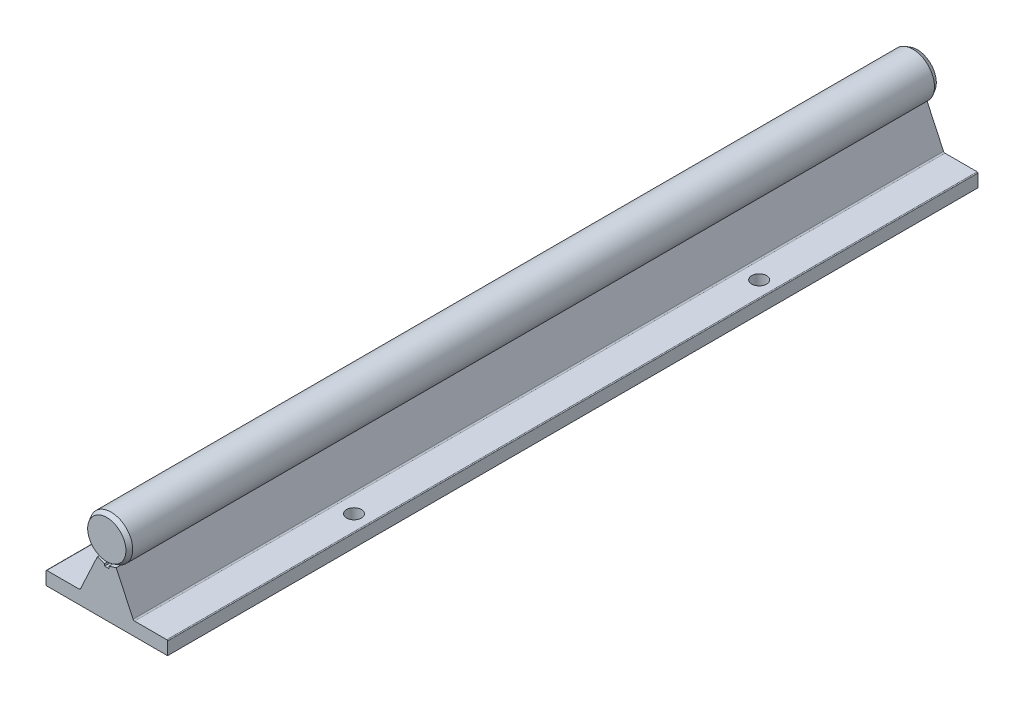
ISO-10303-21;
HEADER;
FILE_DESCRIPTION(('STEP AP214'),'2;1');
FILE_NAME('part.step','',(''),(''),'','','');
FILE_SCHEMA(('AUTOMOTIVE_DESIGN { 1 0 10303 214 1 1 1 1 }'));
ENDSEC;
DATA;
#1=APPLICATION_CONTEXT('core data for automotive mechanical design processes');
#2=APPLICATION_PROTOCOL_DEFINITION('international standard','automotive_design',2000,#1);
#3=PRODUCT_CONTEXT('',#1,'mechanical');
#4=PRODUCT('Part','Part','',(#3));
#5=PRODUCT_RELATED_PRODUCT_CATEGORY('part','',(#4));
#6=PRODUCT_DEFINITION_FORMATION('','',#4);
#7=PRODUCT_DEFINITION_CONTEXT('part definition',#1,'design');
#8=PRODUCT_DEFINITION('design','',#6,#7);
#9=PRODUCT_DEFINITION_SHAPE('','',#8);
#10=(LENGTH_UNIT() NAMED_UNIT(*) SI_UNIT(.MILLI.,.METRE.));
#11=(NAMED_UNIT(*) PLANE_ANGLE_UNIT() SI_UNIT($,.RADIAN.));
#12=(NAMED_UNIT(*) SI_UNIT($,.STERADIAN.) SOLID_ANGLE_UNIT());
#13=UNCERTAINTY_MEASURE_WITH_UNIT(LENGTH_MEASURE(1.E-05),#10,'distance_accuracy_value','');
#14=(GEOMETRIC_REPRESENTATION_CONTEXT(3) GLOBAL_UNCERTAINTY_ASSIGNED_CONTEXT((#13)) GLOBAL_UNIT_ASSIGNED_CONTEXT((#10,
#11,#12)) REPRESENTATION_CONTEXT('',''));
#15=CARTESIAN_POINT('',(0.,0.,0.));
#16=DIRECTION('',(0.,0.,1.));
#17=DIRECTION('',(1.,0.,0.));
#18=AXIS2_PLACEMENT_3D('',#15,#16,#17);
#19=CARTESIAN_POINT('',(0.,22.7,-75.));
#20=DIRECTION('',(0.,-1.,0.));
#21=DIRECTION('',(0.546944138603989,0.,-0.837169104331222));
#22=AXIS2_PLACEMENT_3D('',#19,#20,#21);
#23=CONICAL_SURFACE('',#22,1.80717967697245,1.0471975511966);
#24=CARTESIAN_POINT('',(0.,22.3,-75.));
#25=DIRECTION('',(0.,-1.,0.));
#26=DIRECTION('',(0.546944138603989,0.,-0.837169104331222));
#27=AXIS2_PLACEMENT_3D('',#24,#25,#26);
#28=CIRCLE('',#27,2.5);
#29=CARTESIAN_POINT('',(1.36736034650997,22.3,-77.0929227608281));
#30=VERTEX_POINT('',#29);
#31=EDGE_CURVE('P0_E395',#30,#30,#28,.T.);
#32=ORIENTED_EDGE('',*,*,#31,.F.);
#33=EDGE_LOOP('',(#32));
#34=FACE_BOUND('',#33,.T.);
#35=CARTESIAN_POINT('',(0.,22.7,-75.));
#36=DIRECTION('',(0.,-1.,0.));
#37=DIRECTION('',(0.546944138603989,0.,-0.837169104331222));
#38=AXIS2_PLACEMENT_3D('',#35,#36,#37);
#39=CIRCLE('',#38,1.80717967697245);
#40=CARTESIAN_POINT('',(0.98842633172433,22.7,-76.5129149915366));
#41=VERTEX_POINT('',#40);
#42=EDGE_CURVE('P0_E398',#41,#41,#39,.T.);
#43=ORIENTED_EDGE('',*,*,#42,.T.);
#44=EDGE_LOOP('',(#43));
#45=FACE_BOUND('',#44,.T.);
#46=ADVANCED_FACE('P0_F16',(#34,#45),#23,.T.);
#47=CARTESIAN_POINT('',(0.,23.1,-75.));
#48=DIRECTION('',(0.,1.,0.));
#49=DIRECTION('',(-0.546944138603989,0.,0.837169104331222));
#50=AXIS2_PLACEMENT_3D('',#47,#48,#49);
#51=CONICAL_SURFACE('',#50,2.5,1.0471975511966);
#52=ORIENTED_EDGE('',*,*,#42,.F.);
#53=EDGE_LOOP('',(#52));
#54=FACE_BOUND('',#53,.T.);
#55=CARTESIAN_POINT('',(0.,23.1,-75.));
#56=DIRECTION('',(0.,-1.,0.));
#57=DIRECTION('',(0.546944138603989,0.,-0.837169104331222));
#58=AXIS2_PLACEMENT_3D('',#55,#56,#57);
#59=CIRCLE('',#58,2.5);
#60=CARTESIAN_POINT('',(1.36736034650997,23.1,-77.0929227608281));
#61=VERTEX_POINT('',#60);
#62=EDGE_CURVE('P0_E401',#61,#61,#59,.T.);
#63=ORIENTED_EDGE('',*,*,#62,.T.);
#64=EDGE_LOOP('',(#63));
#65=FACE_BOUND('',#64,.T.);
#66=ADVANCED_FACE('P0_F217',(#54,#65),#51,.T.);
#67=CARTESIAN_POINT('',(0.,25.5,-75.));
#68=DIRECTION('',(0.,-1.,0.));
#69=DIRECTION('',(0.546944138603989,0.,-0.837169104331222));
#70=AXIS2_PLACEMENT_3D('',#67,#68,#69);
#71=PLANE('',#70);
#72=CARTESIAN_POINT('',(0.,25.5,-75.));
#73=DIRECTION('',(0.,-1.,0.));
#74=DIRECTION('',(0.546944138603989,0.,-0.837169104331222));
#75=AXIS2_PLACEMENT_3D('',#72,#73,#74);
#76=CIRCLE('',#75,1.7);
#77=CARTESIAN_POINT('',(0.929805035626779,25.5,-76.4231874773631));
#78=VERTEX_POINT('',#77);
#79=EDGE_CURVE('P0_E455',#78,#78,#76,.F.);
#80=ORIENTED_EDGE('',*,*,#79,.T.);
#81=EDGE_LOOP('',(#80));
#82=FACE_BOUND('',#81,.T.);
#83=ADVANCED_FACE('P0_F214',(#82),#71,.F.);
#84=CARTESIAN_POINT('',(0.,24.7,-75.));
#85=DIRECTION('',(0.,-1.,0.));
#86=DIRECTION('',(0.546944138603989,0.,-0.837169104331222));
#87=AXIS2_PLACEMENT_3D('',#84,#85,#86);
#88=CONICAL_SURFACE('',#87,2.5,0.785398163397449);
#89=CARTESIAN_POINT('',(0.,25.2071796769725,-75.));
#90=DIRECTION('',(0.,1.,0.));
#91=DIRECTION('',(-0.546944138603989,0.,0.837169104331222));
#92=AXIS2_PLACEMENT_3D('',#89,#90,#91);
#93=CIRCLE('',#92,1.99282032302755);
#94=CARTESIAN_POINT('',(-1.08996139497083,25.2071796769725,-73.331672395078));
#95=VERTEX_POINT('',#94);
#96=EDGE_CURVE('P0_E419',#95,#95,#93,.F.);
#97=ORIENTED_EDGE('',*,*,#96,.F.);
#98=EDGE_LOOP('',(#97));
#99=FACE_BOUND('',#98,.T.);
#100=ORIENTED_EDGE('',*,*,#79,.F.);
#101=EDGE_LOOP('',(#100));
#102=FACE_BOUND('',#101,.T.);
#103=ADVANCED_FACE('P0_F18',(#99,#102),#88,.T.);
#104=CARTESIAN_POINT('',(0.,25.5,-75.));
#105=DIRECTION('',(0.,1.,0.));
#106=DIRECTION('',(-0.546944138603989,0.,0.837169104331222));
#107=AXIS2_PLACEMENT_3D('',#104,#105,#106);
#108=CONICAL_SURFACE('',#107,2.5,1.0471975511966);
#109=ORIENTED_EDGE('',*,*,#96,.T.);
#110=EDGE_LOOP('',(#109));
#111=FACE_BOUND('',#110,.T.);
#112=CARTESIAN_POINT('',(0.,25.1,-75.));
#113=DIRECTION('',(0.,-1.,0.));
#114=DIRECTION('',(0.546944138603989,0.,-0.837169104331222));
#115=AXIS2_PLACEMENT_3D('',#112,#113,#114);
#116=CIRCLE('',#115,1.80717967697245);
#117=CARTESIAN_POINT('',(0.98842633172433,25.1,-76.5129149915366));
#118=VERTEX_POINT('',#117);
#119=EDGE_CURVE('P0_E416',#118,#118,#116,.T.);
#120=ORIENTED_EDGE('',*,*,#119,.F.);
#121=EDGE_LOOP('',(#120));
#122=FACE_BOUND('',#121,.T.);
#123=ADVANCED_FACE('P0_F258',(#111,#122),#108,.T.);
#124=CARTESIAN_POINT('',(0.,25.1,-75.));
#125=DIRECTION('',(0.,-1.,0.));
#126=DIRECTION('',(0.546944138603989,0.,-0.837169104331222));
#127=AXIS2_PLACEMENT_3D('',#124,#125,#126);
#128=CONICAL_SURFACE('',#127,1.80717967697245,1.0471975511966);
#129=CARTESIAN_POINT('',(0.,24.7,-75.));
#130=DIRECTION('',(0.,-1.,0.));
#131=DIRECTION('',(0.546944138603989,0.,-0.837169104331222));
#132=AXIS2_PLACEMENT_3D('',#129,#130,#131);
#133=CIRCLE('',#132,2.5);
#134=CARTESIAN_POINT('',(1.36736034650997,24.7,-77.0929227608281));
#135=VERTEX_POINT('',#134);
#136=EDGE_CURVE('P0_E413',#135,#135,#133,.T.);
#137=ORIENTED_EDGE('',*,*,#136,.F.);
#138=EDGE_LOOP('',(#137));
#139=FACE_BOUND('',#138,.T.);
#140=ORIENTED_EDGE('',*,*,#119,.T.);
#141=EDGE_LOOP('',(#140));
#142=FACE_BOUND('',#141,.T.);
#143=ADVANCED_FACE('P0_F253',(#139,#142),#128,.T.);
#144=CARTESIAN_POINT('',(0.,24.7,-75.));
#145=DIRECTION('',(0.,1.,0.));
#146=DIRECTION('',(-0.546944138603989,0.,0.837169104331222));
#147=AXIS2_PLACEMENT_3D('',#144,#145,#146);
#148=CONICAL_SURFACE('',#147,2.5,1.0471975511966);
#149=CARTESIAN_POINT('',(0.,24.3,-75.));
#150=DIRECTION('',(0.,-1.,0.));
#151=DIRECTION('',(0.546944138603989,0.,-0.837169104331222));
#152=AXIS2_PLACEMENT_3D('',#149,#150,#151);
#153=CIRCLE('',#152,1.80717967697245);
#154=CARTESIAN_POINT('',(0.98842633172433,24.3,-76.5129149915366));
#155=VERTEX_POINT('',#154);
#156=EDGE_CURVE('P0_E410',#155,#155,#153,.T.);
#157=ORIENTED_EDGE('',*,*,#156,.F.);
#158=EDGE_LOOP('',(#157));
#159=FACE_BOUND('',#158,.T.);
#160=ORIENTED_EDGE('',*,*,#136,.T.);
#161=EDGE_LOOP('',(#160));
#162=FACE_BOUND('',#161,.T.);
#163=ADVANCED_FACE('P0_F250',(#159,#162),#148,.T.);
#164=CARTESIAN_POINT('',(0.,24.3,-75.));
#165=DIRECTION('',(0.,-1.,0.));
#166=DIRECTION('',(0.546944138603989,0.,-0.837169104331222));
#167=AXIS2_PLACEMENT_3D('',#164,#165,#166);
#168=CONICAL_SURFACE('',#167,1.80717967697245,1.0471975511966);
#169=CARTESIAN_POINT('',(0.,23.9,-75.));
#170=DIRECTION('',(0.,-1.,0.));
#171=DIRECTION('',(0.546944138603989,0.,-0.837169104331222));
#172=AXIS2_PLACEMENT_3D('',#169,#170,#171);
#173=CIRCLE('',#172,2.5);
#174=CARTESIAN_POINT('',(1.36736034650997,23.9,-77.0929227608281));
#175=VERTEX_POINT('',#174);
#176=EDGE_CURVE('P0_E407',#175,#175,#173,.T.);
#177=ORIENTED_EDGE('',*,*,#176,.F.);
#178=EDGE_LOOP('',(#177));
#179=FACE_BOUND('',#178,.T.);
#180=ORIENTED_EDGE('',*,*,#156,.T.);
#181=EDGE_LOOP('',(#180));
#182=FACE_BOUND('',#181,.T.);
#183=ADVANCED_FACE('P0_F244',(#179,#182),#168,.T.);
#184=CARTESIAN_POINT('',(0.,23.9,-75.));
#185=DIRECTION('',(0.,1.,0.));
#186=DIRECTION('',(-0.546944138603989,0.,0.837169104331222));
#187=AXIS2_PLACEMENT_3D('',#184,#185,#186);
#188=CONICAL_SURFACE('',#187,2.5,1.0471975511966);
#189=CARTESIAN_POINT('',(0.,23.5,-75.));
#190=DIRECTION('',(0.,-1.,0.));
#191=DIRECTION('',(0.546944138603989,0.,-0.837169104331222));
#192=AXIS2_PLACEMENT_3D('',#189,#190,#191);
#193=CIRCLE('',#192,1.80717967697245);
#194=CARTESIAN_POINT('',(0.98842633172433,23.5,-76.5129149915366));
#195=VERTEX_POINT('',#194);
#196=EDGE_CURVE('P0_E404',#195,#195,#193,.T.);
#197=ORIENTED_EDGE('',*,*,#196,.F.);
#198=EDGE_LOOP('',(#197));
#199=FACE_BOUND('',#198,.T.);
#200=ORIENTED_EDGE('',*,*,#176,.T.);
#201=EDGE_LOOP('',(#200));
#202=FACE_BOUND('',#201,.T.);
#203=ADVANCED_FACE('P0_F240',(#199,#202),#188,.T.);
#204=CARTESIAN_POINT('',(0.,23.5,-75.));
#205=DIRECTION('',(0.,-1.,0.));
#206=DIRECTION('',(0.546944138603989,0.,-0.837169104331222));
#207=AXIS2_PLACEMENT_3D('',#204,#205,#206);
#208=CONICAL_SURFACE('',#207,1.80717967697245,1.0471975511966);
#209=ORIENTED_EDGE('',*,*,#62,.F.);
#210=EDGE_LOOP('',(#209));
#211=FACE_BOUND('',#210,.T.);
#212=ORIENTED_EDGE('',*,*,#196,.T.);
#213=EDGE_LOOP('',(#212));
#214=FACE_BOUND('',#213,.T.);
#215=ADVANCED_FACE('P0_F243',(#211,#214),#208,.T.);
#216=CARTESIAN_POINT('',(0.,21.9,-75.));
#217=DIRECTION('',(0.,-1.,0.));
#218=DIRECTION('',(0.546944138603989,0.,-0.837169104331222));
#219=AXIS2_PLACEMENT_3D('',#216,#217,#218);
#220=CONICAL_SURFACE('',#219,1.80717967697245,1.0471975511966);
#221=CARTESIAN_POINT('',(0.,21.5,-75.));
#222=DIRECTION('',(0.,-1.,0.));
#223=DIRECTION('',(0.546944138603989,0.,-0.837169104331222));
#224=AXIS2_PLACEMENT_3D('',#221,#222,#223);
#225=CIRCLE('',#224,2.5);
#226=CARTESIAN_POINT('',(1.36736034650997,21.5,-77.0929227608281));
#227=VERTEX_POINT('',#226);
#228=EDGE_CURVE('P0_E389',#227,#227,#225,.T.);
#229=ORIENTED_EDGE('',*,*,#228,.F.);
#230=EDGE_LOOP('',(#229));
#231=FACE_BOUND('',#230,.T.);
#232=CARTESIAN_POINT('',(0.,21.9,-75.));
#233=DIRECTION('',(0.,-1.,0.));
#234=DIRECTION('',(0.546944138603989,0.,-0.837169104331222));
#235=AXIS2_PLACEMENT_3D('',#232,#233,#234);
#236=CIRCLE('',#235,1.80717967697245);
#237=CARTESIAN_POINT('',(0.98842633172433,21.9,-76.5129149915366));
#238=VERTEX_POINT('',#237);
#239=EDGE_CURVE('P0_E392',#238,#238,#236,.T.);
#240=ORIENTED_EDGE('',*,*,#239,.T.);
#241=EDGE_LOOP('',(#240));
#242=FACE_BOUND('',#241,.T.);
#243=ADVANCED_FACE('P0_F248',(#231,#242),#220,.T.);
#244=CARTESIAN_POINT('',(0.,22.3,-75.));
#245=DIRECTION('',(0.,1.,0.));
#246=DIRECTION('',(-0.546944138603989,0.,0.837169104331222));
#247=AXIS2_PLACEMENT_3D('',#244,#245,#246);
#248=CONICAL_SURFACE('',#247,2.5,1.0471975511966);
#249=ORIENTED_EDGE('',*,*,#239,.F.);
#250=EDGE_LOOP('',(#249));
#251=FACE_BOUND('',#250,.T.);
#252=ORIENTED_EDGE('',*,*,#31,.T.);
#253=EDGE_LOOP('',(#252));
#254=FACE_BOUND('',#253,.T.);
#255=ADVANCED_FACE('P0_F503',(#251,#254),#248,.T.);
#256=CARTESIAN_POINT('',(0.,21.1,-75.));
#257=DIRECTION('',(0.,-1.,0.));
#258=DIRECTION('',(0.546944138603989,0.,-0.837169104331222));
#259=AXIS2_PLACEMENT_3D('',#256,#257,#258);
#260=CONICAL_SURFACE('',#259,1.80717967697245,1.0471975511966);
#261=CARTESIAN_POINT('',(0.,20.7,-75.));
#262=DIRECTION('',(0.,-1.,0.));
#263=DIRECTION('',(0.546944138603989,0.,-0.837169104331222));
#264=AXIS2_PLACEMENT_3D('',#261,#262,#263);
#265=CIRCLE('',#264,2.5);
#266=CARTESIAN_POINT('',(1.36736034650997,20.7,-77.0929227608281));
#267=VERTEX_POINT('',#266);
#268=EDGE_CURVE('P0_E383',#267,#267,#265,.T.);
#269=ORIENTED_EDGE('',*,*,#268,.F.);
#270=EDGE_LOOP('',(#269));
#271=FACE_BOUND('',#270,.T.);
#272=CARTESIAN_POINT('',(0.,21.1,-75.));
#273=DIRECTION('',(0.,-1.,0.));
#274=DIRECTION('',(0.546944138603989,0.,-0.837169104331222));
#275=AXIS2_PLACEMENT_3D('',#272,#273,#274);
#276=CIRCLE('',#275,1.80717967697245);
#277=CARTESIAN_POINT('',(0.98842633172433,21.1,-76.5129149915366));
#278=VERTEX_POINT('',#277);
#279=EDGE_CURVE('P0_E386',#278,#278,#276,.T.);
#280=ORIENTED_EDGE('',*,*,#279,.T.);
#281=EDGE_LOOP('',(#280));
#282=FACE_BOUND('',#281,.T.);
#283=ADVANCED_FACE('P0_F510',(#271,#282),#260,.T.);
#284=CARTESIAN_POINT('',(0.,21.5,-75.));
#285=DIRECTION('',(0.,1.,0.));
#286=DIRECTION('',(-0.546944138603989,0.,0.837169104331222));
#287=AXIS2_PLACEMENT_3D('',#284,#285,#286);
#288=CONICAL_SURFACE('',#287,2.5,1.0471975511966);
#289=ORIENTED_EDGE('',*,*,#279,.F.);
#290=EDGE_LOOP('',(#289));
#291=FACE_BOUND('',#290,.T.);
#292=ORIENTED_EDGE('',*,*,#228,.T.);
#293=EDGE_LOOP('',(#292));
#294=FACE_BOUND('',#293,.T.);
#295=ADVANCED_FACE('P0_F518',(#291,#294),#288,.T.);
#296=CARTESIAN_POINT('',(0.,20.3,-75.));
#297=DIRECTION('',(0.,-1.,0.));
#298=DIRECTION('',(0.546944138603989,0.,-0.837169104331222));
#299=AXIS2_PLACEMENT_3D('',#296,#297,#298);
#300=CONICAL_SURFACE('',#299,1.80717967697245,1.0471975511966);
#301=CARTESIAN_POINT('',(0.,19.9,-75.));
#302=DIRECTION('',(0.,-1.,0.));
#303=DIRECTION('',(0.546944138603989,0.,-0.837169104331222));
#304=AXIS2_PLACEMENT_3D('',#301,#302,#303);
#305=CIRCLE('',#304,2.5);
#306=CARTESIAN_POINT('',(1.36736034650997,19.9,-77.0929227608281));
#307=VERTEX_POINT('',#306);
#308=EDGE_CURVE('P0_E377',#307,#307,#305,.T.);
#309=ORIENTED_EDGE('',*,*,#308,.F.);
#310=EDGE_LOOP('',(#309));
#311=FACE_BOUND('',#310,.T.);
#312=CARTESIAN_POINT('',(0.,20.3,-75.));
#313=DIRECTION('',(0.,-1.,0.));
#314=DIRECTION('',(0.546944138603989,0.,-0.837169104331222));
#315=AXIS2_PLACEMENT_3D('',#312,#313,#314);
#316=CIRCLE('',#315,1.80717967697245);
#317=CARTESIAN_POINT('',(0.98842633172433,20.3,-76.5129149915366));
#318=VERTEX_POINT('',#317);
#319=EDGE_CURVE('P0_E380',#318,#318,#316,.T.);
#320=ORIENTED_EDGE('',*,*,#319,.T.);
#321=EDGE_LOOP('',(#320));
#322=FACE_BOUND('',#321,.T.);
#323=ADVANCED_FACE('P0_F526',(#311,#322),#300,.T.);
#324=CARTESIAN_POINT('',(0.,20.7,-75.));
#325=DIRECTION('',(0.,1.,0.));
#326=DIRECTION('',(-0.546944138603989,0.,0.837169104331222));
#327=AXIS2_PLACEMENT_3D('',#324,#325,#326);
#328=CONICAL_SURFACE('',#327,2.5,1.0471975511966);
#329=ORIENTED_EDGE('',*,*,#319,.F.);
#330=EDGE_LOOP('',(#329));
#331=FACE_BOUND('',#330,.T.);
#332=ORIENTED_EDGE('',*,*,#268,.T.);
#333=EDGE_LOOP('',(#332));
#334=FACE_BOUND('',#333,.T.);
#335=ADVANCED_FACE('P0_F534',(#331,#334),#328,.T.);
#336=CARTESIAN_POINT('',(0.,19.5,-75.));
#337=DIRECTION('',(0.,-1.,0.));
#338=DIRECTION('',(0.546944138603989,0.,-0.837169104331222));
#339=AXIS2_PLACEMENT_3D('',#336,#337,#338);
#340=CONICAL_SURFACE('',#339,1.80717967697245,1.0471975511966);
#341=CARTESIAN_POINT('',(0.,19.1,-75.));
#342=DIRECTION('',(0.,-1.,0.));
#343=DIRECTION('',(0.546944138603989,0.,-0.837169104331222));
#344=AXIS2_PLACEMENT_3D('',#341,#342,#343);
#345=CIRCLE('',#344,2.5);
#346=CARTESIAN_POINT('',(1.36736034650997,19.1,-77.0929227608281));
#347=VERTEX_POINT('',#346);
#348=EDGE_CURVE('P0_E371',#347,#347,#345,.T.);
#349=ORIENTED_EDGE('',*,*,#348,.F.);
#350=EDGE_LOOP('',(#349));
#351=FACE_BOUND('',#350,.T.);
#352=CARTESIAN_POINT('',(0.,19.5,-75.));
#353=DIRECTION('',(0.,-1.,0.));
#354=DIRECTION('',(0.546944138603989,0.,-0.837169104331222));
#355=AXIS2_PLACEMENT_3D('',#352,#353,#354);
#356=CIRCLE('',#355,1.80717967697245);
#357=CARTESIAN_POINT('',(0.98842633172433,19.5,-76.5129149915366));
#358=VERTEX_POINT('',#357);
#359=EDGE_CURVE('P0_E374',#358,#358,#356,.T.);
#360=ORIENTED_EDGE('',*,*,#359,.T.);
#361=EDGE_LOOP('',(#360));
#362=FACE_BOUND('',#361,.T.);
#363=ADVANCED_FACE('P0_F542',(#351,#362),#340,.T.);
#364=CARTESIAN_POINT('',(0.,19.9,-75.));
#365=DIRECTION('',(0.,1.,0.));
#366=DIRECTION('',(-0.546944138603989,0.,0.837169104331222));
#367=AXIS2_PLACEMENT_3D('',#364,#365,#366);
#368=CONICAL_SURFACE('',#367,2.5,1.0471975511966);
#369=ORIENTED_EDGE('',*,*,#359,.F.);
#370=EDGE_LOOP('',(#369));
#371=FACE_BOUND('',#370,.T.);
#372=ORIENTED_EDGE('',*,*,#308,.T.);
#373=EDGE_LOOP('',(#372));
#374=FACE_BOUND('',#373,.T.);
#375=ADVANCED_FACE('P0_F550',(#371,#374),#368,.T.);
#376=CARTESIAN_POINT('',(0.,18.7,-75.));
#377=DIRECTION('',(0.,-1.,0.));
#378=DIRECTION('',(0.546944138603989,0.,-0.837169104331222));
#379=AXIS2_PLACEMENT_3D('',#376,#377,#378);
#380=CONICAL_SURFACE('',#379,1.80717967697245,1.0471975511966);
#381=CARTESIAN_POINT('',(0.,18.3,-75.));
#382=DIRECTION('',(0.,-1.,0.));
#383=DIRECTION('',(0.546944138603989,0.,-0.837169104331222));
#384=AXIS2_PLACEMENT_3D('',#381,#382,#383);
#385=CIRCLE('',#384,2.5);
#386=CARTESIAN_POINT('',(1.36736034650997,18.3,-77.0929227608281));
#387=VERTEX_POINT('',#386);
#388=EDGE_CURVE('P0_E365',#387,#387,#385,.T.);
#389=ORIENTED_EDGE('',*,*,#388,.F.);
#390=EDGE_LOOP('',(#389));
#391=FACE_BOUND('',#390,.T.);
#392=CARTESIAN_POINT('',(0.,18.7,-75.));
#393=DIRECTION('',(0.,-1.,0.));
#394=DIRECTION('',(0.546944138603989,0.,-0.837169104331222));
#395=AXIS2_PLACEMENT_3D('',#392,#393,#394);
#396=CIRCLE('',#395,1.80717967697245);
#397=CARTESIAN_POINT('',(0.98842633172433,18.7,-76.5129149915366));
#398=VERTEX_POINT('',#397);
#399=EDGE_CURVE('P0_E368',#398,#398,#396,.T.);
#400=ORIENTED_EDGE('',*,*,#399,.T.);
#401=EDGE_LOOP('',(#400));
#402=FACE_BOUND('',#401,.T.);
#403=ADVANCED_FACE('P0_F558',(#391,#402),#380,.T.);
#404=CARTESIAN_POINT('',(0.,19.1,-75.));
#405=DIRECTION('',(0.,1.,0.));
#406=DIRECTION('',(-0.546944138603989,0.,0.837169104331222));
#407=AXIS2_PLACEMENT_3D('',#404,#405,#406);
#408=CONICAL_SURFACE('',#407,2.5,1.0471975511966);
#409=ORIENTED_EDGE('',*,*,#399,.F.);
#410=EDGE_LOOP('',(#409));
#411=FACE_BOUND('',#410,.T.);
#412=ORIENTED_EDGE('',*,*,#348,.T.);
#413=EDGE_LOOP('',(#412));
#414=FACE_BOUND('',#413,.T.);
#415=ADVANCED_FACE('P0_F566',(#411,#414),#408,.T.);
#416=CARTESIAN_POINT('',(0.,17.9,-75.));
#417=DIRECTION('',(0.,-1.,0.));
#418=DIRECTION('',(0.546944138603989,0.,-0.837169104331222));
#419=AXIS2_PLACEMENT_3D('',#416,#417,#418);
#420=CONICAL_SURFACE('',#419,1.80717967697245,1.0471975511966);
#421=CARTESIAN_POINT('',(0.,17.5,-75.));
#422=DIRECTION('',(0.,-1.,0.));
#423=DIRECTION('',(0.546944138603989,0.,-0.837169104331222));
#424=AXIS2_PLACEMENT_3D('',#421,#422,#423);
#425=CIRCLE('',#424,2.5);
#426=CARTESIAN_POINT('',(1.36736034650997,17.5,-77.0929227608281));
#427=VERTEX_POINT('',#426);
#428=EDGE_CURVE('P0_E359',#427,#427,#425,.T.);
#429=ORIENTED_EDGE('',*,*,#428,.F.);
#430=EDGE_LOOP('',(#429));
#431=FACE_BOUND('',#430,.T.);
#432=CARTESIAN_POINT('',(0.,17.9,-75.));
#433=DIRECTION('',(0.,-1.,0.));
#434=DIRECTION('',(0.546944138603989,0.,-0.837169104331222));
#435=AXIS2_PLACEMENT_3D('',#432,#433,#434);
#436=CIRCLE('',#435,1.80717967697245);
#437=CARTESIAN_POINT('',(0.98842633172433,17.9,-76.5129149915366));
#438=VERTEX_POINT('',#437);
#439=EDGE_CURVE('P0_E362',#438,#438,#436,.T.);
#440=ORIENTED_EDGE('',*,*,#439,.T.);
#441=EDGE_LOOP('',(#440));
#442=FACE_BOUND('',#441,.T.);
#443=ADVANCED_FACE('P0_F574',(#431,#442),#420,.T.);
#444=CARTESIAN_POINT('',(0.,18.3,-75.));
#445=DIRECTION('',(0.,1.,0.));
#446=DIRECTION('',(-0.546944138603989,0.,0.837169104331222));
#447=AXIS2_PLACEMENT_3D('',#444,#445,#446);
#448=CONICAL_SURFACE('',#447,2.5,1.0471975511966);
#449=ORIENTED_EDGE('',*,*,#439,.F.);
#450=EDGE_LOOP('',(#449));
#451=FACE_BOUND('',#450,.T.);
#452=ORIENTED_EDGE('',*,*,#388,.T.);
#453=EDGE_LOOP('',(#452));
#454=FACE_BOUND('',#453,.T.);
#455=ADVANCED_FACE('P0_F582',(#451,#454),#448,.T.);
#456=CARTESIAN_POINT('',(0.,17.1,-75.));
#457=DIRECTION('',(0.,-1.,0.));
#458=DIRECTION('',(0.546944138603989,0.,-0.837169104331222));
#459=AXIS2_PLACEMENT_3D('',#456,#457,#458);
#460=CONICAL_SURFACE('',#459,1.80717967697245,1.0471975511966);
#461=CARTESIAN_POINT('',(0.,16.7,-75.));
#462=DIRECTION('',(0.,-1.,0.));
#463=DIRECTION('',(0.546944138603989,0.,-0.837169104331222));
#464=AXIS2_PLACEMENT_3D('',#461,#462,#463);
#465=CIRCLE('',#464,2.5);
#466=CARTESIAN_POINT('',(1.36736034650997,16.7,-77.0929227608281));
#467=VERTEX_POINT('',#466);
#468=EDGE_CURVE('P0_E353',#467,#467,#465,.T.);
#469=ORIENTED_EDGE('',*,*,#468,.F.);
#470=EDGE_LOOP('',(#469));
#471=FACE_BOUND('',#470,.T.);
#472=CARTESIAN_POINT('',(0.,17.1,-75.));
#473=DIRECTION('',(0.,-1.,0.));
#474=DIRECTION('',(0.546944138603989,0.,-0.837169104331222));
#475=AXIS2_PLACEMENT_3D('',#472,#473,#474);
#476=CIRCLE('',#475,1.80717967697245);
#477=CARTESIAN_POINT('',(0.98842633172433,17.1,-76.5129149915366));
#478=VERTEX_POINT('',#477);
#479=EDGE_CURVE('P0_E356',#478,#478,#476,.T.);
#480=ORIENTED_EDGE('',*,*,#479,.T.);
#481=EDGE_LOOP('',(#480));
#482=FACE_BOUND('',#481,.T.);
#483=ADVANCED_FACE('P0_F590',(#471,#482),#460,.T.);
#484=CARTESIAN_POINT('',(0.,17.5,-75.));
#485=DIRECTION('',(0.,1.,0.));
#486=DIRECTION('',(-0.546944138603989,0.,0.837169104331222));
#487=AXIS2_PLACEMENT_3D('',#484,#485,#486);
#488=CONICAL_SURFACE('',#487,2.5,1.0471975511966);
#489=ORIENTED_EDGE('',*,*,#479,.F.);
#490=EDGE_LOOP('',(#489));
#491=FACE_BOUND('',#490,.T.);
#492=ORIENTED_EDGE('',*,*,#428,.T.);
#493=EDGE_LOOP('',(#492));
#494=FACE_BOUND('',#493,.T.);
#495=ADVANCED_FACE('P0_F598',(#491,#494),#488,.T.);
#496=CARTESIAN_POINT('',(0.,16.3,-75.));
#497=DIRECTION('',(0.,-1.,0.));
#498=DIRECTION('',(0.546944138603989,0.,-0.837169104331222));
#499=AXIS2_PLACEMENT_3D('',#496,#497,#498);
#500=CONICAL_SURFACE('',#499,1.80717967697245,1.0471975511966);
#501=CARTESIAN_POINT('',(0.,15.9,-75.));
#502=DIRECTION('',(0.,-1.,0.));
#503=DIRECTION('',(0.546944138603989,0.,-0.837169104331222));
#504=AXIS2_PLACEMENT_3D('',#501,#502,#503);
#505=CIRCLE('',#504,2.5);
#506=CARTESIAN_POINT('',(1.36736034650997,15.9,-77.0929227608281));
#507=VERTEX_POINT('',#506);
#508=EDGE_CURVE('P0_E347',#507,#507,#505,.T.);
#509=ORIENTED_EDGE('',*,*,#508,.F.);
#510=EDGE_LOOP('',(#509));
#511=FACE_BOUND('',#510,.T.);
#512=CARTESIAN_POINT('',(0.,16.3,-75.));
#513=DIRECTION('',(0.,-1.,0.));
#514=DIRECTION('',(0.546944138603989,0.,-0.837169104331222));
#515=AXIS2_PLACEMENT_3D('',#512,#513,#514);
#516=CIRCLE('',#515,1.80717967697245);
#517=CARTESIAN_POINT('',(0.98842633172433,16.3,-76.5129149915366));
#518=VERTEX_POINT('',#517);
#519=EDGE_CURVE('P0_E350',#518,#518,#516,.T.);
#520=ORIENTED_EDGE('',*,*,#519,.T.);
#521=EDGE_LOOP('',(#520));
#522=FACE_BOUND('',#521,.T.);
#523=ADVANCED_FACE('P0_F606',(#511,#522),#500,.T.);
#524=CARTESIAN_POINT('',(0.,16.7,-75.));
#525=DIRECTION('',(0.,1.,0.));
#526=DIRECTION('',(-0.546944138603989,0.,0.837169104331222));
#527=AXIS2_PLACEMENT_3D('',#524,#525,#526);
#528=CONICAL_SURFACE('',#527,2.5,1.0471975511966);
#529=ORIENTED_EDGE('',*,*,#519,.F.);
#530=EDGE_LOOP('',(#529));
#531=FACE_BOUND('',#530,.T.);
#532=ORIENTED_EDGE('',*,*,#468,.T.);
#533=EDGE_LOOP('',(#532));
#534=FACE_BOUND('',#533,.T.);
#535=ADVANCED_FACE('P0_F614',(#531,#534),#528,.T.);
#536=CARTESIAN_POINT('',(0.,15.5,-75.));
#537=DIRECTION('',(0.,-1.,0.));
#538=DIRECTION('',(0.546944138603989,0.,-0.837169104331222));
#539=AXIS2_PLACEMENT_3D('',#536,#537,#538);
#540=CONICAL_SURFACE('',#539,1.80717967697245,1.0471975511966);
#541=CARTESIAN_POINT('',(0.,15.1,-75.));
#542=DIRECTION('',(0.,-1.,0.));
#543=DIRECTION('',(0.546944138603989,0.,-0.837169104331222));
#544=AXIS2_PLACEMENT_3D('',#541,#542,#543);
#545=CIRCLE('',#544,2.5);
#546=CARTESIAN_POINT('',(1.36736034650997,15.1,-77.0929227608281));
#547=VERTEX_POINT('',#546);
#548=EDGE_CURVE('P0_E341',#547,#547,#545,.T.);
#549=ORIENTED_EDGE('',*,*,#548,.F.);
#550=EDGE_LOOP('',(#549));
#551=FACE_BOUND('',#550,.T.);
#552=CARTESIAN_POINT('',(0.,15.5,-75.));
#553=DIRECTION('',(0.,-1.,0.));
#554=DIRECTION('',(0.546944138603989,0.,-0.837169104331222));
#555=AXIS2_PLACEMENT_3D('',#552,#553,#554);
#556=CIRCLE('',#555,1.80717967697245);
#557=CARTESIAN_POINT('',(0.98842633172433,15.5,-76.5129149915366));
#558=VERTEX_POINT('',#557);
#559=EDGE_CURVE('P0_E344',#558,#558,#556,.T.);
#560=ORIENTED_EDGE('',*,*,#559,.T.);
#561=EDGE_LOOP('',(#560));
#562=FACE_BOUND('',#561,.T.);
#563=ADVANCED_FACE('P0_F622',(#551,#562),#540,.T.);
#564=CARTESIAN_POINT('',(0.,15.9,-75.));
#565=DIRECTION('',(0.,1.,0.));
#566=DIRECTION('',(-0.546944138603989,0.,0.837169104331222));
#567=AXIS2_PLACEMENT_3D('',#564,#565,#566);
#568=CONICAL_SURFACE('',#567,2.5,1.0471975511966);
#569=ORIENTED_EDGE('',*,*,#559,.F.);
#570=EDGE_LOOP('',(#569));
#571=FACE_BOUND('',#570,.T.);
#572=ORIENTED_EDGE('',*,*,#508,.T.);
#573=EDGE_LOOP('',(#572));
#574=FACE_BOUND('',#573,.T.);
#575=ADVANCED_FACE('P0_F630',(#571,#574),#568,.T.);
#576=CARTESIAN_POINT('',(0.,14.7,-75.));
#577=DIRECTION('',(0.,-1.,0.));
#578=DIRECTION('',(0.546944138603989,0.,-0.837169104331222));
#579=AXIS2_PLACEMENT_3D('',#576,#577,#578);
#580=CONICAL_SURFACE('',#579,1.80717967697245,1.0471975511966);
#581=CARTESIAN_POINT('',(0.,14.3,-75.));
#582=DIRECTION('',(0.,-1.,0.));
#583=DIRECTION('',(0.546944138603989,0.,-0.837169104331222));
#584=AXIS2_PLACEMENT_3D('',#581,#582,#583);
#585=CIRCLE('',#584,2.5);
#586=CARTESIAN_POINT('',(1.36736034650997,14.3,-77.0929227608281));
#587=VERTEX_POINT('',#586);
#588=EDGE_CURVE('P0_E335',#587,#587,#585,.T.);
#589=ORIENTED_EDGE('',*,*,#588,.F.);
#590=EDGE_LOOP('',(#589));
#591=FACE_BOUND('',#590,.T.);
#592=CARTESIAN_POINT('',(0.,14.7,-75.));
#593=DIRECTION('',(0.,-1.,0.));
#594=DIRECTION('',(0.546944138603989,0.,-0.837169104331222));
#595=AXIS2_PLACEMENT_3D('',#592,#593,#594);
#596=CIRCLE('',#595,1.80717967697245);
#597=CARTESIAN_POINT('',(0.98842633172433,14.7,-76.5129149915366));
#598=VERTEX_POINT('',#597);
#599=EDGE_CURVE('P0_E338',#598,#598,#596,.T.);
#600=ORIENTED_EDGE('',*,*,#599,.T.);
#601=EDGE_LOOP('',(#600));
#602=FACE_BOUND('',#601,.T.);
#603=ADVANCED_FACE('P0_F638',(#591,#602),#580,.T.);
#604=CARTESIAN_POINT('',(0.,15.1,-75.));
#605=DIRECTION('',(0.,1.,0.));
#606=DIRECTION('',(-0.546944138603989,0.,0.837169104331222));
#607=AXIS2_PLACEMENT_3D('',#604,#605,#606);
#608=CONICAL_SURFACE('',#607,2.5,1.0471975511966);
#609=ORIENTED_EDGE('',*,*,#599,.F.);
#610=EDGE_LOOP('',(#609));
#611=FACE_BOUND('',#610,.T.);
#612=ORIENTED_EDGE('',*,*,#548,.T.);
#613=EDGE_LOOP('',(#612));
#614=FACE_BOUND('',#613,.T.);
#615=ADVANCED_FACE('P0_F646',(#611,#614),#608,.T.);
#616=CARTESIAN_POINT('',(0.,13.9,-75.));
#617=DIRECTION('',(0.,-1.,0.));
#618=DIRECTION('',(0.546944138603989,0.,-0.837169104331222));
#619=AXIS2_PLACEMENT_3D('',#616,#617,#618);
#620=CONICAL_SURFACE('',#619,1.80717967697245,1.0471975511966);
#621=CARTESIAN_POINT('',(0.,13.5,-75.));
#622=DIRECTION('',(0.,-1.,0.));
#623=DIRECTION('',(0.546944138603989,0.,-0.837169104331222));
#624=AXIS2_PLACEMENT_3D('',#621,#622,#623);
#625=CIRCLE('',#624,2.5);
#626=CARTESIAN_POINT('',(1.36736034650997,13.5,-77.0929227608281));
#627=VERTEX_POINT('',#626);
#628=EDGE_CURVE('P0_E329',#627,#627,#625,.T.);
#629=ORIENTED_EDGE('',*,*,#628,.F.);
#630=EDGE_LOOP('',(#629));
#631=FACE_BOUND('',#630,.T.);
#632=CARTESIAN_POINT('',(0.,13.9,-75.));
#633=DIRECTION('',(0.,-1.,0.));
#634=DIRECTION('',(0.546944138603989,0.,-0.837169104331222));
#635=AXIS2_PLACEMENT_3D('',#632,#633,#634);
#636=CIRCLE('',#635,1.80717967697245);
#637=CARTESIAN_POINT('',(0.98842633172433,13.9,-76.5129149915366));
#638=VERTEX_POINT('',#637);
#639=EDGE_CURVE('P0_E332',#638,#638,#636,.T.);
#640=ORIENTED_EDGE('',*,*,#639,.T.);
#641=EDGE_LOOP('',(#640));
#642=FACE_BOUND('',#641,.T.);
#643=ADVANCED_FACE('P0_F654',(#631,#642),#620,.T.);
#644=CARTESIAN_POINT('',(0.,14.3,-75.));
#645=DIRECTION('',(0.,1.,0.));
#646=DIRECTION('',(-0.546944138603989,0.,0.837169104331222));
#647=AXIS2_PLACEMENT_3D('',#644,#645,#646);
#648=CONICAL_SURFACE('',#647,2.5,1.0471975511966);
#649=ORIENTED_EDGE('',*,*,#639,.F.);
#650=EDGE_LOOP('',(#649));
#651=FACE_BOUND('',#650,.T.);
#652=ORIENTED_EDGE('',*,*,#588,.T.);
#653=EDGE_LOOP('',(#652));
#654=FACE_BOUND('',#653,.T.);
#655=ADVANCED_FACE('P0_F662',(#651,#654),#648,.T.);
#656=CARTESIAN_POINT('',(0.,13.1,-75.));
#657=DIRECTION('',(0.,-1.,0.));
#658=DIRECTION('',(0.546944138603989,0.,-0.837169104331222));
#659=AXIS2_PLACEMENT_3D('',#656,#657,#658);
#660=CONICAL_SURFACE('',#659,1.80717967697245,1.0471975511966);
#661=CARTESIAN_POINT('',(0.,12.7,-75.));
#662=DIRECTION('',(0.,-1.,0.));
#663=DIRECTION('',(0.546944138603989,0.,-0.837169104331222));
#664=AXIS2_PLACEMENT_3D('',#661,#662,#663);
#665=CIRCLE('',#664,2.5);
#666=CARTESIAN_POINT('',(1.36736034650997,12.7,-77.0929227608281));
#667=VERTEX_POINT('',#666);
#668=EDGE_CURVE('P0_E323',#667,#667,#665,.T.);
#669=ORIENTED_EDGE('',*,*,#668,.F.);
#670=EDGE_LOOP('',(#669));
#671=FACE_BOUND('',#670,.T.);
#672=CARTESIAN_POINT('',(0.,13.1,-75.));
#673=DIRECTION('',(0.,-1.,0.));
#674=DIRECTION('',(0.546944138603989,0.,-0.837169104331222));
#675=AXIS2_PLACEMENT_3D('',#672,#673,#674);
#676=CIRCLE('',#675,1.80717967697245);
#677=CARTESIAN_POINT('',(0.98842633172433,13.1,-76.5129149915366));
#678=VERTEX_POINT('',#677);
#679=EDGE_CURVE('P0_E326',#678,#678,#676,.T.);
#680=ORIENTED_EDGE('',*,*,#679,.T.);
#681=EDGE_LOOP('',(#680));
#682=FACE_BOUND('',#681,.T.);
#683=ADVANCED_FACE('P0_F670',(#671,#682),#660,.T.);
#684=CARTESIAN_POINT('',(0.,13.5,-75.));
#685=DIRECTION('',(0.,1.,0.));
#686=DIRECTION('',(-0.546944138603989,0.,0.837169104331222));
#687=AXIS2_PLACEMENT_3D('',#684,#685,#686);
#688=CONICAL_SURFACE('',#687,2.5,1.0471975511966);
#689=ORIENTED_EDGE('',*,*,#679,.F.);
#690=EDGE_LOOP('',(#689));
#691=FACE_BOUND('',#690,.T.);
#692=ORIENTED_EDGE('',*,*,#628,.T.);
#693=EDGE_LOOP('',(#692));
#694=FACE_BOUND('',#693,.T.);
#695=ADVANCED_FACE('P0_F678',(#691,#694),#688,.T.);
#696=CARTESIAN_POINT('',(0.,12.3,-75.));
#697=DIRECTION('',(0.,-1.,0.));
#698=DIRECTION('',(0.546944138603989,0.,-0.837169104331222));
#699=AXIS2_PLACEMENT_3D('',#696,#697,#698);
#700=CONICAL_SURFACE('',#699,1.80717967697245,1.0471975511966);
#701=CARTESIAN_POINT('',(0.,11.9,-75.));
#702=DIRECTION('',(0.,-1.,0.));
#703=DIRECTION('',(0.546944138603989,0.,-0.837169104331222));
#704=AXIS2_PLACEMENT_3D('',#701,#702,#703);
#705=CIRCLE('',#704,2.5);
#706=CARTESIAN_POINT('',(1.36736034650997,11.9,-77.0929227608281));
#707=VERTEX_POINT('',#706);
#708=EDGE_CURVE('P0_E311',#707,#707,#705,.T.);
#709=ORIENTED_EDGE('',*,*,#708,.F.);
#710=EDGE_LOOP('',(#709));
#711=FACE_BOUND('',#710,.T.);
#712=CARTESIAN_POINT('',(0.,12.3,-75.));
#713=DIRECTION('',(0.,-1.,0.));
#714=DIRECTION('',(0.546944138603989,0.,-0.837169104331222));
#715=AXIS2_PLACEMENT_3D('',#712,#713,#714);
#716=CIRCLE('',#715,1.80717967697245);
#717=CARTESIAN_POINT('',(0.98842633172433,12.3,-76.5129149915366));
#718=VERTEX_POINT('',#717);
#719=EDGE_CURVE('P0_E320',#718,#718,#716,.T.);
#720=ORIENTED_EDGE('',*,*,#719,.T.);
#721=EDGE_LOOP('',(#720));
#722=FACE_BOUND('',#721,.T.);
#723=ADVANCED_FACE('P0_F686',(#711,#722),#700,.T.);
#724=CARTESIAN_POINT('',(0.,12.7,-75.));
#725=DIRECTION('',(0.,1.,0.));
#726=DIRECTION('',(-0.546944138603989,0.,0.837169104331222));
#727=AXIS2_PLACEMENT_3D('',#724,#725,#726);
#728=CONICAL_SURFACE('',#727,2.5,1.0471975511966);
#729=ORIENTED_EDGE('',*,*,#719,.F.);
#730=EDGE_LOOP('',(#729));
#731=FACE_BOUND('',#730,.T.);
#732=ORIENTED_EDGE('',*,*,#668,.T.);
#733=EDGE_LOOP('',(#732));
#734=FACE_BOUND('',#733,.T.);
#735=ADVANCED_FACE('P0_F694',(#731,#734),#728,.T.);
#736=CARTESIAN_POINT('',(0.,11.5,-75.));
#737=DIRECTION('',(0.,-1.,0.));
#738=DIRECTION('',(0.546944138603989,0.,-0.837169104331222));
#739=AXIS2_PLACEMENT_3D('',#736,#737,#738);
#740=CONICAL_SURFACE('',#739,1.80717967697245,1.0471975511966);
#741=CARTESIAN_POINT('',(0.,11.1,-75.));
#742=DIRECTION('',(0.,-1.,0.));
#743=DIRECTION('',(0.546944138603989,0.,-0.837169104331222));
#744=AXIS2_PLACEMENT_3D('',#741,#742,#743);
#745=CIRCLE('',#744,2.5);
#746=CARTESIAN_POINT('',(1.36736034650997,11.1,-77.0929227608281));
#747=VERTEX_POINT('',#746);
#748=EDGE_CURVE('P0_E315',#747,#747,#745,.T.);
#749=ORIENTED_EDGE('',*,*,#748,.F.);
#750=EDGE_LOOP('',(#749));
#751=FACE_BOUND('',#750,.T.);
#752=CARTESIAN_POINT('',(0.,11.5,-75.));
#753=DIRECTION('',(0.,-1.,0.));
#754=DIRECTION('',(0.546944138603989,0.,-0.837169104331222));
#755=AXIS2_PLACEMENT_3D('',#752,#753,#754);
#756=CIRCLE('',#755,1.80717967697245);
#757=CARTESIAN_POINT('',(0.98842633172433,11.5,-76.5129149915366));
#758=VERTEX_POINT('',#757);
#759=EDGE_CURVE('P0_E309',#758,#758,#756,.T.);
#760=ORIENTED_EDGE('',*,*,#759,.T.);
#761=EDGE_LOOP('',(#760));
#762=FACE_BOUND('',#761,.T.);
#763=ADVANCED_FACE('P0_F702',(#751,#762),#740,.T.);
#764=CARTESIAN_POINT('',(0.,11.9,-75.));
#765=DIRECTION('',(0.,1.,0.));
#766=DIRECTION('',(-0.546944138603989,0.,0.837169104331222));
#767=AXIS2_PLACEMENT_3D('',#764,#765,#766);
#768=CONICAL_SURFACE('',#767,2.5,1.0471975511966);
#769=ORIENTED_EDGE('',*,*,#759,.F.);
#770=EDGE_LOOP('',(#769));
#771=FACE_BOUND('',#770,.T.);
#772=ORIENTED_EDGE('',*,*,#708,.T.);
#773=EDGE_LOOP('',(#772));
#774=FACE_BOUND('',#773,.T.);
#775=ADVANCED_FACE('P0_F161',(#771,#774),#768,.T.);
#776=CARTESIAN_POINT('',(0.,0.5,-75.));
#777=DIRECTION('',(0.,-1.,0.));
#778=DIRECTION('',(0.546944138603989,0.,-0.837169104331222));
#779=AXIS2_PLACEMENT_3D('',#776,#777,#778);
#780=PLANE('',#779);
#781=CARTESIAN_POINT('',(0.,0.5,-75.));
#782=DIRECTION('',(0.,-1.,0.));
#783=DIRECTION('',(0.546944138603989,0.,-0.837169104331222));
#784=AXIS2_PLACEMENT_3D('',#781,#782,#783);
#785=CIRCLE('',#784,2.3094010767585);
#786=CARTESIAN_POINT('',(2.06056789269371,0.5,-76.042781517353));
#787=VERTEX_POINT('',#786);
#788=CARTESIAN_POINT('',(1.93335923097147,0.5,-73.7368866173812));
#789=VERTEX_POINT('',#788);
#790=EDGE_CURVE('P0_E95',#787,#789,#785,.T.);
#791=ORIENTED_EDGE('',*,*,#790,.F.);
#792=CARTESIAN_POINT('',(0.,0.5,-75.));
#793=DIRECTION('',(0.,-1.,0.));
#794=DIRECTION('',(0.546944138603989,0.,-0.837169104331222));
#795=AXIS2_PLACEMENT_3D('',#792,#793,#794);
#796=CIRCLE('',#795,2.3094010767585);
#797=CARTESIAN_POINT('',(0.127208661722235,0.5,-77.3058948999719));
#798=VERTEX_POINT('',#797);
#799=EDGE_CURVE('P0_E20',#798,#787,#796,.T.);
#800=ORIENTED_EDGE('',*,*,#799,.F.);
#801=CARTESIAN_POINT('',(-1.93335923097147,0.5,-76.2631133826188));
#802=VERTEX_POINT('',#801);
#803=EDGE_CURVE('P0_E110',#802,#798,#796,.T.);
#804=ORIENTED_EDGE('',*,*,#803,.F.);
#805=CARTESIAN_POINT('',(-2.06056789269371,0.5,-73.957218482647));
#806=VERTEX_POINT('',#805);
#807=EDGE_CURVE('P0_E889',#806,#802,#796,.T.);
#808=ORIENTED_EDGE('',*,*,#807,.F.);
#809=CARTESIAN_POINT('',(-0.127208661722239,0.5,-72.6941051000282));
#810=VERTEX_POINT('',#809);
#811=EDGE_CURVE('P0_E25',#810,#806,#796,.T.);
#812=ORIENTED_EDGE('',*,*,#811,.F.);
#813=EDGE_CURVE('P0_E11',#789,#810,#796,.T.);
#814=ORIENTED_EDGE('',*,*,#813,.F.);
#815=EDGE_LOOP('',(#791,#800,#804,#808,#812,#814));
#816=FACE_BOUND('',#815,.T.);
#817=CARTESIAN_POINT('',(0.,0.5,-75.));
#818=DIRECTION('',(0.,-1.,0.));
#819=DIRECTION('',(0.546944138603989,0.,-0.837169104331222));
#820=AXIS2_PLACEMENT_3D('',#817,#818,#819);
#821=CIRCLE('',#820,3.6);
#822=CARTESIAN_POINT('',(1.96899889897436,0.5,-78.0138087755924));
#823=VERTEX_POINT('',#822);
#824=EDGE_CURVE('P0_E449',#823,#823,#821,.T.);
#825=ORIENTED_EDGE('',*,*,#824,.T.);
#826=EDGE_LOOP('',(#825));
#827=FACE_BOUND('',#826,.T.);
#828=ADVANCED_FACE('P0_F112',(#816,#827),#780,.T.);
#829=CARTESIAN_POINT('',(0.,0.900000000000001,-75.));
#830=DIRECTION('',(0.,-1.,0.));
#831=DIRECTION('',(0.546944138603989,0.,-0.837169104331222));
#832=AXIS2_PLACEMENT_3D('',#829,#830,#831);
#833=TOROIDAL_SURFACE('',#832,3.6,0.4);
#834=CARTESIAN_POINT('',(0.,0.900000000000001,-75.));
#835=DIRECTION('',(0.,-1.,0.));
#836=DIRECTION('',(0.546944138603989,0.,-0.837169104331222));
#837=AXIS2_PLACEMENT_3D('',#834,#835,#836);
#838=CIRCLE('',#837,4.);
#839=CARTESIAN_POINT('',(2.18777655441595,0.900000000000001,-78.3486764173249));
#840=VERTEX_POINT('',#839);
#841=EDGE_CURVE('P0_E452',#840,#840,#838,.F.);
#842=ORIENTED_EDGE('',*,*,#841,.F.);
#843=EDGE_LOOP('',(#842));
#844=FACE_BOUND('',#843,.T.);
#845=ORIENTED_EDGE('',*,*,#824,.F.);
#846=EDGE_LOOP('',(#845));
#847=FACE_BOUND('',#846,.T.);
#848=ADVANCED_FACE('P0_F204',(#844,#847),#833,.T.);
#849=CARTESIAN_POINT('',(0.,0.5,-75.));
#850=DIRECTION('',(0.,1.,0.));
#851=DIRECTION('',(-0.546944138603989,0.,0.837169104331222));
#852=AXIS2_PLACEMENT_3D('',#849,#850,#851);
#853=CYLINDRICAL_SURFACE('',#852,4.);
#854=ORIENTED_EDGE('',*,*,#841,.T.);
#855=EDGE_LOOP('',(#854));
#856=FACE_BOUND('',#855,.T.);
#857=CARTESIAN_POINT('',(0.,5.5,-75.));
#858=DIRECTION('',(0.,-1.,0.));
#859=DIRECTION('',(0.546944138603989,0.,-0.837169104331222));
#860=AXIS2_PLACEMENT_3D('',#857,#858,#859);
#861=CIRCLE('',#860,4.);
#862=CARTESIAN_POINT('',(2.18777655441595,5.5,-78.3486764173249));
#863=VERTEX_POINT('',#862);
#864=EDGE_CURVE('P0_E440',#863,#863,#861,.T.);
#865=ORIENTED_EDGE('',*,*,#864,.T.);
#866=EDGE_LOOP('',(#865));
#867=FACE_BOUND('',#866,.T.);
#868=ADVANCED_FACE('P0_F209',(#856,#867),#853,.T.);
#869=CARTESIAN_POINT('',(0.,5.5,-75.));
#870=DIRECTION('',(0.,-1.,0.));
#871=DIRECTION('',(0.546944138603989,0.,-0.837169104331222));
#872=AXIS2_PLACEMENT_3D('',#869,#870,#871);
#873=PLANE('',#872);
#874=ORIENTED_EDGE('',*,*,#864,.F.);
#875=EDGE_LOOP('',(#874));
#876=FACE_BOUND('',#875,.T.);
#877=CARTESIAN_POINT('',(0.,5.5,-75.));
#878=DIRECTION('',(0.,-1.,0.));
#879=DIRECTION('',(0.546944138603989,0.,-0.837169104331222));
#880=AXIS2_PLACEMENT_3D('',#877,#878,#879);
#881=CIRCLE('',#880,2.5);
#882=CARTESIAN_POINT('',(1.36736034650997,5.5,-77.0929227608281));
#883=VERTEX_POINT('',#882);
#884=EDGE_CURVE('P0_E446',#883,#883,#881,.T.);
#885=ORIENTED_EDGE('',*,*,#884,.T.);
#886=EDGE_LOOP('',(#885));
#887=FACE_BOUND('',#886,.T.);
#888=ADVANCED_FACE('P0_F205',(#876,#887),#873,.F.);
#889=CARTESIAN_POINT('',(0.,5.5,-75.));
#890=DIRECTION('',(0.,1.,0.));
#891=DIRECTION('',(-0.546944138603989,0.,0.837169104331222));
#892=AXIS2_PLACEMENT_3D('',#889,#890,#891);
#893=CYLINDRICAL_SURFACE('',#892,2.5);
#894=ORIENTED_EDGE('',*,*,#748,.T.);
#895=EDGE_LOOP('',(#894));
#896=FACE_BOUND('',#895,.T.);
#897=ORIENTED_EDGE('',*,*,#884,.F.);
#898=EDGE_LOOP('',(#897));
#899=FACE_BOUND('',#898,.T.);
#900=ADVANCED_FACE('P0_F208',(#896,#899),#893,.T.);
#901=CARTESIAN_POINT('',(0.,0.5,-75.));
#902=DIRECTION('',(0.,-1.,0.));
#903=DIRECTION('',(0.546944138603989,0.,-0.837169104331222));
#904=AXIS2_PLACEMENT_3D('',#901,#902,#903);
#905=CONICAL_SURFACE('',#904,2.3094010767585,1.30899693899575);
#906=ORIENTED_EDGE('',*,*,#799,.T.);
#907=CARTESIAN_POINT('',(-1.42968062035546,0.149483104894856,-78.3230507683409));
#908=CARTESIAN_POINT('',(-1.35407591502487,0.169643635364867,-78.2736562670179));
#909=CARTESIAN_POINT('',(-1.278423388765,0.189547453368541,-78.2242305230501));
#910=CARTESIAN_POINT('',(-1.12699822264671,0.228711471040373,-78.1253005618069));
#911=CARTESIAN_POINT('',(-1.05122557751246,0.247971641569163,-78.0757963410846));
#912=CARTESIAN_POINT('',(-0.823546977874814,0.304626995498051,-77.9270480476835));
#913=CARTESIAN_POINT('',(-0.671433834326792,0.340855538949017,-77.8276686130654));
#914=CARTESIAN_POINT('',(-0.367786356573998,0.408283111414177,-77.6292878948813));
#915=CARTESIAN_POINT('',(-0.216258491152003,0.439523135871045,-77.5302908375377));
#916=CARTESIAN_POINT('',(0.087723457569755,0.494861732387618,-77.3316916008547));
#917=CARTESIAN_POINT('',(0.240177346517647,0.518961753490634,-77.2320895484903));
#918=CARTESIAN_POINT('',(0.470408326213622,0.547409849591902,-77.0816737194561));
#919=CARTESIAN_POINT('',(0.547848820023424,0.555632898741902,-77.0310798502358));
#920=CARTESIAN_POINT('',(0.70291304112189,0.569005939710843,-76.9297724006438));
#921=CARTESIAN_POINT('',(0.780536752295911,0.574156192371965,-76.8790588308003));
#922=CARTESIAN_POINT('',(0.935860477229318,0.581084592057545,-76.777581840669));
#923=CARTESIAN_POINT('',(1.01356044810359,0.582864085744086,-76.7268184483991));
#924=CARTESIAN_POINT('',(1.16896174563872,0.582942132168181,-76.6252907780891));
#925=CARTESIAN_POINT('',(1.2466630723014,0.581240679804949,-76.5745265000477));
#926=CARTESIAN_POINT('',(1.40227608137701,0.574451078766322,-76.4728605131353));
#927=CARTESIAN_POINT('',(1.48018733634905,0.569349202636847,-76.4219590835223));
#928=CARTESIAN_POINT('',(1.63582655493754,0.556043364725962,-76.3202759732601));
#929=CARTESIAN_POINT('',(1.71355450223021,0.547839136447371,-76.2694943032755));
#930=CARTESIAN_POINT('',(1.94647279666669,0.519182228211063,-76.1173227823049));
#931=CARTESIAN_POINT('',(2.10131358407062,0.49468981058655,-76.0161613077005));
#932=CARTESIAN_POINT('',(2.41405704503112,0.437637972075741,-75.8118379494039));
#933=CARTESIAN_POINT('',(2.57193353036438,0.404883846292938,-75.7086931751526));
#934=CARTESIAN_POINT('',(2.88692443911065,0.334429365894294,-75.5029015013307));
#935=CARTESIAN_POINT('',(3.04403873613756,0.29672821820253,-75.4002546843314));
#936=CARTESIAN_POINT('',(3.35774348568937,0.218116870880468,-75.1953032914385));
#937=CARTESIAN_POINT('',(3.51433377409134,0.177205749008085,-75.0929988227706));
#938=CARTESIAN_POINT('',(3.82711545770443,0.0932570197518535,-74.8886504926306));
#939=CARTESIAN_POINT('',(3.98330684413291,0.0502193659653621,-74.7866066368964));
#940=CARTESIAN_POINT('',(4.29349680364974,-0.0367817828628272,-74.5839515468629));
#941=CARTESIAN_POINT('',(4.44749887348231,-0.0807275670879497,-74.4833380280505));
#942=CARTESIAN_POINT('',(4.75530052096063,-0.16963526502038,-74.2822432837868));
#943=CARTESIAN_POINT('',(4.90910009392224,-0.21459720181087,-74.1817620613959));
#944=CARTESIAN_POINT('',(5.21633165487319,-0.305198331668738,-73.9810397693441));
#945=CARTESIAN_POINT('',(5.36976385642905,-0.350836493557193,-73.8807985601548));
#946=CARTESIAN_POINT('',(5.67650407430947,-0.442676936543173,-73.6803972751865));
#947=CARTESIAN_POINT('',(5.8298120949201,-0.488879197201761,-73.5802371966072));
#948=CARTESIAN_POINT('',(5.98307793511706,-0.535278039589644,-73.4801046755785));
#949=B_SPLINE_CURVE_WITH_KNOTS('',3,(#907,#908,#909,#910,#911,#912,#913,#914,#915,#916,#917,
#918,#919,#920,#921,#922,#923,#924,#925,#926,#927,#928,#929,#930,#931,#932,#933,#934,#935,#936,
#937,#938,#939,#940,#941,#942,#943,#944,#945,#946,#947,#948),.UNSPECIFIED.,.F.,.F.,(4,2,2,2,2,2,
2,2,2,2,2,2,2,2,2,2,2,2,2,2,4),(0.,0.277597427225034,0.555207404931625,1.11099118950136,
1.66194208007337,2.21278108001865,2.49134108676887,2.76987744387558,3.04830249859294,
3.32672796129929,3.60628428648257,3.88586463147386,4.44532615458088,5.0194589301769,
5.59368385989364,6.16807437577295,6.74247743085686,7.30986991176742,7.87727529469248,
8.44388991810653,9.01048407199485),.UNSPECIFIED.);
#950=EDGE_CURVE('P0_E100',#798,#787,#949,.T.);
#951=ORIENTED_EDGE('',*,*,#950,.F.);
#952=EDGE_LOOP('',(#906,#951));
#953=FACE_BOUND('',#952,.T.);
#954=ADVANCED_FACE('P0_F105',(#953),#905,.F.);
#955=ORIENTED_EDGE('',*,*,#803,.T.);
#956=CARTESIAN_POINT('',(-1.93356528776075,0.499969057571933,-76.2630091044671));
#957=CARTESIAN_POINT('',(-1.84797802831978,0.51282705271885,-76.3063218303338));
#958=CARTESIAN_POINT('',(-1.7622355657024,0.524500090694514,-76.349713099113));
#959=CARTESIAN_POINT('',(-1.59044776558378,0.545008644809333,-76.4366489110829));
#960=CARTESIAN_POINT('',(-1.50440231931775,0.553843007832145,-76.4801935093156));
#961=CARTESIAN_POINT('',(-1.33253036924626,0.568158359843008,-76.5671719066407));
#962=CARTESIAN_POINT('',(-1.24670502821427,0.573656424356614,-76.610605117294));
#963=CARTESIAN_POINT('',(-1.07494487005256,0.581028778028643,-76.6975269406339));
#964=CARTESIAN_POINT('',(-0.989010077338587,0.582903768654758,-76.7410155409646));
#965=CARTESIAN_POINT('',(-0.81714049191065,0.582903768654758,-76.8279927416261));
#966=CARTESIAN_POINT('',(-0.731205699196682,0.581028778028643,-76.8714813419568));
#967=CARTESIAN_POINT('',(-0.559445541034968,0.573656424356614,-76.9584031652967));
#968=CARTESIAN_POINT('',(-0.473620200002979,0.568158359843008,-77.00183637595));
#969=CARTESIAN_POINT('',(-0.301748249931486,0.553843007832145,-77.088814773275));
#970=CARTESIAN_POINT('',(-0.215702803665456,0.545008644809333,-77.1323593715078));
#971=CARTESIAN_POINT('',(-0.0439150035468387,0.524500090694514,-77.2192951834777));
#972=CARTESIAN_POINT('',(0.0418274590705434,0.51282705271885,-77.2626864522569));
#973=CARTESIAN_POINT('',(0.127414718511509,0.499969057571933,-77.3059991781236));
#974=B_SPLINE_CURVE_WITH_KNOTS('',3,(#956,#957,#958,#959,#960,#961,#962,#963,#964,#965,#966,
#967,#968,#969,#970,#971,#972,#973),.UNSPECIFIED.,.F.,.F.,(4,2,2,2,2,2,2,2,4),(0.,
0.29035724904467,0.580832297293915,0.869807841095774,1.15872743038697,1.44764701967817,
1.73662256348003,2.02709761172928,2.31745486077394),.UNSPECIFIED.);
#975=EDGE_CURVE('P0_E132',#802,#798,#974,.T.);
#976=ORIENTED_EDGE('',*,*,#975,.F.);
#977=EDGE_LOOP('',(#955,#976));
#978=FACE_BOUND('',#977,.T.);
#979=ADVANCED_FACE('P0_F754',(#978),#905,.F.);
#980=ORIENTED_EDGE('',*,*,#807,.T.);
#981=CARTESIAN_POINT('',(-2.06058061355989,0.499969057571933,-73.956987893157));
#982=CARTESIAN_POINT('',(-2.05529690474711,0.51282705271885,-74.0527649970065));
#983=CARTESIAN_POINT('',(-2.05000361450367,0.524500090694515,-74.1487157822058));
#984=CARTESIAN_POINT('',(-2.03939833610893,0.545008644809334,-74.3409562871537));
#985=CARTESIAN_POINT('',(-2.03408634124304,0.553843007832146,-74.4372461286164));
#986=CARTESIAN_POINT('',(-2.02347586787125,0.568158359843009,-74.6295808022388));
#987=CARTESIAN_POINT('',(-2.01817746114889,0.573656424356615,-74.7256243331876));
#988=CARTESIAN_POINT('',(-2.00757388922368,0.581028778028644,-74.9178339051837));
#989=CARTESIAN_POINT('',(-2.00226872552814,0.582903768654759,-75.0139999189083));
#990=CARTESIAN_POINT('',(-1.99165839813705,0.582903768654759,-75.2063319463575));
#991=CARTESIAN_POINT('',(-1.98635323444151,0.581028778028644,-75.3024979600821));
#992=CARTESIAN_POINT('',(-1.9757496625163,0.573656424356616,-75.4947075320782));
#993=CARTESIAN_POINT('',(-1.97045125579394,0.568158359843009,-75.5907510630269));
#994=CARTESIAN_POINT('',(-1.95984078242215,0.553843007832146,-75.7830857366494));
#995=CARTESIAN_POINT('',(-1.95452878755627,0.545008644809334,-75.8793755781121));
#996=CARTESIAN_POINT('',(-1.94392350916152,0.524500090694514,-76.07161608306));
#997=CARTESIAN_POINT('',(-1.93863021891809,0.51282705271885,-76.1675668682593));
#998=CARTESIAN_POINT('',(-1.9333465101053,0.499969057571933,-76.2633439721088));
#999=B_SPLINE_CURVE_WITH_KNOTS('',3,(#981,#982,#983,#984,#985,#986,#987,#988,#989,#990,#991,
#992,#993,#994,#995,#996,#997,#998),.UNSPECIFIED.,.F.,.F.,(4,2,2,2,2,2,2,2,4),(0.,
0.290357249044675,0.580832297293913,0.869807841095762,1.15872743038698,1.44764701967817,
1.73662256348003,2.02709761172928,2.31745486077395),.UNSPECIFIED.);
#1000=EDGE_CURVE('P0_E37',#806,#802,#999,.T.);
#1001=ORIENTED_EDGE('',*,*,#1000,.F.);
#1002=EDGE_LOOP('',(#980,#1001));
#1003=FACE_BOUND('',#1002,.T.);
#1004=ADVANCED_FACE('P0_F159',(#1003),#905,.F.);
#1005=ORIENTED_EDGE('',*,*,#811,.T.);
#1006=CARTESIAN_POINT('',(-3.61745717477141,0.149483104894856,-74.974374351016));
#1007=CARTESIAN_POINT('',(-3.54185246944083,0.169643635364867,-74.924979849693));
#1008=CARTESIAN_POINT('',(-3.46619994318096,0.18954745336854,-74.8755541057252));
#1009=CARTESIAN_POINT('',(-3.31477477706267,0.228711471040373,-74.776624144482));
#1010=CARTESIAN_POINT('',(-3.23900213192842,0.247971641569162,-74.7271199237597));
#1011=CARTESIAN_POINT('',(-3.01132353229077,0.30462699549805,-74.5783716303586));
#1012=CARTESIAN_POINT('',(-2.85921038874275,0.340855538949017,-74.4789921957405));
#1013=CARTESIAN_POINT('',(-2.55556291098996,0.408283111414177,-74.2806114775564));
#1014=CARTESIAN_POINT('',(-2.40403504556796,0.439523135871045,-74.1816144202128));
#1015=CARTESIAN_POINT('',(-2.1000530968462,0.494861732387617,-73.9830151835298));
#1016=CARTESIAN_POINT('',(-1.94759920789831,0.518961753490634,-73.8834131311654));
#1017=CARTESIAN_POINT('',(-1.71736822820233,0.547409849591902,-73.7329973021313));
#1018=CARTESIAN_POINT('',(-1.63992773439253,0.555632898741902,-73.6824034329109));
#1019=CARTESIAN_POINT('',(-1.48486351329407,0.569005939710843,-73.5810959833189));
#1020=CARTESIAN_POINT('',(-1.40723980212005,0.574156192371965,-73.5303824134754));
#1021=CARTESIAN_POINT('',(-1.25191607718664,0.581084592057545,-73.4289054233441));
#1022=CARTESIAN_POINT('',(-1.17421610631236,0.582864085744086,-73.3781420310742));
#1023=CARTESIAN_POINT('',(-1.01881480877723,0.582942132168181,-73.2766143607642));
#1024=CARTESIAN_POINT('',(-0.941113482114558,0.581240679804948,-73.2258500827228));
#1025=CARTESIAN_POINT('',(-0.785500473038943,0.574451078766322,-73.1241840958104));
#1026=CARTESIAN_POINT('',(-0.707589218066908,0.569349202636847,-73.0732826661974));
#1027=CARTESIAN_POINT('',(-0.55194999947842,0.556043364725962,-72.9715995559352));
#1028=CARTESIAN_POINT('',(-0.474222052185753,0.547839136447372,-72.9208178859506));
#1029=CARTESIAN_POINT('',(-0.241303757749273,0.519182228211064,-72.76864636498));
#1030=CARTESIAN_POINT('',(-0.0864629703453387,0.49468981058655,-72.6674848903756));
#1031=CARTESIAN_POINT('',(0.226280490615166,0.437637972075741,-72.463161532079));
#1032=CARTESIAN_POINT('',(0.384156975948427,0.404883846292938,-72.3600167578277));
#1033=CARTESIAN_POINT('',(0.699147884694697,0.334429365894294,-72.1542250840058));
#1034=CARTESIAN_POINT('',(0.856262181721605,0.29672821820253,-72.0515782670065));
#1035=CARTESIAN_POINT('',(1.16996693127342,0.218116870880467,-71.8466268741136));
#1036=CARTESIAN_POINT('',(1.32655721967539,0.177205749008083,-71.7443224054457));
#1037=CARTESIAN_POINT('',(1.63933890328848,0.0932570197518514,-71.5399740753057));
#1038=CARTESIAN_POINT('',(1.79553028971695,0.0502193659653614,-71.4379302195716));
#1039=CARTESIAN_POINT('',(2.10572024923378,-0.0367817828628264,-71.235275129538));
#1040=CARTESIAN_POINT('',(2.25972231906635,-0.0807275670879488,-71.1346616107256));
#1041=CARTESIAN_POINT('',(2.56752396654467,-0.169635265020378,-70.9335668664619));
#1042=CARTESIAN_POINT('',(2.72132353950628,-0.214597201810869,-70.833085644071));
#1043=CARTESIAN_POINT('',(3.02855510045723,-0.305198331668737,-70.6323633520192));
#1044=CARTESIAN_POINT('',(3.18198730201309,-0.350836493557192,-70.5321221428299));
#1045=CARTESIAN_POINT('',(3.48872751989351,-0.442676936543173,-70.3317208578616));
#1046=CARTESIAN_POINT('',(3.64203554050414,-0.488879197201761,-70.2315607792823));
#1047=CARTESIAN_POINT('',(3.7953013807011,-0.535278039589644,-70.1314282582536));
#1048=B_SPLINE_CURVE_WITH_KNOTS('',3,(#1006,#1007,#1008,#1009,#1010,#1011,#1012,#1013,#1014,
#1015,#1016,#1017,#1018,#1019,#1020,#1021,#1022,#1023,#1024,#1025,#1026,#1027,#1028,#1029,#1030,
#1031,#1032,#1033,#1034,#1035,#1036,#1037,#1038,#1039,#1040,#1041,#1042,#1043,#1044,#1045,#1046,
#1047),.UNSPECIFIED.,.F.,.F.,(4,2,2,2,2,2,2,2,2,2,2,2,2,2,2,2,2,2,2,2,4),(0.,0.27759742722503,
0.555207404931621,1.11099118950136,1.66194208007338,2.21278108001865,2.49134108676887,
2.76987744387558,3.04830249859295,3.32672796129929,3.60628428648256,3.88586463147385,
4.44532615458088,5.01945893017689,5.59368385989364,6.16807437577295,6.74247743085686,
7.30986991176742,7.87727529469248,8.44388991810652,9.01048407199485),.UNSPECIFIED.);
#1049=EDGE_CURVE('P0_E179',#810,#806,#1048,.F.);
#1050=ORIENTED_EDGE('',*,*,#1049,.F.);
#1051=EDGE_LOOP('',(#1005,#1050));
#1052=FACE_BOUND('',#1051,.T.);
#1053=ADVANCED_FACE('P0_F154',(#1052),#905,.F.);
#1054=ORIENTED_EDGE('',*,*,#813,.T.);
#1055=CARTESIAN_POINT('',(1.93356528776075,0.499969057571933,-73.7369908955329));
#1056=CARTESIAN_POINT('',(1.84797802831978,0.51282705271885,-73.6936781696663));
#1057=CARTESIAN_POINT('',(1.7622355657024,0.524500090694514,-73.650286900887));
#1058=CARTESIAN_POINT('',(1.59044776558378,0.545008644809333,-73.5633510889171));
#1059=CARTESIAN_POINT('',(1.50440231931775,0.553843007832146,-73.5198064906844));
#1060=CARTESIAN_POINT('',(1.33253036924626,0.568158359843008,-73.4328280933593));
#1061=CARTESIAN_POINT('',(1.24670502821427,0.573656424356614,-73.3893948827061));
#1062=CARTESIAN_POINT('',(1.07494487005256,0.581028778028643,-73.3024730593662));
#1063=CARTESIAN_POINT('',(0.989010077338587,0.582903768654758,-73.2589844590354));
#1064=CARTESIAN_POINT('',(0.81714049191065,0.582903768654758,-73.172007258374));
#1065=CARTESIAN_POINT('',(0.731205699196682,0.581028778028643,-73.1285186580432));
#1066=CARTESIAN_POINT('',(0.559445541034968,0.573656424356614,-73.0415968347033));
#1067=CARTESIAN_POINT('',(0.473620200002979,0.568158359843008,-72.99816362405));
#1068=CARTESIAN_POINT('',(0.301748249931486,0.553843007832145,-72.911185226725));
#1069=CARTESIAN_POINT('',(0.215702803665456,0.545008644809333,-72.8676406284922));
#1070=CARTESIAN_POINT('',(0.0439150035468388,0.524500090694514,-72.7807048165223));
#1071=CARTESIAN_POINT('',(-0.0418274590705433,0.51282705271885,-72.7373135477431));
#1072=CARTESIAN_POINT('',(-0.127414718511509,0.499969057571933,-72.6940008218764));
#1073=B_SPLINE_CURVE_WITH_KNOTS('',3,(#1055,#1056,#1057,#1058,#1059,#1060,#1061,#1062,#1063,
#1064,#1065,#1066,#1067,#1068,#1069,#1070,#1071,#1072),.UNSPECIFIED.,.F.,.F.,(4,2,2,2,2,2,2,2,
4),(0.,0.29035724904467,0.580832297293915,0.869807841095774,1.15872743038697,1.44764701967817,
1.73662256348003,2.02709761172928,2.31745486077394),.UNSPECIFIED.);
#1074=EDGE_CURVE('P0_E30',#789,#810,#1073,.T.);
#1075=ORIENTED_EDGE('',*,*,#1074,.F.);
#1076=EDGE_LOOP('',(#1054,#1075));
#1077=FACE_BOUND('',#1076,.T.);
#1078=ADVANCED_FACE('P0_F158',(#1077),#905,.F.);
#1079=ORIENTED_EDGE('',*,*,#790,.T.);
#1080=CARTESIAN_POINT('',(2.06058061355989,0.499969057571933,-76.0430121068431));
#1081=CARTESIAN_POINT('',(2.05529690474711,0.51282705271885,-75.9472350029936));
#1082=CARTESIAN_POINT('',(2.05000361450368,0.524500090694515,-75.8512842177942));
#1083=CARTESIAN_POINT('',(2.03939833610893,0.545008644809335,-75.6590437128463));
#1084=CARTESIAN_POINT('',(2.03408634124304,0.553843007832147,-75.5627538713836));
#1085=CARTESIAN_POINT('',(2.02347586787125,0.568158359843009,-75.3704191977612));
#1086=CARTESIAN_POINT('',(2.01817746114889,0.573656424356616,-75.2743756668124));
#1087=CARTESIAN_POINT('',(2.00757388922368,0.581028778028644,-75.0821660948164));
#1088=CARTESIAN_POINT('',(2.00226872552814,0.582903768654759,-74.9860000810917));
#1089=CARTESIAN_POINT('',(1.99165839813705,0.582903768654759,-74.7936680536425));
#1090=CARTESIAN_POINT('',(1.98635323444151,0.581028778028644,-74.6975020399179));
#1091=CARTESIAN_POINT('',(1.9757496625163,0.573656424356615,-74.5052924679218));
#1092=CARTESIAN_POINT('',(1.97045125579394,0.568158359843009,-74.4092489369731));
#1093=CARTESIAN_POINT('',(1.95984078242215,0.553843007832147,-74.2169142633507));
#1094=CARTESIAN_POINT('',(1.95452878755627,0.545008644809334,-74.1206244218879));
#1095=CARTESIAN_POINT('',(1.94392350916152,0.524500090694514,-73.92838391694));
#1096=CARTESIAN_POINT('',(1.93863021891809,0.51282705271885,-73.8324331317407));
#1097=CARTESIAN_POINT('',(1.9333465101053,0.499969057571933,-73.7366560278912));
#1098=B_SPLINE_CURVE_WITH_KNOTS('',3,(#1080,#1081,#1082,#1083,#1084,#1085,#1086,#1087,#1088,
#1089,#1090,#1091,#1092,#1093,#1094,#1095,#1096,#1097),.UNSPECIFIED.,.F.,.F.,(4,2,2,2,2,2,2,2,
4),(0.,0.290357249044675,0.580832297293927,0.869807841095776,1.15872743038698,1.44764701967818,
1.73662256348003,2.02709761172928,2.31745486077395),.UNSPECIFIED.);
#1099=EDGE_CURVE('P0_E91',#787,#789,#1098,.T.);
#1100=ORIENTED_EDGE('',*,*,#1099,.F.);
#1101=EDGE_LOOP('',(#1079,#1100));
#1102=FACE_BOUND('',#1101,.T.);
#1103=ADVANCED_FACE('P0_F93',(#1102),#905,.F.);
#1104=CARTESIAN_POINT('',(0.,4.5,-75.));
#1105=DIRECTION('',(0.,-1.,0.));
#1106=DIRECTION('',(0.546944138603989,0.,-0.837169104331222));
#1107=AXIS2_PLACEMENT_3D('',#1104,#1105,#1106);
#1108=CONICAL_SURFACE('',#1107,2.,1.0471975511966);
#1109=CARTESIAN_POINT('',(0.,5.65470053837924,-75.));
#1110=VERTEX_POINT('',#1109);
#1111=VERTEX_LOOP('',#1110);
#1112=FACE_BOUND('',#1111,.T.);
#1113=CARTESIAN_POINT('',(0.,4.5,-75.));
#1114=DIRECTION('',(0.,-1.,0.));
#1115=DIRECTION('',(0.546944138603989,0.,-0.837169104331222));
#1116=AXIS2_PLACEMENT_3D('',#1113,#1114,#1115);
#1117=CIRCLE('',#1116,2.);
#1118=CARTESIAN_POINT('',(1.09388827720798,4.5,-76.6743382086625));
#1119=VERTEX_POINT('',#1118);
#1120=CARTESIAN_POINT('',(1.9969635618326,4.5,-74.8898340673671));
#1121=VERTEX_POINT('',#1120);
#1122=EDGE_CURVE('P0_E420',#1119,#1121,#1117,.T.);
#1123=ORIENTED_EDGE('',*,*,#1122,.T.);
#1124=CARTESIAN_POINT('',(0.,4.5,-75.));
#1125=DIRECTION('',(0.,-1.,0.));
#1126=DIRECTION('',(0.546944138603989,0.,-0.837169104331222));
#1127=AXIS2_PLACEMENT_3D('',#1124,#1125,#1126);
#1128=CIRCLE('',#1127,2.);
#1129=CARTESIAN_POINT('',(0.90307528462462,4.5,-73.2154958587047));
#1130=VERTEX_POINT('',#1129);
#1131=EDGE_CURVE('P0_E111',#1121,#1130,#1128,.T.);
#1132=ORIENTED_EDGE('',*,*,#1131,.T.);
#1133=CARTESIAN_POINT('',(-1.09388827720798,4.5,-73.3256617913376));
#1134=VERTEX_POINT('',#1133);
#1135=EDGE_CURVE('P0_E878',#1130,#1134,#1128,.T.);
#1136=ORIENTED_EDGE('',*,*,#1135,.T.);
#1137=CARTESIAN_POINT('',(-1.9969635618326,4.5,-75.1101659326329));
#1138=VERTEX_POINT('',#1137);
#1139=EDGE_CURVE('P0_E882',#1134,#1138,#1128,.T.);
#1140=ORIENTED_EDGE('',*,*,#1139,.T.);
#1141=CARTESIAN_POINT('',(-0.903075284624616,4.5,-76.7845041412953));
#1142=VERTEX_POINT('',#1141);
#1143=EDGE_CURVE('P0_E459',#1138,#1142,#1128,.T.);
#1144=ORIENTED_EDGE('',*,*,#1143,.T.);
#1145=EDGE_CURVE('P0_E458',#1142,#1119,#1128,.T.);
#1146=ORIENTED_EDGE('',*,*,#1145,.T.);
#1147=EDGE_LOOP('',(#1123,#1132,#1136,#1140,#1144,#1146));
#1148=FACE_BOUND('',#1147,.T.);
#1149=ADVANCED_FACE('P0_F265',(#1112,#1148),#1108,.F.);
#1150=CARTESIAN_POINT('',(-0.127208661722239,4.5,-72.6941051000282));
#1151=DIRECTION('',(0.,-1.,0.));
#1152=DIRECTION('',(0.546944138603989,0.,-0.837169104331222));
#1153=AXIS2_PLACEMENT_3D('',#1150,#1151,#1152);
#1154=PLANE('',#1153);
#1155=ORIENTED_EDGE('',*,*,#1139,.F.);
#1156=DIRECTION('',(-0.837169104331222,0.,-0.546944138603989));
#1157=VECTOR('',#1156,1.);
#1158=CARTESIAN_POINT('',(-0.127208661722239,4.5,-72.6941051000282));
#1159=LINE('',#1158,#1157);
#1160=CARTESIAN_POINT('',(-2.06056789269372,4.5,-73.957218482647));
#1161=VERTEX_POINT('',#1160);
#1162=EDGE_CURVE('P0_E426',#1134,#1161,#1159,.T.);
#1163=ORIENTED_EDGE('',*,*,#1162,.T.);
#1164=DIRECTION('',(0.05508296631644,0.,-0.998481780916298));
#1165=VECTOR('',#1164,1.);
#1166=CARTESIAN_POINT('',(-2.06056789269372,4.5,-73.957218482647));
#1167=LINE('',#1166,#1165);
#1168=EDGE_CURVE('P0_E301',#1161,#1138,#1167,.T.);
#1169=ORIENTED_EDGE('',*,*,#1168,.T.);
#1170=EDGE_LOOP('',(#1155,#1163,#1169));
#1171=FACE_BOUND('',#1170,.T.);
#1172=ADVANCED_FACE('P0_F268',(#1171),#1154,.T.);
#1173=ORIENTED_EDGE('',*,*,#1143,.F.);
#1174=CARTESIAN_POINT('',(-1.93335923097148,4.5,-76.2631133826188));
#1175=VERTEX_POINT('',#1174);
#1176=EDGE_CURVE('P0_E430',#1138,#1175,#1167,.T.);
#1177=ORIENTED_EDGE('',*,*,#1176,.T.);
#1178=DIRECTION('',(0.892252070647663,0.,-0.451537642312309));
#1179=VECTOR('',#1178,1.);
#1180=CARTESIAN_POINT('',(-1.93335923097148,4.5,-76.2631133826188));
#1181=LINE('',#1180,#1179);
#1182=EDGE_CURVE('P0_E292',#1175,#1142,#1181,.T.);
#1183=ORIENTED_EDGE('',*,*,#1182,.T.);
#1184=EDGE_LOOP('',(#1173,#1177,#1183));
#1185=FACE_BOUND('',#1184,.T.);
#1186=ADVANCED_FACE('P0_F273',(#1185),#1154,.T.);
#1187=ORIENTED_EDGE('',*,*,#1145,.F.);
#1188=CARTESIAN_POINT('',(0.12720866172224,4.5,-77.3058948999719));
#1189=VERTEX_POINT('',#1188);
#1190=EDGE_CURVE('P0_E432',#1142,#1189,#1181,.T.);
#1191=ORIENTED_EDGE('',*,*,#1190,.T.);
#1192=DIRECTION('',(0.837169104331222,0.,0.546944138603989));
#1193=VECTOR('',#1192,1.);
#1194=CARTESIAN_POINT('',(0.12720866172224,4.5,-77.3058948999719));
#1195=LINE('',#1194,#1193);
#1196=EDGE_CURVE('P0_E435',#1189,#1119,#1195,.T.);
#1197=ORIENTED_EDGE('',*,*,#1196,.T.);
#1198=EDGE_LOOP('',(#1187,#1191,#1197));
#1199=FACE_BOUND('',#1198,.T.);
#1200=ADVANCED_FACE('P0_F270',(#1199),#1154,.T.);
#1201=ORIENTED_EDGE('',*,*,#1122,.F.);
#1202=CARTESIAN_POINT('',(2.06056789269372,4.5,-76.042781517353));
#1203=VERTEX_POINT('',#1202);
#1204=EDGE_CURVE('P0_E434',#1119,#1203,#1195,.T.);
#1205=ORIENTED_EDGE('',*,*,#1204,.T.);
#1206=DIRECTION('',(-0.0550829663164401,0.,0.998481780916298));
#1207=VECTOR('',#1206,1.);
#1208=CARTESIAN_POINT('',(2.06056789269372,4.5,-76.042781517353));
#1209=LINE('',#1208,#1207);
#1210=EDGE_CURVE('P0_E122',#1203,#1121,#1209,.T.);
#1211=ORIENTED_EDGE('',*,*,#1210,.T.);
#1212=EDGE_LOOP('',(#1201,#1205,#1211));
#1213=FACE_BOUND('',#1212,.T.);
#1214=ADVANCED_FACE('P0_F272',(#1213),#1154,.T.);
#1215=ORIENTED_EDGE('',*,*,#1131,.F.);
#1216=CARTESIAN_POINT('',(1.93335923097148,4.5,-73.7368866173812));
#1217=VERTEX_POINT('',#1216);
#1218=EDGE_CURVE('P0_E438',#1121,#1217,#1209,.T.);
#1219=ORIENTED_EDGE('',*,*,#1218,.T.);
#1220=DIRECTION('',(-0.892252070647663,0.,0.451537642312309));
#1221=VECTOR('',#1220,1.);
#1222=CARTESIAN_POINT('',(1.93335923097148,4.5,-73.7368866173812));
#1223=LINE('',#1222,#1221);
#1224=EDGE_CURVE('P0_E423',#1217,#1130,#1223,.T.);
#1225=ORIENTED_EDGE('',*,*,#1224,.T.);
#1226=EDGE_LOOP('',(#1215,#1219,#1225));
#1227=FACE_BOUND('',#1226,.T.);
#1228=ADVANCED_FACE('P0_F825',(#1227),#1154,.T.);
#1229=ORIENTED_EDGE('',*,*,#1135,.F.);
#1230=CARTESIAN_POINT('',(-0.127208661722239,4.5,-72.6941051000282));
#1231=VERTEX_POINT('',#1230);
#1232=EDGE_CURVE('P0_E422',#1130,#1231,#1223,.T.);
#1233=ORIENTED_EDGE('',*,*,#1232,.T.);
#1234=EDGE_CURVE('P0_E427',#1231,#1134,#1159,.T.);
#1235=ORIENTED_EDGE('',*,*,#1234,.T.);
#1236=EDGE_LOOP('',(#1229,#1233,#1235));
#1237=FACE_BOUND('',#1236,.T.);
#1238=ADVANCED_FACE('P0_F200',(#1237),#1154,.T.);
#1239=CARTESIAN_POINT('',(1.93335923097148,4.5,-73.7368866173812));
#1240=DIRECTION('',(0.451537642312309,0.,0.892252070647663));
#1241=DIRECTION('',(-0.892252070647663,0.,0.451537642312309));
#1242=AXIS2_PLACEMENT_3D('',#1239,#1240,#1241);
#1243=PLANE('',#1242);
#1244=DIRECTION('',(0.,-1.,0.));
#1245=VECTOR('',#1244,1.);
#1246=CARTESIAN_POINT('',(1.93335923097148,4.5,-73.7368866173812));
#1247=LINE('',#1246,#1245);
#1248=EDGE_CURVE('P0_E125',#1217,#789,#1247,.T.);
#1249=ORIENTED_EDGE('',*,*,#1248,.T.);
#1250=ORIENTED_EDGE('',*,*,#1074,.T.);
#1251=DIRECTION('',(0.,-1.,0.));
#1252=VECTOR('',#1251,1.);
#1253=CARTESIAN_POINT('',(-0.127208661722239,4.5,-72.6941051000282));
#1254=LINE('',#1253,#1252);
#1255=EDGE_CURVE('P0_E303',#1231,#810,#1254,.T.);
#1256=ORIENTED_EDGE('',*,*,#1255,.F.);
#1257=ORIENTED_EDGE('',*,*,#1232,.F.);
#1258=ORIENTED_EDGE('',*,*,#1224,.F.);
#1259=EDGE_LOOP('',(#1249,#1250,#1256,#1257,#1258));
#1260=FACE_BOUND('',#1259,.T.);
#1261=ADVANCED_FACE('P0_F196',(#1260),#1243,.F.);
#1262=CARTESIAN_POINT('',(2.06056789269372,4.5,-76.042781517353));
#1263=DIRECTION('',(0.998481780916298,0.,0.0550829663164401));
#1264=DIRECTION('',(-0.0550829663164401,0.,0.998481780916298));
#1265=AXIS2_PLACEMENT_3D('',#1262,#1263,#1264);
#1266=PLANE('',#1265);
#1267=DIRECTION('',(0.,-1.,0.));
#1268=VECTOR('',#1267,1.);
#1269=CARTESIAN_POINT('',(2.06056789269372,4.5,-76.042781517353));
#1270=LINE('',#1269,#1268);
#1271=EDGE_CURVE('P0_E118',#1203,#787,#1270,.T.);
#1272=ORIENTED_EDGE('',*,*,#1271,.T.);
#1273=ORIENTED_EDGE('',*,*,#1099,.T.);
#1274=ORIENTED_EDGE('',*,*,#1248,.F.);
#1275=ORIENTED_EDGE('',*,*,#1218,.F.);
#1276=ORIENTED_EDGE('',*,*,#1210,.F.);
#1277=EDGE_LOOP('',(#1272,#1273,#1274,#1275,#1276));
#1278=FACE_BOUND('',#1277,.T.);
#1279=ADVANCED_FACE('P0_F119',(#1278),#1266,.F.);
#1280=CARTESIAN_POINT('',(0.12720866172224,4.5,-77.3058948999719));
#1281=DIRECTION('',(0.546944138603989,0.,-0.837169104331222));
#1282=DIRECTION('',(0.837169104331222,0.,0.546944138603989));
#1283=AXIS2_PLACEMENT_3D('',#1280,#1281,#1282);
#1284=PLANE('',#1283);
#1285=DIRECTION('',(0.,-1.,0.));
#1286=VECTOR('',#1285,1.);
#1287=CARTESIAN_POINT('',(0.12720866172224,4.5,-77.3058948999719));
#1288=LINE('',#1287,#1286);
#1289=EDGE_CURVE('P0_E126',#1189,#798,#1288,.T.);
#1290=ORIENTED_EDGE('',*,*,#1289,.T.);
#1291=ORIENTED_EDGE('',*,*,#950,.T.);
#1292=ORIENTED_EDGE('',*,*,#1271,.F.);
#1293=ORIENTED_EDGE('',*,*,#1204,.F.);
#1294=ORIENTED_EDGE('',*,*,#1196,.F.);
#1295=EDGE_LOOP('',(#1290,#1291,#1292,#1293,#1294));
#1296=FACE_BOUND('',#1295,.T.);
#1297=ADVANCED_FACE('P0_F128',(#1296),#1284,.F.);
#1298=CARTESIAN_POINT('',(-1.93335923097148,4.5,-76.2631133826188));
#1299=DIRECTION('',(-0.451537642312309,0.,-0.892252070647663));
#1300=DIRECTION('',(0.892252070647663,0.,-0.451537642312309));
#1301=AXIS2_PLACEMENT_3D('',#1298,#1299,#1300);
#1302=PLANE('',#1301);
#1303=DIRECTION('',(0.,-1.,0.));
#1304=VECTOR('',#1303,1.);
#1305=CARTESIAN_POINT('',(-1.93335923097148,4.5,-76.2631133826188));
#1306=LINE('',#1305,#1304);
#1307=EDGE_CURVE('P0_E289',#1175,#802,#1306,.T.);
#1308=ORIENTED_EDGE('',*,*,#1307,.T.);
#1309=ORIENTED_EDGE('',*,*,#975,.T.);
#1310=ORIENTED_EDGE('',*,*,#1289,.F.);
#1311=ORIENTED_EDGE('',*,*,#1190,.F.);
#1312=ORIENTED_EDGE('',*,*,#1182,.F.);
#1313=EDGE_LOOP('',(#1308,#1309,#1310,#1311,#1312));
#1314=FACE_BOUND('',#1313,.T.);
#1315=ADVANCED_FACE('P0_F190',(#1314),#1302,.F.);
#1316=CARTESIAN_POINT('',(-2.06056789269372,4.5,-73.957218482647));
#1317=DIRECTION('',(-0.998481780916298,0.,-0.05508296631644));
#1318=DIRECTION('',(0.05508296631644,0.,-0.998481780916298));
#1319=AXIS2_PLACEMENT_3D('',#1316,#1317,#1318);
#1320=PLANE('',#1319);
#1321=DIRECTION('',(0.,-1.,0.));
#1322=VECTOR('',#1321,1.);
#1323=CARTESIAN_POINT('',(-2.06056789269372,4.5,-73.957218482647));
#1324=LINE('',#1323,#1322);
#1325=EDGE_CURVE('P0_E294',#1161,#806,#1324,.T.);
#1326=ORIENTED_EDGE('',*,*,#1325,.T.);
#1327=ORIENTED_EDGE('',*,*,#1000,.T.);
#1328=ORIENTED_EDGE('',*,*,#1307,.F.);
#1329=ORIENTED_EDGE('',*,*,#1176,.F.);
#1330=ORIENTED_EDGE('',*,*,#1168,.F.);
#1331=EDGE_LOOP('',(#1326,#1327,#1328,#1329,#1330));
#1332=FACE_BOUND('',#1331,.T.);
#1333=ADVANCED_FACE('P0_F186',(#1332),#1320,.F.);
#1334=CARTESIAN_POINT('',(-0.127208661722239,4.5,-72.6941051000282));
#1335=DIRECTION('',(-0.546944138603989,0.,0.837169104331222));
#1336=DIRECTION('',(-0.837169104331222,0.,-0.546944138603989));
#1337=AXIS2_PLACEMENT_3D('',#1334,#1335,#1336);
#1338=PLANE('',#1337);
#1339=ORIENTED_EDGE('',*,*,#1255,.T.);
#1340=ORIENTED_EDGE('',*,*,#1049,.T.);
#1341=ORIENTED_EDGE('',*,*,#1325,.F.);
#1342=ORIENTED_EDGE('',*,*,#1162,.F.);
#1343=ORIENTED_EDGE('',*,*,#1234,.F.);
#1344=EDGE_LOOP('',(#1339,#1340,#1341,#1342,#1343));
#1345=FACE_BOUND('',#1344,.T.);
#1346=ADVANCED_FACE('P0_F189',(#1345),#1338,.F.);
#1347=CLOSED_SHELL('',(#46,#66,#83,#103,#123,#143,#163,#183,#203,#215,#243,#255,#283,#295,#323,
#335,#363,#375,#403,#415,#443,#455,#483,#495,#523,#535,#563,#575,#603,#615,#643,#655,#683,#695,
#723,#735,#763,#775,#828,#848,#868,#888,#900,#954,#979,#1004,#1053,#1078,#1103,#1149,#1172,
#1186,#1200,#1214,#1228,#1238,#1261,#1279,#1297,#1315,#1333,#1346));
#1348=MANIFOLD_SOLID_BREP('P0_B1',#1347);
#1349=CARTESIAN_POINT('',(0.,22.7,75.));
#1350=DIRECTION('',(0.,-1.,0.));
#1351=DIRECTION('',(0.546944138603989,0.,-0.837169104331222));
#1352=AXIS2_PLACEMENT_3D('',#1349,#1350,#1351);
#1353=CONICAL_SURFACE('',#1352,1.80717967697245,1.0471975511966);
#1354=CARTESIAN_POINT('',(0.,22.3,75.));
#1355=DIRECTION('',(0.,-1.,0.));
#1356=DIRECTION('',(0.546944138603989,0.,-0.837169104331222));
#1357=AXIS2_PLACEMENT_3D('',#1354,#1355,#1356);
#1358=CIRCLE('',#1357,2.5);
#1359=CARTESIAN_POINT('',(1.36736034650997,22.3,72.9070772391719));
#1360=VERTEX_POINT('',#1359);
#1361=EDGE_CURVE('P1_E395',#1360,#1360,#1358,.T.);
#1362=ORIENTED_EDGE('',*,*,#1361,.F.);
#1363=EDGE_LOOP('',(#1362));
#1364=FACE_BOUND('',#1363,.T.);
#1365=CARTESIAN_POINT('',(0.,22.7,75.));
#1366=DIRECTION('',(0.,-1.,0.));
#1367=DIRECTION('',(0.546944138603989,0.,-0.837169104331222));
#1368=AXIS2_PLACEMENT_3D('',#1365,#1366,#1367);
#1369=CIRCLE('',#1368,1.80717967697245);
#1370=CARTESIAN_POINT('',(0.98842633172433,22.7,73.4870850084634));
#1371=VERTEX_POINT('',#1370);
#1372=EDGE_CURVE('P1_E398',#1371,#1371,#1369,.T.);
#1373=ORIENTED_EDGE('',*,*,#1372,.T.);
#1374=EDGE_LOOP('',(#1373));
#1375=FACE_BOUND('',#1374,.T.);
#1376=ADVANCED_FACE('P1_F16',(#1364,#1375),#1353,.T.);
#1377=CARTESIAN_POINT('',(0.,23.1,75.));
#1378=DIRECTION('',(0.,1.,0.));
#1379=DIRECTION('',(-0.546944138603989,0.,0.837169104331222));
#1380=AXIS2_PLACEMENT_3D('',#1377,#1378,#1379);
#1381=CONICAL_SURFACE('',#1380,2.5,1.0471975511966);
#1382=ORIENTED_EDGE('',*,*,#1372,.F.);
#1383=EDGE_LOOP('',(#1382));
#1384=FACE_BOUND('',#1383,.T.);
#1385=CARTESIAN_POINT('',(0.,23.1,75.));
#1386=DIRECTION('',(0.,-1.,0.));
#1387=DIRECTION('',(0.546944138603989,0.,-0.837169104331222));
#1388=AXIS2_PLACEMENT_3D('',#1385,#1386,#1387);
#1389=CIRCLE('',#1388,2.5);
#1390=CARTESIAN_POINT('',(1.36736034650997,23.1,72.9070772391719));
#1391=VERTEX_POINT('',#1390);
#1392=EDGE_CURVE('P1_E401',#1391,#1391,#1389,.T.);
#1393=ORIENTED_EDGE('',*,*,#1392,.T.);
#1394=EDGE_LOOP('',(#1393));
#1395=FACE_BOUND('',#1394,.T.);
#1396=ADVANCED_FACE('P1_F217',(#1384,#1395),#1381,.T.);
#1397=CARTESIAN_POINT('',(0.,25.5,75.));
#1398=DIRECTION('',(0.,-1.,0.));
#1399=DIRECTION('',(0.546944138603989,0.,-0.837169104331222));
#1400=AXIS2_PLACEMENT_3D('',#1397,#1398,#1399);
#1401=PLANE('',#1400);
#1402=CARTESIAN_POINT('',(0.,25.5,75.));
#1403=DIRECTION('',(0.,-1.,0.));
#1404=DIRECTION('',(0.546944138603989,0.,-0.837169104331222));
#1405=AXIS2_PLACEMENT_3D('',#1402,#1403,#1404);
#1406=CIRCLE('',#1405,1.7);
#1407=CARTESIAN_POINT('',(0.929805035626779,25.5,73.5768125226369));
#1408=VERTEX_POINT('',#1407);
#1409=EDGE_CURVE('P1_E455',#1408,#1408,#1406,.F.);
#1410=ORIENTED_EDGE('',*,*,#1409,.T.);
#1411=EDGE_LOOP('',(#1410));
#1412=FACE_BOUND('',#1411,.T.);
#1413=ADVANCED_FACE('P1_F214',(#1412),#1401,.F.);
#1414=CARTESIAN_POINT('',(0.,24.7,75.));
#1415=DIRECTION('',(0.,-1.,0.));
#1416=DIRECTION('',(0.546944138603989,0.,-0.837169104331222));
#1417=AXIS2_PLACEMENT_3D('',#1414,#1415,#1416);
#1418=CONICAL_SURFACE('',#1417,2.5,0.785398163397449);
#1419=CARTESIAN_POINT('',(0.,25.2071796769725,75.));
#1420=DIRECTION('',(0.,1.,0.));
#1421=DIRECTION('',(-0.546944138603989,0.,0.837169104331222));
#1422=AXIS2_PLACEMENT_3D('',#1419,#1420,#1421);
#1423=CIRCLE('',#1422,1.99282032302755);
#1424=CARTESIAN_POINT('',(-1.08996139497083,25.2071796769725,76.668327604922));
#1425=VERTEX_POINT('',#1424);
#1426=EDGE_CURVE('P1_E419',#1425,#1425,#1423,.F.);
#1427=ORIENTED_EDGE('',*,*,#1426,.F.);
#1428=EDGE_LOOP('',(#1427));
#1429=FACE_BOUND('',#1428,.T.);
#1430=ORIENTED_EDGE('',*,*,#1409,.F.);
#1431=EDGE_LOOP('',(#1430));
#1432=FACE_BOUND('',#1431,.T.);
#1433=ADVANCED_FACE('P1_F18',(#1429,#1432),#1418,.T.);
#1434=CARTESIAN_POINT('',(0.,25.5,75.));
#1435=DIRECTION('',(0.,1.,0.));
#1436=DIRECTION('',(-0.546944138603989,0.,0.837169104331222));
#1437=AXIS2_PLACEMENT_3D('',#1434,#1435,#1436);
#1438=CONICAL_SURFACE('',#1437,2.5,1.0471975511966);
#1439=ORIENTED_EDGE('',*,*,#1426,.T.);
#1440=EDGE_LOOP('',(#1439));
#1441=FACE_BOUND('',#1440,.T.);
#1442=CARTESIAN_POINT('',(0.,25.1,75.));
#1443=DIRECTION('',(0.,-1.,0.));
#1444=DIRECTION('',(0.546944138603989,0.,-0.837169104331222));
#1445=AXIS2_PLACEMENT_3D('',#1442,#1443,#1444);
#1446=CIRCLE('',#1445,1.80717967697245);
#1447=CARTESIAN_POINT('',(0.98842633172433,25.1,73.4870850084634));
#1448=VERTEX_POINT('',#1447);
#1449=EDGE_CURVE('P1_E416',#1448,#1448,#1446,.T.);
#1450=ORIENTED_EDGE('',*,*,#1449,.F.);
#1451=EDGE_LOOP('',(#1450));
#1452=FACE_BOUND('',#1451,.T.);
#1453=ADVANCED_FACE('P1_F258',(#1441,#1452),#1438,.T.);
#1454=CARTESIAN_POINT('',(0.,25.1,75.));
#1455=DIRECTION('',(0.,-1.,0.));
#1456=DIRECTION('',(0.546944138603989,0.,-0.837169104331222));
#1457=AXIS2_PLACEMENT_3D('',#1454,#1455,#1456);
#1458=CONICAL_SURFACE('',#1457,1.80717967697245,1.0471975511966);
#1459=CARTESIAN_POINT('',(0.,24.7,75.));
#1460=DIRECTION('',(0.,-1.,0.));
#1461=DIRECTION('',(0.546944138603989,0.,-0.837169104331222));
#1462=AXIS2_PLACEMENT_3D('',#1459,#1460,#1461);
#1463=CIRCLE('',#1462,2.5);
#1464=CARTESIAN_POINT('',(1.36736034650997,24.7,72.9070772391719));
#1465=VERTEX_POINT('',#1464);
#1466=EDGE_CURVE('P1_E413',#1465,#1465,#1463,.T.);
#1467=ORIENTED_EDGE('',*,*,#1466,.F.);
#1468=EDGE_LOOP('',(#1467));
#1469=FACE_BOUND('',#1468,.T.);
#1470=ORIENTED_EDGE('',*,*,#1449,.T.);
#1471=EDGE_LOOP('',(#1470));
#1472=FACE_BOUND('',#1471,.T.);
#1473=ADVANCED_FACE('P1_F253',(#1469,#1472),#1458,.T.);
#1474=CARTESIAN_POINT('',(0.,24.7,75.));
#1475=DIRECTION('',(0.,1.,0.));
#1476=DIRECTION('',(-0.546944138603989,0.,0.837169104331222));
#1477=AXIS2_PLACEMENT_3D('',#1474,#1475,#1476);
#1478=CONICAL_SURFACE('',#1477,2.5,1.0471975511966);
#1479=CARTESIAN_POINT('',(0.,24.3,75.));
#1480=DIRECTION('',(0.,-1.,0.));
#1481=DIRECTION('',(0.546944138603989,0.,-0.837169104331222));
#1482=AXIS2_PLACEMENT_3D('',#1479,#1480,#1481);
#1483=CIRCLE('',#1482,1.80717967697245);
#1484=CARTESIAN_POINT('',(0.98842633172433,24.3,73.4870850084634));
#1485=VERTEX_POINT('',#1484);
#1486=EDGE_CURVE('P1_E410',#1485,#1485,#1483,.T.);
#1487=ORIENTED_EDGE('',*,*,#1486,.F.);
#1488=EDGE_LOOP('',(#1487));
#1489=FACE_BOUND('',#1488,.T.);
#1490=ORIENTED_EDGE('',*,*,#1466,.T.);
#1491=EDGE_LOOP('',(#1490));
#1492=FACE_BOUND('',#1491,.T.);
#1493=ADVANCED_FACE('P1_F250',(#1489,#1492),#1478,.T.);
#1494=CARTESIAN_POINT('',(0.,24.3,75.));
#1495=DIRECTION('',(0.,-1.,0.));
#1496=DIRECTION('',(0.546944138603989,0.,-0.837169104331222));
#1497=AXIS2_PLACEMENT_3D('',#1494,#1495,#1496);
#1498=CONICAL_SURFACE('',#1497,1.80717967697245,1.0471975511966);
#1499=CARTESIAN_POINT('',(0.,23.9,75.));
#1500=DIRECTION('',(0.,-1.,0.));
#1501=DIRECTION('',(0.546944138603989,0.,-0.837169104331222));
#1502=AXIS2_PLACEMENT_3D('',#1499,#1500,#1501);
#1503=CIRCLE('',#1502,2.5);
#1504=CARTESIAN_POINT('',(1.36736034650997,23.9,72.9070772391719));
#1505=VERTEX_POINT('',#1504);
#1506=EDGE_CURVE('P1_E407',#1505,#1505,#1503,.T.);
#1507=ORIENTED_EDGE('',*,*,#1506,.F.);
#1508=EDGE_LOOP('',(#1507));
#1509=FACE_BOUND('',#1508,.T.);
#1510=ORIENTED_EDGE('',*,*,#1486,.T.);
#1511=EDGE_LOOP('',(#1510));
#1512=FACE_BOUND('',#1511,.T.);
#1513=ADVANCED_FACE('P1_F244',(#1509,#1512),#1498,.T.);
#1514=CARTESIAN_POINT('',(0.,23.9,75.));
#1515=DIRECTION('',(0.,1.,0.));
#1516=DIRECTION('',(-0.546944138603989,0.,0.837169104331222));
#1517=AXIS2_PLACEMENT_3D('',#1514,#1515,#1516);
#1518=CONICAL_SURFACE('',#1517,2.5,1.0471975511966);
#1519=CARTESIAN_POINT('',(0.,23.5,75.));
#1520=DIRECTION('',(0.,-1.,0.));
#1521=DIRECTION('',(0.546944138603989,0.,-0.837169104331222));
#1522=AXIS2_PLACEMENT_3D('',#1519,#1520,#1521);
#1523=CIRCLE('',#1522,1.80717967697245);
#1524=CARTESIAN_POINT('',(0.98842633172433,23.5,73.4870850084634));
#1525=VERTEX_POINT('',#1524);
#1526=EDGE_CURVE('P1_E404',#1525,#1525,#1523,.T.);
#1527=ORIENTED_EDGE('',*,*,#1526,.F.);
#1528=EDGE_LOOP('',(#1527));
#1529=FACE_BOUND('',#1528,.T.);
#1530=ORIENTED_EDGE('',*,*,#1506,.T.);
#1531=EDGE_LOOP('',(#1530));
#1532=FACE_BOUND('',#1531,.T.);
#1533=ADVANCED_FACE('P1_F240',(#1529,#1532),#1518,.T.);
#1534=CARTESIAN_POINT('',(0.,23.5,75.));
#1535=DIRECTION('',(0.,-1.,0.));
#1536=DIRECTION('',(0.546944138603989,0.,-0.837169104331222));
#1537=AXIS2_PLACEMENT_3D('',#1534,#1535,#1536);
#1538=CONICAL_SURFACE('',#1537,1.80717967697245,1.0471975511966);
#1539=ORIENTED_EDGE('',*,*,#1392,.F.);
#1540=EDGE_LOOP('',(#1539));
#1541=FACE_BOUND('',#1540,.T.);
#1542=ORIENTED_EDGE('',*,*,#1526,.T.);
#1543=EDGE_LOOP('',(#1542));
#1544=FACE_BOUND('',#1543,.T.);
#1545=ADVANCED_FACE('P1_F243',(#1541,#1544),#1538,.T.);
#1546=CARTESIAN_POINT('',(0.,21.9,75.));
#1547=DIRECTION('',(0.,-1.,0.));
#1548=DIRECTION('',(0.546944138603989,0.,-0.837169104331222));
#1549=AXIS2_PLACEMENT_3D('',#1546,#1547,#1548);
#1550=CONICAL_SURFACE('',#1549,1.80717967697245,1.0471975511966);
#1551=CARTESIAN_POINT('',(0.,21.5,75.));
#1552=DIRECTION('',(0.,-1.,0.));
#1553=DIRECTION('',(0.546944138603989,0.,-0.837169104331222));
#1554=AXIS2_PLACEMENT_3D('',#1551,#1552,#1553);
#1555=CIRCLE('',#1554,2.5);
#1556=CARTESIAN_POINT('',(1.36736034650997,21.5,72.9070772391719));
#1557=VERTEX_POINT('',#1556);
#1558=EDGE_CURVE('P1_E389',#1557,#1557,#1555,.T.);
#1559=ORIENTED_EDGE('',*,*,#1558,.F.);
#1560=EDGE_LOOP('',(#1559));
#1561=FACE_BOUND('',#1560,.T.);
#1562=CARTESIAN_POINT('',(0.,21.9,75.));
#1563=DIRECTION('',(0.,-1.,0.));
#1564=DIRECTION('',(0.546944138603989,0.,-0.837169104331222));
#1565=AXIS2_PLACEMENT_3D('',#1562,#1563,#1564);
#1566=CIRCLE('',#1565,1.80717967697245);
#1567=CARTESIAN_POINT('',(0.98842633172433,21.9,73.4870850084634));
#1568=VERTEX_POINT('',#1567);
#1569=EDGE_CURVE('P1_E392',#1568,#1568,#1566,.T.);
#1570=ORIENTED_EDGE('',*,*,#1569,.T.);
#1571=EDGE_LOOP('',(#1570));
#1572=FACE_BOUND('',#1571,.T.);
#1573=ADVANCED_FACE('P1_F248',(#1561,#1572),#1550,.T.);
#1574=CARTESIAN_POINT('',(0.,22.3,75.));
#1575=DIRECTION('',(0.,1.,0.));
#1576=DIRECTION('',(-0.546944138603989,0.,0.837169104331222));
#1577=AXIS2_PLACEMENT_3D('',#1574,#1575,#1576);
#1578=CONICAL_SURFACE('',#1577,2.5,1.0471975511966);
#1579=ORIENTED_EDGE('',*,*,#1569,.F.);
#1580=EDGE_LOOP('',(#1579));
#1581=FACE_BOUND('',#1580,.T.);
#1582=ORIENTED_EDGE('',*,*,#1361,.T.);
#1583=EDGE_LOOP('',(#1582));
#1584=FACE_BOUND('',#1583,.T.);
#1585=ADVANCED_FACE('P1_F503',(#1581,#1584),#1578,.T.);
#1586=CARTESIAN_POINT('',(0.,21.1,75.));
#1587=DIRECTION('',(0.,-1.,0.));
#1588=DIRECTION('',(0.546944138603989,0.,-0.837169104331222));
#1589=AXIS2_PLACEMENT_3D('',#1586,#1587,#1588);
#1590=CONICAL_SURFACE('',#1589,1.80717967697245,1.0471975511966);
#1591=CARTESIAN_POINT('',(0.,20.7,75.));
#1592=DIRECTION('',(0.,-1.,0.));
#1593=DIRECTION('',(0.546944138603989,0.,-0.837169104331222));
#1594=AXIS2_PLACEMENT_3D('',#1591,#1592,#1593);
#1595=CIRCLE('',#1594,2.5);
#1596=CARTESIAN_POINT('',(1.36736034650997,20.7,72.9070772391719));
#1597=VERTEX_POINT('',#1596);
#1598=EDGE_CURVE('P1_E383',#1597,#1597,#1595,.T.);
#1599=ORIENTED_EDGE('',*,*,#1598,.F.);
#1600=EDGE_LOOP('',(#1599));
#1601=FACE_BOUND('',#1600,.T.);
#1602=CARTESIAN_POINT('',(0.,21.1,75.));
#1603=DIRECTION('',(0.,-1.,0.));
#1604=DIRECTION('',(0.546944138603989,0.,-0.837169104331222));
#1605=AXIS2_PLACEMENT_3D('',#1602,#1603,#1604);
#1606=CIRCLE('',#1605,1.80717967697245);
#1607=CARTESIAN_POINT('',(0.98842633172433,21.1,73.4870850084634));
#1608=VERTEX_POINT('',#1607);
#1609=EDGE_CURVE('P1_E386',#1608,#1608,#1606,.T.);
#1610=ORIENTED_EDGE('',*,*,#1609,.T.);
#1611=EDGE_LOOP('',(#1610));
#1612=FACE_BOUND('',#1611,.T.);
#1613=ADVANCED_FACE('P1_F510',(#1601,#1612),#1590,.T.);
#1614=CARTESIAN_POINT('',(0.,21.5,75.));
#1615=DIRECTION('',(0.,1.,0.));
#1616=DIRECTION('',(-0.546944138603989,0.,0.837169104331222));
#1617=AXIS2_PLACEMENT_3D('',#1614,#1615,#1616);
#1618=CONICAL_SURFACE('',#1617,2.5,1.0471975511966);
#1619=ORIENTED_EDGE('',*,*,#1609,.F.);
#1620=EDGE_LOOP('',(#1619));
#1621=FACE_BOUND('',#1620,.T.);
#1622=ORIENTED_EDGE('',*,*,#1558,.T.);
#1623=EDGE_LOOP('',(#1622));
#1624=FACE_BOUND('',#1623,.T.);
#1625=ADVANCED_FACE('P1_F518',(#1621,#1624),#1618,.T.);
#1626=CARTESIAN_POINT('',(0.,20.3,75.));
#1627=DIRECTION('',(0.,-1.,0.));
#1628=DIRECTION('',(0.546944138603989,0.,-0.837169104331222));
#1629=AXIS2_PLACEMENT_3D('',#1626,#1627,#1628);
#1630=CONICAL_SURFACE('',#1629,1.80717967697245,1.0471975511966);
#1631=CARTESIAN_POINT('',(0.,19.9,75.));
#1632=DIRECTION('',(0.,-1.,0.));
#1633=DIRECTION('',(0.546944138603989,0.,-0.837169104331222));
#1634=AXIS2_PLACEMENT_3D('',#1631,#1632,#1633);
#1635=CIRCLE('',#1634,2.5);
#1636=CARTESIAN_POINT('',(1.36736034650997,19.9,72.9070772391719));
#1637=VERTEX_POINT('',#1636);
#1638=EDGE_CURVE('P1_E377',#1637,#1637,#1635,.T.);
#1639=ORIENTED_EDGE('',*,*,#1638,.F.);
#1640=EDGE_LOOP('',(#1639));
#1641=FACE_BOUND('',#1640,.T.);
#1642=CARTESIAN_POINT('',(0.,20.3,75.));
#1643=DIRECTION('',(0.,-1.,0.));
#1644=DIRECTION('',(0.546944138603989,0.,-0.837169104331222));
#1645=AXIS2_PLACEMENT_3D('',#1642,#1643,#1644);
#1646=CIRCLE('',#1645,1.80717967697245);
#1647=CARTESIAN_POINT('',(0.98842633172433,20.3,73.4870850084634));
#1648=VERTEX_POINT('',#1647);
#1649=EDGE_CURVE('P1_E380',#1648,#1648,#1646,.T.);
#1650=ORIENTED_EDGE('',*,*,#1649,.T.);
#1651=EDGE_LOOP('',(#1650));
#1652=FACE_BOUND('',#1651,.T.);
#1653=ADVANCED_FACE('P1_F526',(#1641,#1652),#1630,.T.);
#1654=CARTESIAN_POINT('',(0.,20.7,75.));
#1655=DIRECTION('',(0.,1.,0.));
#1656=DIRECTION('',(-0.546944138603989,0.,0.837169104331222));
#1657=AXIS2_PLACEMENT_3D('',#1654,#1655,#1656);
#1658=CONICAL_SURFACE('',#1657,2.5,1.0471975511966);
#1659=ORIENTED_EDGE('',*,*,#1649,.F.);
#1660=EDGE_LOOP('',(#1659));
#1661=FACE_BOUND('',#1660,.T.);
#1662=ORIENTED_EDGE('',*,*,#1598,.T.);
#1663=EDGE_LOOP('',(#1662));
#1664=FACE_BOUND('',#1663,.T.);
#1665=ADVANCED_FACE('P1_F534',(#1661,#1664),#1658,.T.);
#1666=CARTESIAN_POINT('',(0.,19.5,75.));
#1667=DIRECTION('',(0.,-1.,0.));
#1668=DIRECTION('',(0.546944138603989,0.,-0.837169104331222));
#1669=AXIS2_PLACEMENT_3D('',#1666,#1667,#1668);
#1670=CONICAL_SURFACE('',#1669,1.80717967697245,1.0471975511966);
#1671=CARTESIAN_POINT('',(0.,19.1,75.));
#1672=DIRECTION('',(0.,-1.,0.));
#1673=DIRECTION('',(0.546944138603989,0.,-0.837169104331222));
#1674=AXIS2_PLACEMENT_3D('',#1671,#1672,#1673);
#1675=CIRCLE('',#1674,2.5);
#1676=CARTESIAN_POINT('',(1.36736034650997,19.1,72.9070772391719));
#1677=VERTEX_POINT('',#1676);
#1678=EDGE_CURVE('P1_E371',#1677,#1677,#1675,.T.);
#1679=ORIENTED_EDGE('',*,*,#1678,.F.);
#1680=EDGE_LOOP('',(#1679));
#1681=FACE_BOUND('',#1680,.T.);
#1682=CARTESIAN_POINT('',(0.,19.5,75.));
#1683=DIRECTION('',(0.,-1.,0.));
#1684=DIRECTION('',(0.546944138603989,0.,-0.837169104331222));
#1685=AXIS2_PLACEMENT_3D('',#1682,#1683,#1684);
#1686=CIRCLE('',#1685,1.80717967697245);
#1687=CARTESIAN_POINT('',(0.98842633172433,19.5,73.4870850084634));
#1688=VERTEX_POINT('',#1687);
#1689=EDGE_CURVE('P1_E374',#1688,#1688,#1686,.T.);
#1690=ORIENTED_EDGE('',*,*,#1689,.T.);
#1691=EDGE_LOOP('',(#1690));
#1692=FACE_BOUND('',#1691,.T.);
#1693=ADVANCED_FACE('P1_F542',(#1681,#1692),#1670,.T.);
#1694=CARTESIAN_POINT('',(0.,19.9,75.));
#1695=DIRECTION('',(0.,1.,0.));
#1696=DIRECTION('',(-0.546944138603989,0.,0.837169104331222));
#1697=AXIS2_PLACEMENT_3D('',#1694,#1695,#1696);
#1698=CONICAL_SURFACE('',#1697,2.5,1.0471975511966);
#1699=ORIENTED_EDGE('',*,*,#1689,.F.);
#1700=EDGE_LOOP('',(#1699));
#1701=FACE_BOUND('',#1700,.T.);
#1702=ORIENTED_EDGE('',*,*,#1638,.T.);
#1703=EDGE_LOOP('',(#1702));
#1704=FACE_BOUND('',#1703,.T.);
#1705=ADVANCED_FACE('P1_F550',(#1701,#1704),#1698,.T.);
#1706=CARTESIAN_POINT('',(0.,18.7,75.));
#1707=DIRECTION('',(0.,-1.,0.));
#1708=DIRECTION('',(0.546944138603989,0.,-0.837169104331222));
#1709=AXIS2_PLACEMENT_3D('',#1706,#1707,#1708);
#1710=CONICAL_SURFACE('',#1709,1.80717967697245,1.0471975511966);
#1711=CARTESIAN_POINT('',(0.,18.3,75.));
#1712=DIRECTION('',(0.,-1.,0.));
#1713=DIRECTION('',(0.546944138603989,0.,-0.837169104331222));
#1714=AXIS2_PLACEMENT_3D('',#1711,#1712,#1713);
#1715=CIRCLE('',#1714,2.5);
#1716=CARTESIAN_POINT('',(1.36736034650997,18.3,72.9070772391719));
#1717=VERTEX_POINT('',#1716);
#1718=EDGE_CURVE('P1_E365',#1717,#1717,#1715,.T.);
#1719=ORIENTED_EDGE('',*,*,#1718,.F.);
#1720=EDGE_LOOP('',(#1719));
#1721=FACE_BOUND('',#1720,.T.);
#1722=CARTESIAN_POINT('',(0.,18.7,75.));
#1723=DIRECTION('',(0.,-1.,0.));
#1724=DIRECTION('',(0.546944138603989,0.,-0.837169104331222));
#1725=AXIS2_PLACEMENT_3D('',#1722,#1723,#1724);
#1726=CIRCLE('',#1725,1.80717967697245);
#1727=CARTESIAN_POINT('',(0.98842633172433,18.7,73.4870850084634));
#1728=VERTEX_POINT('',#1727);
#1729=EDGE_CURVE('P1_E368',#1728,#1728,#1726,.T.);
#1730=ORIENTED_EDGE('',*,*,#1729,.T.);
#1731=EDGE_LOOP('',(#1730));
#1732=FACE_BOUND('',#1731,.T.);
#1733=ADVANCED_FACE('P1_F558',(#1721,#1732),#1710,.T.);
#1734=CARTESIAN_POINT('',(0.,19.1,75.));
#1735=DIRECTION('',(0.,1.,0.));
#1736=DIRECTION('',(-0.546944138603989,0.,0.837169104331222));
#1737=AXIS2_PLACEMENT_3D('',#1734,#1735,#1736);
#1738=CONICAL_SURFACE('',#1737,2.5,1.0471975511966);
#1739=ORIENTED_EDGE('',*,*,#1729,.F.);
#1740=EDGE_LOOP('',(#1739));
#1741=FACE_BOUND('',#1740,.T.);
#1742=ORIENTED_EDGE('',*,*,#1678,.T.);
#1743=EDGE_LOOP('',(#1742));
#1744=FACE_BOUND('',#1743,.T.);
#1745=ADVANCED_FACE('P1_F566',(#1741,#1744),#1738,.T.);
#1746=CARTESIAN_POINT('',(0.,17.9,75.));
#1747=DIRECTION('',(0.,-1.,0.));
#1748=DIRECTION('',(0.546944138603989,0.,-0.837169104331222));
#1749=AXIS2_PLACEMENT_3D('',#1746,#1747,#1748);
#1750=CONICAL_SURFACE('',#1749,1.80717967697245,1.0471975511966);
#1751=CARTESIAN_POINT('',(0.,17.5,75.));
#1752=DIRECTION('',(0.,-1.,0.));
#1753=DIRECTION('',(0.546944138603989,0.,-0.837169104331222));
#1754=AXIS2_PLACEMENT_3D('',#1751,#1752,#1753);
#1755=CIRCLE('',#1754,2.5);
#1756=CARTESIAN_POINT('',(1.36736034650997,17.5,72.9070772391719));
#1757=VERTEX_POINT('',#1756);
#1758=EDGE_CURVE('P1_E359',#1757,#1757,#1755,.T.);
#1759=ORIENTED_EDGE('',*,*,#1758,.F.);
#1760=EDGE_LOOP('',(#1759));
#1761=FACE_BOUND('',#1760,.T.);
#1762=CARTESIAN_POINT('',(0.,17.9,75.));
#1763=DIRECTION('',(0.,-1.,0.));
#1764=DIRECTION('',(0.546944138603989,0.,-0.837169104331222));
#1765=AXIS2_PLACEMENT_3D('',#1762,#1763,#1764);
#1766=CIRCLE('',#1765,1.80717967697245);
#1767=CARTESIAN_POINT('',(0.98842633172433,17.9,73.4870850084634));
#1768=VERTEX_POINT('',#1767);
#1769=EDGE_CURVE('P1_E362',#1768,#1768,#1766,.T.);
#1770=ORIENTED_EDGE('',*,*,#1769,.T.);
#1771=EDGE_LOOP('',(#1770));
#1772=FACE_BOUND('',#1771,.T.);
#1773=ADVANCED_FACE('P1_F574',(#1761,#1772),#1750,.T.);
#1774=CARTESIAN_POINT('',(0.,18.3,75.));
#1775=DIRECTION('',(0.,1.,0.));
#1776=DIRECTION('',(-0.546944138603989,0.,0.837169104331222));
#1777=AXIS2_PLACEMENT_3D('',#1774,#1775,#1776);
#1778=CONICAL_SURFACE('',#1777,2.5,1.0471975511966);
#1779=ORIENTED_EDGE('',*,*,#1769,.F.);
#1780=EDGE_LOOP('',(#1779));
#1781=FACE_BOUND('',#1780,.T.);
#1782=ORIENTED_EDGE('',*,*,#1718,.T.);
#1783=EDGE_LOOP('',(#1782));
#1784=FACE_BOUND('',#1783,.T.);
#1785=ADVANCED_FACE('P1_F582',(#1781,#1784),#1778,.T.);
#1786=CARTESIAN_POINT('',(0.,17.1,75.));
#1787=DIRECTION('',(0.,-1.,0.));
#1788=DIRECTION('',(0.546944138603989,0.,-0.837169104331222));
#1789=AXIS2_PLACEMENT_3D('',#1786,#1787,#1788);
#1790=CONICAL_SURFACE('',#1789,1.80717967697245,1.0471975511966);
#1791=CARTESIAN_POINT('',(0.,16.7,75.));
#1792=DIRECTION('',(0.,-1.,0.));
#1793=DIRECTION('',(0.546944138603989,0.,-0.837169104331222));
#1794=AXIS2_PLACEMENT_3D('',#1791,#1792,#1793);
#1795=CIRCLE('',#1794,2.5);
#1796=CARTESIAN_POINT('',(1.36736034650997,16.7,72.9070772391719));
#1797=VERTEX_POINT('',#1796);
#1798=EDGE_CURVE('P1_E353',#1797,#1797,#1795,.T.);
#1799=ORIENTED_EDGE('',*,*,#1798,.F.);
#1800=EDGE_LOOP('',(#1799));
#1801=FACE_BOUND('',#1800,.T.);
#1802=CARTESIAN_POINT('',(0.,17.1,75.));
#1803=DIRECTION('',(0.,-1.,0.));
#1804=DIRECTION('',(0.546944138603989,0.,-0.837169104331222));
#1805=AXIS2_PLACEMENT_3D('',#1802,#1803,#1804);
#1806=CIRCLE('',#1805,1.80717967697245);
#1807=CARTESIAN_POINT('',(0.98842633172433,17.1,73.4870850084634));
#1808=VERTEX_POINT('',#1807);
#1809=EDGE_CURVE('P1_E356',#1808,#1808,#1806,.T.);
#1810=ORIENTED_EDGE('',*,*,#1809,.T.);
#1811=EDGE_LOOP('',(#1810));
#1812=FACE_BOUND('',#1811,.T.);
#1813=ADVANCED_FACE('P1_F590',(#1801,#1812),#1790,.T.);
#1814=CARTESIAN_POINT('',(0.,17.5,75.));
#1815=DIRECTION('',(0.,1.,0.));
#1816=DIRECTION('',(-0.546944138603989,0.,0.837169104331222));
#1817=AXIS2_PLACEMENT_3D('',#1814,#1815,#1816);
#1818=CONICAL_SURFACE('',#1817,2.5,1.0471975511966);
#1819=ORIENTED_EDGE('',*,*,#1809,.F.);
#1820=EDGE_LOOP('',(#1819));
#1821=FACE_BOUND('',#1820,.T.);
#1822=ORIENTED_EDGE('',*,*,#1758,.T.);
#1823=EDGE_LOOP('',(#1822));
#1824=FACE_BOUND('',#1823,.T.);
#1825=ADVANCED_FACE('P1_F598',(#1821,#1824),#1818,.T.);
#1826=CARTESIAN_POINT('',(0.,16.3,75.));
#1827=DIRECTION('',(0.,-1.,0.));
#1828=DIRECTION('',(0.546944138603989,0.,-0.837169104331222));
#1829=AXIS2_PLACEMENT_3D('',#1826,#1827,#1828);
#1830=CONICAL_SURFACE('',#1829,1.80717967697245,1.0471975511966);
#1831=CARTESIAN_POINT('',(0.,15.9,75.));
#1832=DIRECTION('',(0.,-1.,0.));
#1833=DIRECTION('',(0.546944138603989,0.,-0.837169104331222));
#1834=AXIS2_PLACEMENT_3D('',#1831,#1832,#1833);
#1835=CIRCLE('',#1834,2.5);
#1836=CARTESIAN_POINT('',(1.36736034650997,15.9,72.9070772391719));
#1837=VERTEX_POINT('',#1836);
#1838=EDGE_CURVE('P1_E347',#1837,#1837,#1835,.T.);
#1839=ORIENTED_EDGE('',*,*,#1838,.F.);
#1840=EDGE_LOOP('',(#1839));
#1841=FACE_BOUND('',#1840,.T.);
#1842=CARTESIAN_POINT('',(0.,16.3,75.));
#1843=DIRECTION('',(0.,-1.,0.));
#1844=DIRECTION('',(0.546944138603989,0.,-0.837169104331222));
#1845=AXIS2_PLACEMENT_3D('',#1842,#1843,#1844);
#1846=CIRCLE('',#1845,1.80717967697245);
#1847=CARTESIAN_POINT('',(0.98842633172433,16.3,73.4870850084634));
#1848=VERTEX_POINT('',#1847);
#1849=EDGE_CURVE('P1_E350',#1848,#1848,#1846,.T.);
#1850=ORIENTED_EDGE('',*,*,#1849,.T.);
#1851=EDGE_LOOP('',(#1850));
#1852=FACE_BOUND('',#1851,.T.);
#1853=ADVANCED_FACE('P1_F606',(#1841,#1852),#1830,.T.);
#1854=CARTESIAN_POINT('',(0.,16.7,75.));
#1855=DIRECTION('',(0.,1.,0.));
#1856=DIRECTION('',(-0.546944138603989,0.,0.837169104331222));
#1857=AXIS2_PLACEMENT_3D('',#1854,#1855,#1856);
#1858=CONICAL_SURFACE('',#1857,2.5,1.0471975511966);
#1859=ORIENTED_EDGE('',*,*,#1849,.F.);
#1860=EDGE_LOOP('',(#1859));
#1861=FACE_BOUND('',#1860,.T.);
#1862=ORIENTED_EDGE('',*,*,#1798,.T.);
#1863=EDGE_LOOP('',(#1862));
#1864=FACE_BOUND('',#1863,.T.);
#1865=ADVANCED_FACE('P1_F614',(#1861,#1864),#1858,.T.);
#1866=CARTESIAN_POINT('',(0.,15.5,75.));
#1867=DIRECTION('',(0.,-1.,0.));
#1868=DIRECTION('',(0.546944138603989,0.,-0.837169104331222));
#1869=AXIS2_PLACEMENT_3D('',#1866,#1867,#1868);
#1870=CONICAL_SURFACE('',#1869,1.80717967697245,1.0471975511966);
#1871=CARTESIAN_POINT('',(0.,15.1,75.));
#1872=DIRECTION('',(0.,-1.,0.));
#1873=DIRECTION('',(0.546944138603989,0.,-0.837169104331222));
#1874=AXIS2_PLACEMENT_3D('',#1871,#1872,#1873);
#1875=CIRCLE('',#1874,2.5);
#1876=CARTESIAN_POINT('',(1.36736034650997,15.1,72.9070772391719));
#1877=VERTEX_POINT('',#1876);
#1878=EDGE_CURVE('P1_E341',#1877,#1877,#1875,.T.);
#1879=ORIENTED_EDGE('',*,*,#1878,.F.);
#1880=EDGE_LOOP('',(#1879));
#1881=FACE_BOUND('',#1880,.T.);
#1882=CARTESIAN_POINT('',(0.,15.5,75.));
#1883=DIRECTION('',(0.,-1.,0.));
#1884=DIRECTION('',(0.546944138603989,0.,-0.837169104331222));
#1885=AXIS2_PLACEMENT_3D('',#1882,#1883,#1884);
#1886=CIRCLE('',#1885,1.80717967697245);
#1887=CARTESIAN_POINT('',(0.98842633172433,15.5,73.4870850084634));
#1888=VERTEX_POINT('',#1887);
#1889=EDGE_CURVE('P1_E344',#1888,#1888,#1886,.T.);
#1890=ORIENTED_EDGE('',*,*,#1889,.T.);
#1891=EDGE_LOOP('',(#1890));
#1892=FACE_BOUND('',#1891,.T.);
#1893=ADVANCED_FACE('P1_F622',(#1881,#1892),#1870,.T.);
#1894=CARTESIAN_POINT('',(0.,15.9,75.));
#1895=DIRECTION('',(0.,1.,0.));
#1896=DIRECTION('',(-0.546944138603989,0.,0.837169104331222));
#1897=AXIS2_PLACEMENT_3D('',#1894,#1895,#1896);
#1898=CONICAL_SURFACE('',#1897,2.5,1.0471975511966);
#1899=ORIENTED_EDGE('',*,*,#1889,.F.);
#1900=EDGE_LOOP('',(#1899));
#1901=FACE_BOUND('',#1900,.T.);
#1902=ORIENTED_EDGE('',*,*,#1838,.T.);
#1903=EDGE_LOOP('',(#1902));
#1904=FACE_BOUND('',#1903,.T.);
#1905=ADVANCED_FACE('P1_F630',(#1901,#1904),#1898,.T.);
#1906=CARTESIAN_POINT('',(0.,14.7,75.));
#1907=DIRECTION('',(0.,-1.,0.));
#1908=DIRECTION('',(0.546944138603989,0.,-0.837169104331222));
#1909=AXIS2_PLACEMENT_3D('',#1906,#1907,#1908);
#1910=CONICAL_SURFACE('',#1909,1.80717967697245,1.0471975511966);
#1911=CARTESIAN_POINT('',(0.,14.3,75.));
#1912=DIRECTION('',(0.,-1.,0.));
#1913=DIRECTION('',(0.546944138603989,0.,-0.837169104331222));
#1914=AXIS2_PLACEMENT_3D('',#1911,#1912,#1913);
#1915=CIRCLE('',#1914,2.5);
#1916=CARTESIAN_POINT('',(1.36736034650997,14.3,72.9070772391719));
#1917=VERTEX_POINT('',#1916);
#1918=EDGE_CURVE('P1_E335',#1917,#1917,#1915,.T.);
#1919=ORIENTED_EDGE('',*,*,#1918,.F.);
#1920=EDGE_LOOP('',(#1919));
#1921=FACE_BOUND('',#1920,.T.);
#1922=CARTESIAN_POINT('',(0.,14.7,75.));
#1923=DIRECTION('',(0.,-1.,0.));
#1924=DIRECTION('',(0.546944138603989,0.,-0.837169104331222));
#1925=AXIS2_PLACEMENT_3D('',#1922,#1923,#1924);
#1926=CIRCLE('',#1925,1.80717967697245);
#1927=CARTESIAN_POINT('',(0.98842633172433,14.7,73.4870850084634));
#1928=VERTEX_POINT('',#1927);
#1929=EDGE_CURVE('P1_E338',#1928,#1928,#1926,.T.);
#1930=ORIENTED_EDGE('',*,*,#1929,.T.);
#1931=EDGE_LOOP('',(#1930));
#1932=FACE_BOUND('',#1931,.T.);
#1933=ADVANCED_FACE('P1_F638',(#1921,#1932),#1910,.T.);
#1934=CARTESIAN_POINT('',(0.,15.1,75.));
#1935=DIRECTION('',(0.,1.,0.));
#1936=DIRECTION('',(-0.546944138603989,0.,0.837169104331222));
#1937=AXIS2_PLACEMENT_3D('',#1934,#1935,#1936);
#1938=CONICAL_SURFACE('',#1937,2.5,1.0471975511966);
#1939=ORIENTED_EDGE('',*,*,#1929,.F.);
#1940=EDGE_LOOP('',(#1939));
#1941=FACE_BOUND('',#1940,.T.);
#1942=ORIENTED_EDGE('',*,*,#1878,.T.);
#1943=EDGE_LOOP('',(#1942));
#1944=FACE_BOUND('',#1943,.T.);
#1945=ADVANCED_FACE('P1_F646',(#1941,#1944),#1938,.T.);
#1946=CARTESIAN_POINT('',(0.,13.9,75.));
#1947=DIRECTION('',(0.,-1.,0.));
#1948=DIRECTION('',(0.546944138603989,0.,-0.837169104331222));
#1949=AXIS2_PLACEMENT_3D('',#1946,#1947,#1948);
#1950=CONICAL_SURFACE('',#1949,1.80717967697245,1.0471975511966);
#1951=CARTESIAN_POINT('',(0.,13.5,75.));
#1952=DIRECTION('',(0.,-1.,0.));
#1953=DIRECTION('',(0.546944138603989,0.,-0.837169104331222));
#1954=AXIS2_PLACEMENT_3D('',#1951,#1952,#1953);
#1955=CIRCLE('',#1954,2.5);
#1956=CARTESIAN_POINT('',(1.36736034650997,13.5,72.9070772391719));
#1957=VERTEX_POINT('',#1956);
#1958=EDGE_CURVE('P1_E329',#1957,#1957,#1955,.T.);
#1959=ORIENTED_EDGE('',*,*,#1958,.F.);
#1960=EDGE_LOOP('',(#1959));
#1961=FACE_BOUND('',#1960,.T.);
#1962=CARTESIAN_POINT('',(0.,13.9,75.));
#1963=DIRECTION('',(0.,-1.,0.));
#1964=DIRECTION('',(0.546944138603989,0.,-0.837169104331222));
#1965=AXIS2_PLACEMENT_3D('',#1962,#1963,#1964);
#1966=CIRCLE('',#1965,1.80717967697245);
#1967=CARTESIAN_POINT('',(0.98842633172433,13.9,73.4870850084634));
#1968=VERTEX_POINT('',#1967);
#1969=EDGE_CURVE('P1_E332',#1968,#1968,#1966,.T.);
#1970=ORIENTED_EDGE('',*,*,#1969,.T.);
#1971=EDGE_LOOP('',(#1970));
#1972=FACE_BOUND('',#1971,.T.);
#1973=ADVANCED_FACE('P1_F654',(#1961,#1972),#1950,.T.);
#1974=CARTESIAN_POINT('',(0.,14.3,75.));
#1975=DIRECTION('',(0.,1.,0.));
#1976=DIRECTION('',(-0.546944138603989,0.,0.837169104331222));
#1977=AXIS2_PLACEMENT_3D('',#1974,#1975,#1976);
#1978=CONICAL_SURFACE('',#1977,2.5,1.0471975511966);
#1979=ORIENTED_EDGE('',*,*,#1969,.F.);
#1980=EDGE_LOOP('',(#1979));
#1981=FACE_BOUND('',#1980,.T.);
#1982=ORIENTED_EDGE('',*,*,#1918,.T.);
#1983=EDGE_LOOP('',(#1982));
#1984=FACE_BOUND('',#1983,.T.);
#1985=ADVANCED_FACE('P1_F662',(#1981,#1984),#1978,.T.);
#1986=CARTESIAN_POINT('',(0.,13.1,75.));
#1987=DIRECTION('',(0.,-1.,0.));
#1988=DIRECTION('',(0.546944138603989,0.,-0.837169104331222));
#1989=AXIS2_PLACEMENT_3D('',#1986,#1987,#1988);
#1990=CONICAL_SURFACE('',#1989,1.80717967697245,1.0471975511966);
#1991=CARTESIAN_POINT('',(0.,12.7,75.));
#1992=DIRECTION('',(0.,-1.,0.));
#1993=DIRECTION('',(0.546944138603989,0.,-0.837169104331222));
#1994=AXIS2_PLACEMENT_3D('',#1991,#1992,#1993);
#1995=CIRCLE('',#1994,2.5);
#1996=CARTESIAN_POINT('',(1.36736034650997,12.7,72.9070772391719));
#1997=VERTEX_POINT('',#1996);
#1998=EDGE_CURVE('P1_E323',#1997,#1997,#1995,.T.);
#1999=ORIENTED_EDGE('',*,*,#1998,.F.);
#2000=EDGE_LOOP('',(#1999));
#2001=FACE_BOUND('',#2000,.T.);
#2002=CARTESIAN_POINT('',(0.,13.1,75.));
#2003=DIRECTION('',(0.,-1.,0.));
#2004=DIRECTION('',(0.546944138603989,0.,-0.837169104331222));
#2005=AXIS2_PLACEMENT_3D('',#2002,#2003,#2004);
#2006=CIRCLE('',#2005,1.80717967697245);
#2007=CARTESIAN_POINT('',(0.98842633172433,13.1,73.4870850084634));
#2008=VERTEX_POINT('',#2007);
#2009=EDGE_CURVE('P1_E326',#2008,#2008,#2006,.T.);
#2010=ORIENTED_EDGE('',*,*,#2009,.T.);
#2011=EDGE_LOOP('',(#2010));
#2012=FACE_BOUND('',#2011,.T.);
#2013=ADVANCED_FACE('P1_F670',(#2001,#2012),#1990,.T.);
#2014=CARTESIAN_POINT('',(0.,13.5,75.));
#2015=DIRECTION('',(0.,1.,0.));
#2016=DIRECTION('',(-0.546944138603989,0.,0.837169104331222));
#2017=AXIS2_PLACEMENT_3D('',#2014,#2015,#2016);
#2018=CONICAL_SURFACE('',#2017,2.5,1.0471975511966);
#2019=ORIENTED_EDGE('',*,*,#2009,.F.);
#2020=EDGE_LOOP('',(#2019));
#2021=FACE_BOUND('',#2020,.T.);
#2022=ORIENTED_EDGE('',*,*,#1958,.T.);
#2023=EDGE_LOOP('',(#2022));
#2024=FACE_BOUND('',#2023,.T.);
#2025=ADVANCED_FACE('P1_F678',(#2021,#2024),#2018,.T.);
#2026=CARTESIAN_POINT('',(0.,12.3,75.));
#2027=DIRECTION('',(0.,-1.,0.));
#2028=DIRECTION('',(0.546944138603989,0.,-0.837169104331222));
#2029=AXIS2_PLACEMENT_3D('',#2026,#2027,#2028);
#2030=CONICAL_SURFACE('',#2029,1.80717967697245,1.0471975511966);
#2031=CARTESIAN_POINT('',(0.,11.9,75.));
#2032=DIRECTION('',(0.,-1.,0.));
#2033=DIRECTION('',(0.546944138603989,0.,-0.837169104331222));
#2034=AXIS2_PLACEMENT_3D('',#2031,#2032,#2033);
#2035=CIRCLE('',#2034,2.5);
#2036=CARTESIAN_POINT('',(1.36736034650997,11.9,72.9070772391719));
#2037=VERTEX_POINT('',#2036);
#2038=EDGE_CURVE('P1_E311',#2037,#2037,#2035,.T.);
#2039=ORIENTED_EDGE('',*,*,#2038,.F.);
#2040=EDGE_LOOP('',(#2039));
#2041=FACE_BOUND('',#2040,.T.);
#2042=CARTESIAN_POINT('',(0.,12.3,75.));
#2043=DIRECTION('',(0.,-1.,0.));
#2044=DIRECTION('',(0.546944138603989,0.,-0.837169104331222));
#2045=AXIS2_PLACEMENT_3D('',#2042,#2043,#2044);
#2046=CIRCLE('',#2045,1.80717967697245);
#2047=CARTESIAN_POINT('',(0.98842633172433,12.3,73.4870850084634));
#2048=VERTEX_POINT('',#2047);
#2049=EDGE_CURVE('P1_E320',#2048,#2048,#2046,.T.);
#2050=ORIENTED_EDGE('',*,*,#2049,.T.);
#2051=EDGE_LOOP('',(#2050));
#2052=FACE_BOUND('',#2051,.T.);
#2053=ADVANCED_FACE('P1_F686',(#2041,#2052),#2030,.T.);
#2054=CARTESIAN_POINT('',(0.,12.7,75.));
#2055=DIRECTION('',(0.,1.,0.));
#2056=DIRECTION('',(-0.546944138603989,0.,0.837169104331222));
#2057=AXIS2_PLACEMENT_3D('',#2054,#2055,#2056);
#2058=CONICAL_SURFACE('',#2057,2.5,1.0471975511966);
#2059=ORIENTED_EDGE('',*,*,#2049,.F.);
#2060=EDGE_LOOP('',(#2059));
#2061=FACE_BOUND('',#2060,.T.);
#2062=ORIENTED_EDGE('',*,*,#1998,.T.);
#2063=EDGE_LOOP('',(#2062));
#2064=FACE_BOUND('',#2063,.T.);
#2065=ADVANCED_FACE('P1_F694',(#2061,#2064),#2058,.T.);
#2066=CARTESIAN_POINT('',(0.,11.5,75.));
#2067=DIRECTION('',(0.,-1.,0.));
#2068=DIRECTION('',(0.546944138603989,0.,-0.837169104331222));
#2069=AXIS2_PLACEMENT_3D('',#2066,#2067,#2068);
#2070=CONICAL_SURFACE('',#2069,1.80717967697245,1.0471975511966);
#2071=CARTESIAN_POINT('',(0.,11.1,75.));
#2072=DIRECTION('',(0.,-1.,0.));
#2073=DIRECTION('',(0.546944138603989,0.,-0.837169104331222));
#2074=AXIS2_PLACEMENT_3D('',#2071,#2072,#2073);
#2075=CIRCLE('',#2074,2.5);
#2076=CARTESIAN_POINT('',(1.36736034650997,11.1,72.9070772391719));
#2077=VERTEX_POINT('',#2076);
#2078=EDGE_CURVE('P1_E315',#2077,#2077,#2075,.T.);
#2079=ORIENTED_EDGE('',*,*,#2078,.F.);
#2080=EDGE_LOOP('',(#2079));
#2081=FACE_BOUND('',#2080,.T.);
#2082=CARTESIAN_POINT('',(0.,11.5,75.));
#2083=DIRECTION('',(0.,-1.,0.));
#2084=DIRECTION('',(0.546944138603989,0.,-0.837169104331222));
#2085=AXIS2_PLACEMENT_3D('',#2082,#2083,#2084);
#2086=CIRCLE('',#2085,1.80717967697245);
#2087=CARTESIAN_POINT('',(0.98842633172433,11.5,73.4870850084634));
#2088=VERTEX_POINT('',#2087);
#2089=EDGE_CURVE('P1_E309',#2088,#2088,#2086,.T.);
#2090=ORIENTED_EDGE('',*,*,#2089,.T.);
#2091=EDGE_LOOP('',(#2090));
#2092=FACE_BOUND('',#2091,.T.);
#2093=ADVANCED_FACE('P1_F702',(#2081,#2092),#2070,.T.);
#2094=CARTESIAN_POINT('',(0.,11.9,75.));
#2095=DIRECTION('',(0.,1.,0.));
#2096=DIRECTION('',(-0.546944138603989,0.,0.837169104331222));
#2097=AXIS2_PLACEMENT_3D('',#2094,#2095,#2096);
#2098=CONICAL_SURFACE('',#2097,2.5,1.0471975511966);
#2099=ORIENTED_EDGE('',*,*,#2089,.F.);
#2100=EDGE_LOOP('',(#2099));
#2101=FACE_BOUND('',#2100,.T.);
#2102=ORIENTED_EDGE('',*,*,#2038,.T.);
#2103=EDGE_LOOP('',(#2102));
#2104=FACE_BOUND('',#2103,.T.);
#2105=ADVANCED_FACE('P1_F161',(#2101,#2104),#2098,.T.);
#2106=CARTESIAN_POINT('',(0.,0.5,75.));
#2107=DIRECTION('',(0.,-1.,0.));
#2108=DIRECTION('',(0.546944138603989,0.,-0.837169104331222));
#2109=AXIS2_PLACEMENT_3D('',#2106,#2107,#2108);
#2110=PLANE('',#2109);
#2111=CARTESIAN_POINT('',(0.,0.5,75.));
#2112=DIRECTION('',(0.,-1.,0.));
#2113=DIRECTION('',(0.546944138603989,0.,-0.837169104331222));
#2114=AXIS2_PLACEMENT_3D('',#2111,#2112,#2113);
#2115=CIRCLE('',#2114,2.3094010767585);
#2116=CARTESIAN_POINT('',(2.06056789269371,0.5,73.9572184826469));
#2117=VERTEX_POINT('',#2116);
#2118=CARTESIAN_POINT('',(1.93335923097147,0.5,76.2631133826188));
#2119=VERTEX_POINT('',#2118);
#2120=EDGE_CURVE('P1_E95',#2117,#2119,#2115,.T.);
#2121=ORIENTED_EDGE('',*,*,#2120,.F.);
#2122=CARTESIAN_POINT('',(0.,0.5,75.));
#2123=DIRECTION('',(0.,-1.,0.));
#2124=DIRECTION('',(0.546944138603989,0.,-0.837169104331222));
#2125=AXIS2_PLACEMENT_3D('',#2122,#2123,#2124);
#2126=CIRCLE('',#2125,2.3094010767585);
#2127=CARTESIAN_POINT('',(0.127208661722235,0.5,72.6941051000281));
#2128=VERTEX_POINT('',#2127);
#2129=EDGE_CURVE('P1_E20',#2128,#2117,#2126,.T.);
#2130=ORIENTED_EDGE('',*,*,#2129,.F.);
#2131=CARTESIAN_POINT('',(-1.93335923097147,0.5,73.7368866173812));
#2132=VERTEX_POINT('',#2131);
#2133=EDGE_CURVE('P1_E110',#2132,#2128,#2126,.T.);
#2134=ORIENTED_EDGE('',*,*,#2133,.F.);
#2135=CARTESIAN_POINT('',(-2.06056789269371,0.5,76.042781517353));
#2136=VERTEX_POINT('',#2135);
#2137=EDGE_CURVE('P1_E889',#2136,#2132,#2126,.T.);
#2138=ORIENTED_EDGE('',*,*,#2137,.F.);
#2139=CARTESIAN_POINT('',(-0.127208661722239,0.5,77.3058948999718));
#2140=VERTEX_POINT('',#2139);
#2141=EDGE_CURVE('P1_E25',#2140,#2136,#2126,.T.);
#2142=ORIENTED_EDGE('',*,*,#2141,.F.);
#2143=EDGE_CURVE('P1_E11',#2119,#2140,#2126,.T.);
#2144=ORIENTED_EDGE('',*,*,#2143,.F.);
#2145=EDGE_LOOP('',(#2121,#2130,#2134,#2138,#2142,#2144));
#2146=FACE_BOUND('',#2145,.T.);
#2147=CARTESIAN_POINT('',(0.,0.5,75.));
#2148=DIRECTION('',(0.,-1.,0.));
#2149=DIRECTION('',(0.546944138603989,0.,-0.837169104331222));
#2150=AXIS2_PLACEMENT_3D('',#2147,#2148,#2149);
#2151=CIRCLE('',#2150,3.6);
#2152=CARTESIAN_POINT('',(1.96899889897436,0.5,71.9861912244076));
#2153=VERTEX_POINT('',#2152);
#2154=EDGE_CURVE('P1_E449',#2153,#2153,#2151,.T.);
#2155=ORIENTED_EDGE('',*,*,#2154,.T.);
#2156=EDGE_LOOP('',(#2155));
#2157=FACE_BOUND('',#2156,.T.);
#2158=ADVANCED_FACE('P1_F112',(#2146,#2157),#2110,.T.);
#2159=CARTESIAN_POINT('',(0.,0.900000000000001,75.));
#2160=DIRECTION('',(0.,-1.,0.));
#2161=DIRECTION('',(0.546944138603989,0.,-0.837169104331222));
#2162=AXIS2_PLACEMENT_3D('',#2159,#2160,#2161);
#2163=TOROIDAL_SURFACE('',#2162,3.6,0.4);
#2164=CARTESIAN_POINT('',(0.,0.900000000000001,75.));
#2165=DIRECTION('',(0.,-1.,0.));
#2166=DIRECTION('',(0.546944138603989,0.,-0.837169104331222));
#2167=AXIS2_PLACEMENT_3D('',#2164,#2165,#2166);
#2168=CIRCLE('',#2167,4.);
#2169=CARTESIAN_POINT('',(2.18777655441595,0.900000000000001,71.6513235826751));
#2170=VERTEX_POINT('',#2169);
#2171=EDGE_CURVE('P1_E452',#2170,#2170,#2168,.F.);
#2172=ORIENTED_EDGE('',*,*,#2171,.F.);
#2173=EDGE_LOOP('',(#2172));
#2174=FACE_BOUND('',#2173,.T.);
#2175=ORIENTED_EDGE('',*,*,#2154,.F.);
#2176=EDGE_LOOP('',(#2175));
#2177=FACE_BOUND('',#2176,.T.);
#2178=ADVANCED_FACE('P1_F204',(#2174,#2177),#2163,.T.);
#2179=CARTESIAN_POINT('',(0.,0.5,75.));
#2180=DIRECTION('',(0.,1.,0.));
#2181=DIRECTION('',(-0.546944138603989,0.,0.837169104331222));
#2182=AXIS2_PLACEMENT_3D('',#2179,#2180,#2181);
#2183=CYLINDRICAL_SURFACE('',#2182,4.);
#2184=ORIENTED_EDGE('',*,*,#2171,.T.);
#2185=EDGE_LOOP('',(#2184));
#2186=FACE_BOUND('',#2185,.T.);
#2187=CARTESIAN_POINT('',(0.,5.5,75.));
#2188=DIRECTION('',(0.,-1.,0.));
#2189=DIRECTION('',(0.546944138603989,0.,-0.837169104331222));
#2190=AXIS2_PLACEMENT_3D('',#2187,#2188,#2189);
#2191=CIRCLE('',#2190,4.);
#2192=CARTESIAN_POINT('',(2.18777655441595,5.5,71.6513235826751));
#2193=VERTEX_POINT('',#2192);
#2194=EDGE_CURVE('P1_E440',#2193,#2193,#2191,.T.);
#2195=ORIENTED_EDGE('',*,*,#2194,.T.);
#2196=EDGE_LOOP('',(#2195));
#2197=FACE_BOUND('',#2196,.T.);
#2198=ADVANCED_FACE('P1_F209',(#2186,#2197),#2183,.T.);
#2199=CARTESIAN_POINT('',(0.,5.5,75.));
#2200=DIRECTION('',(0.,-1.,0.));
#2201=DIRECTION('',(0.546944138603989,0.,-0.837169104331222));
#2202=AXIS2_PLACEMENT_3D('',#2199,#2200,#2201);
#2203=PLANE('',#2202);
#2204=ORIENTED_EDGE('',*,*,#2194,.F.);
#2205=EDGE_LOOP('',(#2204));
#2206=FACE_BOUND('',#2205,.T.);
#2207=CARTESIAN_POINT('',(0.,5.5,75.));
#2208=DIRECTION('',(0.,-1.,0.));
#2209=DIRECTION('',(0.546944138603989,0.,-0.837169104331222));
#2210=AXIS2_PLACEMENT_3D('',#2207,#2208,#2209);
#2211=CIRCLE('',#2210,2.5);
#2212=CARTESIAN_POINT('',(1.36736034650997,5.5,72.9070772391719));
#2213=VERTEX_POINT('',#2212);
#2214=EDGE_CURVE('P1_E446',#2213,#2213,#2211,.T.);
#2215=ORIENTED_EDGE('',*,*,#2214,.T.);
#2216=EDGE_LOOP('',(#2215));
#2217=FACE_BOUND('',#2216,.T.);
#2218=ADVANCED_FACE('P1_F205',(#2206,#2217),#2203,.F.);
#2219=CARTESIAN_POINT('',(0.,5.5,75.));
#2220=DIRECTION('',(0.,1.,0.));
#2221=DIRECTION('',(-0.546944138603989,0.,0.837169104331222));
#2222=AXIS2_PLACEMENT_3D('',#2219,#2220,#2221);
#2223=CYLINDRICAL_SURFACE('',#2222,2.5);
#2224=ORIENTED_EDGE('',*,*,#2078,.T.);
#2225=EDGE_LOOP('',(#2224));
#2226=FACE_BOUND('',#2225,.T.);
#2227=ORIENTED_EDGE('',*,*,#2214,.F.);
#2228=EDGE_LOOP('',(#2227));
#2229=FACE_BOUND('',#2228,.T.);
#2230=ADVANCED_FACE('P1_F208',(#2226,#2229),#2223,.T.);
#2231=CARTESIAN_POINT('',(0.,0.5,75.));
#2232=DIRECTION('',(0.,-1.,0.));
#2233=DIRECTION('',(0.546944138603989,0.,-0.837169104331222));
#2234=AXIS2_PLACEMENT_3D('',#2231,#2232,#2233);
#2235=CONICAL_SURFACE('',#2234,2.3094010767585,1.30899693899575);
#2236=ORIENTED_EDGE('',*,*,#2129,.T.);
#2237=CARTESIAN_POINT('',(-1.42968062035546,0.149483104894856,71.6769492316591));
#2238=CARTESIAN_POINT('',(-1.35407591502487,0.169643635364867,71.7263437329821));
#2239=CARTESIAN_POINT('',(-1.278423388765,0.189547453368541,71.7757694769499));
#2240=CARTESIAN_POINT('',(-1.12699822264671,0.228711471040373,71.8746994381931));
#2241=CARTESIAN_POINT('',(-1.05122557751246,0.247971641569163,71.9242036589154));
#2242=CARTESIAN_POINT('',(-0.823546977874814,0.304626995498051,72.0729519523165));
#2243=CARTESIAN_POINT('',(-0.671433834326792,0.340855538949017,72.1723313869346));
#2244=CARTESIAN_POINT('',(-0.367786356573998,0.408283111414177,72.3707121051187));
#2245=CARTESIAN_POINT('',(-0.216258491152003,0.439523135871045,72.4697091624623));
#2246=CARTESIAN_POINT('',(0.087723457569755,0.494861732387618,72.6683083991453));
#2247=CARTESIAN_POINT('',(0.240177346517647,0.518961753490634,72.7679104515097));
#2248=CARTESIAN_POINT('',(0.470408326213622,0.547409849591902,72.9183262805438));
#2249=CARTESIAN_POINT('',(0.547848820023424,0.555632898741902,72.9689201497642));
#2250=CARTESIAN_POINT('',(0.702913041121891,0.569005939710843,73.0702275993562));
#2251=CARTESIAN_POINT('',(0.780536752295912,0.574156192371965,73.1209411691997));
#2252=CARTESIAN_POINT('',(0.935860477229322,0.581084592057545,73.222418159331));
#2253=CARTESIAN_POINT('',(1.0135604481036,0.582864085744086,73.2731815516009));
#2254=CARTESIAN_POINT('',(1.16896174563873,0.582942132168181,73.3747092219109));
#2255=CARTESIAN_POINT('',(1.2466630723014,0.581240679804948,73.4254734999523));
#2256=CARTESIAN_POINT('',(1.40227608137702,0.574451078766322,73.5271394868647));
#2257=CARTESIAN_POINT('',(1.48018733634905,0.569349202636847,73.5780409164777));
#2258=CARTESIAN_POINT('',(1.63582655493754,0.556043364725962,73.6797240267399));
#2259=CARTESIAN_POINT('',(1.71355450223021,0.547839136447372,73.7305056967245));
#2260=CARTESIAN_POINT('',(1.94647279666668,0.519182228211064,73.8826772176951));
#2261=CARTESIAN_POINT('',(2.10131358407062,0.49468981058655,73.9838386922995));
#2262=CARTESIAN_POINT('',(2.41405704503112,0.437637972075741,74.1881620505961));
#2263=CARTESIAN_POINT('',(2.57193353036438,0.404883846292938,74.2913068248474));
#2264=CARTESIAN_POINT('',(2.88692443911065,0.334429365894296,74.4970984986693));
#2265=CARTESIAN_POINT('',(3.04403873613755,0.296728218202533,74.5997453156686));
#2266=CARTESIAN_POINT('',(3.35774348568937,0.218116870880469,74.8046967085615));
#2267=CARTESIAN_POINT('',(3.51433377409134,0.177205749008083,74.9070011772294));
#2268=CARTESIAN_POINT('',(3.82711545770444,0.0932570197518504,75.1113495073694));
#2269=CARTESIAN_POINT('',(3.98330684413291,0.0502193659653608,75.2133933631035));
#2270=CARTESIAN_POINT('',(4.29349680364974,-0.0367817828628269,75.4160484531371));
#2271=CARTESIAN_POINT('',(4.44749887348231,-0.0807275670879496,75.5166619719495));
#2272=CARTESIAN_POINT('',(4.75530052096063,-0.16963526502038,75.7177567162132));
#2273=CARTESIAN_POINT('',(4.90910009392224,-0.21459720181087,75.8182379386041));
#2274=CARTESIAN_POINT('',(5.21633165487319,-0.305198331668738,76.0189602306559));
#2275=CARTESIAN_POINT('',(5.36976385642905,-0.350836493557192,76.1192014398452));
#2276=CARTESIAN_POINT('',(5.67650407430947,-0.442676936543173,76.3196027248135));
#2277=CARTESIAN_POINT('',(5.8298120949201,-0.488879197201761,76.4197628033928));
#2278=CARTESIAN_POINT('',(5.98307793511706,-0.535278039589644,76.5198953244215));
#2279=B_SPLINE_CURVE_WITH_KNOTS('',3,(#2237,#2238,#2239,#2240,#2241,#2242,#2243,#2244,#2245,
#2246,#2247,#2248,#2249,#2250,#2251,#2252,#2253,#2254,#2255,#2256,#2257,#2258,#2259,#2260,#2261,
#2262,#2263,#2264,#2265,#2266,#2267,#2268,#2269,#2270,#2271,#2272,#2273,#2274,#2275,#2276,#2277,
#2278),.UNSPECIFIED.,.F.,.F.,(4,2,2,2,2,2,2,2,2,2,2,2,2,2,2,2,2,2,2,2,4),(0.,0.277597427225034,
0.555207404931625,1.11099118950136,1.66194208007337,2.21278108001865,2.49134108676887,
2.76987744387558,3.04830249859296,3.32672796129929,3.60628428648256,3.88586463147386,
4.44532615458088,5.01945893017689,5.59368385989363,6.16807437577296,6.74247743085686,
7.30986991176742,7.87727529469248,8.44388991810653,9.01048407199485),.UNSPECIFIED.);
#2280=EDGE_CURVE('P1_E100',#2128,#2117,#2279,.T.);
#2281=ORIENTED_EDGE('',*,*,#2280,.F.);
#2282=EDGE_LOOP('',(#2236,#2281));
#2283=FACE_BOUND('',#2282,.T.);
#2284=ADVANCED_FACE('P1_F105',(#2283),#2235,.F.);
#2285=ORIENTED_EDGE('',*,*,#2133,.T.);
#2286=CARTESIAN_POINT('',(-1.93356528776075,0.499969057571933,73.7369908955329));
#2287=CARTESIAN_POINT('',(-1.84797802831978,0.51282705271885,73.6936781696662));
#2288=CARTESIAN_POINT('',(-1.7622355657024,0.524500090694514,73.650286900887));
#2289=CARTESIAN_POINT('',(-1.59044776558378,0.545008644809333,73.5633510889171));
#2290=CARTESIAN_POINT('',(-1.50440231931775,0.553843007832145,73.5198064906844));
#2291=CARTESIAN_POINT('',(-1.33253036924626,0.568158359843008,73.4328280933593));
#2292=CARTESIAN_POINT('',(-1.24670502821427,0.573656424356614,73.389394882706));
#2293=CARTESIAN_POINT('',(-1.07494487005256,0.581028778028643,73.3024730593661));
#2294=CARTESIAN_POINT('',(-0.989010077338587,0.582903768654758,73.2589844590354));
#2295=CARTESIAN_POINT('',(-0.81714049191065,0.582903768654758,73.1720072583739));
#2296=CARTESIAN_POINT('',(-0.731205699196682,0.581028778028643,73.1285186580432));
#2297=CARTESIAN_POINT('',(-0.559445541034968,0.573656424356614,73.0415968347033));
#2298=CARTESIAN_POINT('',(-0.473620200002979,0.568158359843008,72.99816362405));
#2299=CARTESIAN_POINT('',(-0.301748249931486,0.553843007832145,72.911185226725));
#2300=CARTESIAN_POINT('',(-0.215702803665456,0.545008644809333,72.8676406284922));
#2301=CARTESIAN_POINT('',(-0.0439150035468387,0.524500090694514,72.7807048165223));
#2302=CARTESIAN_POINT('',(0.0418274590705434,0.51282705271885,72.7373135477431));
#2303=CARTESIAN_POINT('',(0.127414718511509,0.499969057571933,72.6940008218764));
#2304=B_SPLINE_CURVE_WITH_KNOTS('',3,(#2286,#2287,#2288,#2289,#2290,#2291,#2292,#2293,#2294,
#2295,#2296,#2297,#2298,#2299,#2300,#2301,#2302,#2303),.UNSPECIFIED.,.F.,.F.,(4,2,2,2,2,2,2,2,
4),(0.,0.29035724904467,0.580832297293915,0.869807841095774,1.15872743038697,1.44764701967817,
1.73662256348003,2.02709761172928,2.31745486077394),.UNSPECIFIED.);
#2305=EDGE_CURVE('P1_E132',#2132,#2128,#2304,.T.);
#2306=ORIENTED_EDGE('',*,*,#2305,.F.);
#2307=EDGE_LOOP('',(#2285,#2306));
#2308=FACE_BOUND('',#2307,.T.);
#2309=ADVANCED_FACE('P1_F754',(#2308),#2235,.F.);
#2310=ORIENTED_EDGE('',*,*,#2137,.T.);
#2311=CARTESIAN_POINT('',(-2.06058061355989,0.499969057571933,76.043012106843));
#2312=CARTESIAN_POINT('',(-2.05529690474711,0.51282705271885,75.9472350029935));
#2313=CARTESIAN_POINT('',(-2.05000361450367,0.524500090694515,75.8512842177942));
#2314=CARTESIAN_POINT('',(-2.03939833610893,0.545008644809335,75.6590437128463));
#2315=CARTESIAN_POINT('',(-2.03408634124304,0.553843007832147,75.5627538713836));
#2316=CARTESIAN_POINT('',(-2.02347586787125,0.568158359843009,75.3704191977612));
#2317=CARTESIAN_POINT('',(-2.01817746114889,0.573656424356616,75.2743756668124));
#2318=CARTESIAN_POINT('',(-2.00757388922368,0.581028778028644,75.0821660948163));
#2319=CARTESIAN_POINT('',(-2.00226872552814,0.582903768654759,74.9860000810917));
#2320=CARTESIAN_POINT('',(-1.99165839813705,0.582903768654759,74.7936680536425));
#2321=CARTESIAN_POINT('',(-1.98635323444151,0.581028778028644,74.6975020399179));
#2322=CARTESIAN_POINT('',(-1.9757496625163,0.573656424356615,74.5052924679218));
#2323=CARTESIAN_POINT('',(-1.97045125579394,0.568158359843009,74.409248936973));
#2324=CARTESIAN_POINT('',(-1.95984078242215,0.553843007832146,74.2169142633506));
#2325=CARTESIAN_POINT('',(-1.95452878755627,0.545008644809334,74.1206244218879));
#2326=CARTESIAN_POINT('',(-1.94392350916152,0.524500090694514,73.92838391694));
#2327=CARTESIAN_POINT('',(-1.93863021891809,0.51282705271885,73.8324331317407));
#2328=CARTESIAN_POINT('',(-1.9333465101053,0.499969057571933,73.7366560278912));
#2329=B_SPLINE_CURVE_WITH_KNOTS('',3,(#2311,#2312,#2313,#2314,#2315,#2316,#2317,#2318,#2319,
#2320,#2321,#2322,#2323,#2324,#2325,#2326,#2327,#2328),.UNSPECIFIED.,.F.,.F.,(4,2,2,2,2,2,2,2,
4),(0.,0.290357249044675,0.580832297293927,0.869807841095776,1.15872743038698,1.44764701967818,
1.73662256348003,2.02709761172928,2.31745486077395),.UNSPECIFIED.);
#2330=EDGE_CURVE('P1_E37',#2136,#2132,#2329,.T.);
#2331=ORIENTED_EDGE('',*,*,#2330,.F.);
#2332=EDGE_LOOP('',(#2310,#2331));
#2333=FACE_BOUND('',#2332,.T.);
#2334=ADVANCED_FACE('P1_F159',(#2333),#2235,.F.);
#2335=ORIENTED_EDGE('',*,*,#2141,.T.);
#2336=CARTESIAN_POINT('',(-3.61745717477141,0.149483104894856,75.025625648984));
#2337=CARTESIAN_POINT('',(-3.54185246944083,0.169643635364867,75.075020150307));
#2338=CARTESIAN_POINT('',(-3.46619994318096,0.189547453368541,75.1244458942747));
#2339=CARTESIAN_POINT('',(-3.31477477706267,0.228711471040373,75.223375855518));
#2340=CARTESIAN_POINT('',(-3.23900213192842,0.247971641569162,75.2728800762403));
#2341=CARTESIAN_POINT('',(-3.01132353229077,0.30462699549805,75.4216283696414));
#2342=CARTESIAN_POINT('',(-2.85921038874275,0.340855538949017,75.5210078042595));
#2343=CARTESIAN_POINT('',(-2.55556291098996,0.408283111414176,75.7193885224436));
#2344=CARTESIAN_POINT('',(-2.40403504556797,0.439523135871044,75.8183855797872));
#2345=CARTESIAN_POINT('',(-2.10005309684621,0.494861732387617,76.0169848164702));
#2346=CARTESIAN_POINT('',(-1.94759920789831,0.518961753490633,76.1165868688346));
#2347=CARTESIAN_POINT('',(-1.71736822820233,0.547409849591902,76.2670026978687));
#2348=CARTESIAN_POINT('',(-1.63992773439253,0.555632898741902,76.3175965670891));
#2349=CARTESIAN_POINT('',(-1.48486351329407,0.569005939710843,76.4189040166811));
#2350=CARTESIAN_POINT('',(-1.40723980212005,0.574156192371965,76.4696175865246));
#2351=CARTESIAN_POINT('',(-1.25191607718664,0.581084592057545,76.5710945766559));
#2352=CARTESIAN_POINT('',(-1.17421610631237,0.582864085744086,76.6218579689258));
#2353=CARTESIAN_POINT('',(-1.01881480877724,0.582942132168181,76.7233856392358));
#2354=CARTESIAN_POINT('',(-0.94111348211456,0.581240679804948,76.7741499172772));
#2355=CARTESIAN_POINT('',(-0.785500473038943,0.574451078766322,76.8758159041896));
#2356=CARTESIAN_POINT('',(-0.707589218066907,0.569349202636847,76.9267173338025));
#2357=CARTESIAN_POINT('',(-0.55194999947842,0.556043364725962,77.0284004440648));
#2358=CARTESIAN_POINT('',(-0.474222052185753,0.547839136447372,77.0791821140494));
#2359=CARTESIAN_POINT('',(-0.241303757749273,0.519182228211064,77.23135363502));
#2360=CARTESIAN_POINT('',(-0.0864629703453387,0.49468981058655,77.3325151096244));
#2361=CARTESIAN_POINT('',(0.226280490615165,0.437637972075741,77.536838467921));
#2362=CARTESIAN_POINT('',(0.384156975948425,0.404883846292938,77.6399832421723));
#2363=CARTESIAN_POINT('',(0.699147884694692,0.334429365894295,77.8457749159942));
#2364=CARTESIAN_POINT('',(0.856262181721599,0.296728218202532,77.9484217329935));
#2365=CARTESIAN_POINT('',(1.16996693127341,0.218116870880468,78.1533731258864));
#2366=CARTESIAN_POINT('',(1.32655721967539,0.177205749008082,78.2556775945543));
#2367=CARTESIAN_POINT('',(1.63933890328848,0.0932570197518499,78.4600259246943));
#2368=CARTESIAN_POINT('',(1.79553028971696,0.0502193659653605,78.5620697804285));
#2369=CARTESIAN_POINT('',(2.10572024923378,-0.036781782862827,78.764724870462));
#2370=CARTESIAN_POINT('',(2.25972231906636,-0.0807275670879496,78.8653383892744));
#2371=CARTESIAN_POINT('',(2.56752396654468,-0.169635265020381,79.0664331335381));
#2372=CARTESIAN_POINT('',(2.7213235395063,-0.214597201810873,79.166914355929));
#2373=CARTESIAN_POINT('',(3.02855510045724,-0.305198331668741,79.3676366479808));
#2374=CARTESIAN_POINT('',(3.1819873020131,-0.350836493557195,79.4678778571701));
#2375=CARTESIAN_POINT('',(3.48872751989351,-0.442676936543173,79.6682791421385));
#2376=CARTESIAN_POINT('',(3.64203554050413,-0.48887919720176,79.7684392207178));
#2377=CARTESIAN_POINT('',(3.7953013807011,-0.535278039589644,79.8685717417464));
#2378=B_SPLINE_CURVE_WITH_KNOTS('',3,(#2336,#2337,#2338,#2339,#2340,#2341,#2342,#2343,#2344,
#2345,#2346,#2347,#2348,#2349,#2350,#2351,#2352,#2353,#2354,#2355,#2356,#2357,#2358,#2359,#2360,
#2361,#2362,#2363,#2364,#2365,#2366,#2367,#2368,#2369,#2370,#2371,#2372,#2373,#2374,#2375,#2376,
#2377),.UNSPECIFIED.,.F.,.F.,(4,2,2,2,2,2,2,2,2,2,2,2,2,2,2,2,2,2,2,2,4),(0.,0.277597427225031,
0.555207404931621,1.11099118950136,1.66194208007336,2.21278108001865,2.49134108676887,
2.76987744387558,3.04830249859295,3.32672796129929,3.60628428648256,3.88586463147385,
4.44532615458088,5.01945893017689,5.59368385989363,6.16807437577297,6.74247743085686,
7.30986991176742,7.87727529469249,8.44388991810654,9.01048407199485),.UNSPECIFIED.);
#2379=EDGE_CURVE('P1_E179',#2140,#2136,#2378,.F.);
#2380=ORIENTED_EDGE('',*,*,#2379,.F.);
#2381=EDGE_LOOP('',(#2335,#2380));
#2382=FACE_BOUND('',#2381,.T.);
#2383=ADVANCED_FACE('P1_F154',(#2382),#2235,.F.);
#2384=ORIENTED_EDGE('',*,*,#2143,.T.);
#2385=CARTESIAN_POINT('',(1.93356528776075,0.499969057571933,76.2630091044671));
#2386=CARTESIAN_POINT('',(1.84797802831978,0.51282705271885,76.3063218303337));
#2387=CARTESIAN_POINT('',(1.7622355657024,0.524500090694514,76.349713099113));
#2388=CARTESIAN_POINT('',(1.59044776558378,0.545008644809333,76.4366489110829));
#2389=CARTESIAN_POINT('',(1.50440231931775,0.553843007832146,76.4801935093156));
#2390=CARTESIAN_POINT('',(1.33253036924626,0.568158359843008,76.5671719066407));
#2391=CARTESIAN_POINT('',(1.24670502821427,0.573656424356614,76.6106051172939));
#2392=CARTESIAN_POINT('',(1.07494487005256,0.581028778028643,76.6975269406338));
#2393=CARTESIAN_POINT('',(0.989010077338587,0.582903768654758,76.7410155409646));
#2394=CARTESIAN_POINT('',(0.81714049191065,0.582903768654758,76.827992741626));
#2395=CARTESIAN_POINT('',(0.731205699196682,0.581028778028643,76.8714813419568));
#2396=CARTESIAN_POINT('',(0.559445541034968,0.573656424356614,76.9584031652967));
#2397=CARTESIAN_POINT('',(0.473620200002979,0.568158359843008,77.0018363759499));
#2398=CARTESIAN_POINT('',(0.301748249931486,0.553843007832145,77.088814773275));
#2399=CARTESIAN_POINT('',(0.215702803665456,0.545008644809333,77.1323593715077));
#2400=CARTESIAN_POINT('',(0.0439150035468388,0.524500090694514,77.2192951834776));
#2401=CARTESIAN_POINT('',(-0.0418274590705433,0.51282705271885,77.2626864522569));
#2402=CARTESIAN_POINT('',(-0.127414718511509,0.499969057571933,77.3059991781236));
#2403=B_SPLINE_CURVE_WITH_KNOTS('',3,(#2385,#2386,#2387,#2388,#2389,#2390,#2391,#2392,#2393,
#2394,#2395,#2396,#2397,#2398,#2399,#2400,#2401,#2402),.UNSPECIFIED.,.F.,.F.,(4,2,2,2,2,2,2,2,
4),(0.,0.29035724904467,0.580832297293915,0.869807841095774,1.15872743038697,1.44764701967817,
1.73662256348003,2.02709761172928,2.31745486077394),.UNSPECIFIED.);
#2404=EDGE_CURVE('P1_E30',#2119,#2140,#2403,.T.);
#2405=ORIENTED_EDGE('',*,*,#2404,.F.);
#2406=EDGE_LOOP('',(#2384,#2405));
#2407=FACE_BOUND('',#2406,.T.);
#2408=ADVANCED_FACE('P1_F158',(#2407),#2235,.F.);
#2409=ORIENTED_EDGE('',*,*,#2120,.T.);
#2410=CARTESIAN_POINT('',(2.06058061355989,0.499969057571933,73.9569878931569));
#2411=CARTESIAN_POINT('',(2.05529690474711,0.51282705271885,74.0527649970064));
#2412=CARTESIAN_POINT('',(2.05000361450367,0.524500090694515,74.1487157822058));
#2413=CARTESIAN_POINT('',(2.03939833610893,0.545008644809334,74.3409562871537));
#2414=CARTESIAN_POINT('',(2.03408634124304,0.553843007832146,74.4372461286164));
#2415=CARTESIAN_POINT('',(2.02347586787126,0.568158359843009,74.6295808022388));
#2416=CARTESIAN_POINT('',(2.01817746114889,0.573656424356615,74.7256243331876));
#2417=CARTESIAN_POINT('',(2.00757388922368,0.581028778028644,74.9178339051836));
#2418=CARTESIAN_POINT('',(2.00226872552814,0.582903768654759,75.0139999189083));
#2419=CARTESIAN_POINT('',(1.99165839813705,0.582903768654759,75.2063319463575));
#2420=CARTESIAN_POINT('',(1.98635323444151,0.581028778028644,75.3024979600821));
#2421=CARTESIAN_POINT('',(1.9757496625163,0.573656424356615,75.4947075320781));
#2422=CARTESIAN_POINT('',(1.97045125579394,0.568158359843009,75.5907510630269));
#2423=CARTESIAN_POINT('',(1.95984078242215,0.553843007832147,75.7830857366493));
#2424=CARTESIAN_POINT('',(1.95452878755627,0.545008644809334,75.8793755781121));
#2425=CARTESIAN_POINT('',(1.94392350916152,0.524500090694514,76.07161608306));
#2426=CARTESIAN_POINT('',(1.93863021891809,0.51282705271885,76.1675668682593));
#2427=CARTESIAN_POINT('',(1.9333465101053,0.499969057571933,76.2633439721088));
#2428=B_SPLINE_CURVE_WITH_KNOTS('',3,(#2410,#2411,#2412,#2413,#2414,#2415,#2416,#2417,#2418,
#2419,#2420,#2421,#2422,#2423,#2424,#2425,#2426,#2427),.UNSPECIFIED.,.F.,.F.,(4,2,2,2,2,2,2,2,
4),(0.,0.290357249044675,0.580832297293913,0.869807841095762,1.15872743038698,1.44764701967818,
1.73662256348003,2.02709761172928,2.31745486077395),.UNSPECIFIED.);
#2429=EDGE_CURVE('P1_E91',#2117,#2119,#2428,.T.);
#2430=ORIENTED_EDGE('',*,*,#2429,.F.);
#2431=EDGE_LOOP('',(#2409,#2430));
#2432=FACE_BOUND('',#2431,.T.);
#2433=ADVANCED_FACE('P1_F93',(#2432),#2235,.F.);
#2434=CARTESIAN_POINT('',(0.,4.5,75.));
#2435=DIRECTION('',(0.,-1.,0.));
#2436=DIRECTION('',(0.546944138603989,0.,-0.837169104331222));
#2437=AXIS2_PLACEMENT_3D('',#2434,#2435,#2436);
#2438=CONICAL_SURFACE('',#2437,2.,1.0471975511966);
#2439=CARTESIAN_POINT('',(0.,5.65470053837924,75.));
#2440=VERTEX_POINT('',#2439);
#2441=VERTEX_LOOP('',#2440);
#2442=FACE_BOUND('',#2441,.T.);
#2443=CARTESIAN_POINT('',(0.,4.5,75.));
#2444=DIRECTION('',(0.,-1.,0.));
#2445=DIRECTION('',(0.546944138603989,0.,-0.837169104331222));
#2446=AXIS2_PLACEMENT_3D('',#2443,#2444,#2445);
#2447=CIRCLE('',#2446,2.);
#2448=CARTESIAN_POINT('',(1.09388827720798,4.5,73.3256617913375));
#2449=VERTEX_POINT('',#2448);
#2450=CARTESIAN_POINT('',(1.9969635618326,4.5,75.1101659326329));
#2451=VERTEX_POINT('',#2450);
#2452=EDGE_CURVE('P1_E420',#2449,#2451,#2447,.T.);
#2453=ORIENTED_EDGE('',*,*,#2452,.T.);
#2454=CARTESIAN_POINT('',(0.,4.5,75.));
#2455=DIRECTION('',(0.,-1.,0.));
#2456=DIRECTION('',(0.546944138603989,0.,-0.837169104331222));
#2457=AXIS2_PLACEMENT_3D('',#2454,#2455,#2456);
#2458=CIRCLE('',#2457,2.);
#2459=CARTESIAN_POINT('',(0.90307528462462,4.5,76.7845041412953));
#2460=VERTEX_POINT('',#2459);
#2461=EDGE_CURVE('P1_E111',#2451,#2460,#2458,.T.);
#2462=ORIENTED_EDGE('',*,*,#2461,.T.);
#2463=CARTESIAN_POINT('',(-1.09388827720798,4.5,76.6743382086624));
#2464=VERTEX_POINT('',#2463);
#2465=EDGE_CURVE('P1_E878',#2460,#2464,#2458,.T.);
#2466=ORIENTED_EDGE('',*,*,#2465,.T.);
#2467=CARTESIAN_POINT('',(-1.9969635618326,4.5,74.8898340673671));
#2468=VERTEX_POINT('',#2467);
#2469=EDGE_CURVE('P1_E882',#2464,#2468,#2458,.T.);
#2470=ORIENTED_EDGE('',*,*,#2469,.T.);
#2471=CARTESIAN_POINT('',(-0.903075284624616,4.5,73.2154958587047));
#2472=VERTEX_POINT('',#2471);
#2473=EDGE_CURVE('P1_E459',#2468,#2472,#2458,.T.);
#2474=ORIENTED_EDGE('',*,*,#2473,.T.);
#2475=EDGE_CURVE('P1_E458',#2472,#2449,#2458,.T.);
#2476=ORIENTED_EDGE('',*,*,#2475,.T.);
#2477=EDGE_LOOP('',(#2453,#2462,#2466,#2470,#2474,#2476));
#2478=FACE_BOUND('',#2477,.T.);
#2479=ADVANCED_FACE('P1_F265',(#2442,#2478),#2438,.F.);
#2480=CARTESIAN_POINT('',(-0.127208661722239,4.5,77.3058948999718));
#2481=DIRECTION('',(0.,-1.,0.));
#2482=DIRECTION('',(0.546944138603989,0.,-0.837169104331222));
#2483=AXIS2_PLACEMENT_3D('',#2480,#2481,#2482);
#2484=PLANE('',#2483);
#2485=ORIENTED_EDGE('',*,*,#2469,.F.);
#2486=DIRECTION('',(-0.837169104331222,0.,-0.546944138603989));
#2487=VECTOR('',#2486,1.);
#2488=CARTESIAN_POINT('',(-0.127208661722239,4.5,77.3058948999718));
#2489=LINE('',#2488,#2487);
#2490=CARTESIAN_POINT('',(-2.06056789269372,4.5,76.042781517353));
#2491=VERTEX_POINT('',#2490);
#2492=EDGE_CURVE('P1_E426',#2464,#2491,#2489,.T.);
#2493=ORIENTED_EDGE('',*,*,#2492,.T.);
#2494=DIRECTION('',(0.05508296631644,0.,-0.998481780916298));
#2495=VECTOR('',#2494,1.);
#2496=CARTESIAN_POINT('',(-2.06056789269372,4.5,76.042781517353));
#2497=LINE('',#2496,#2495);
#2498=EDGE_CURVE('P1_E301',#2491,#2468,#2497,.T.);
#2499=ORIENTED_EDGE('',*,*,#2498,.T.);
#2500=EDGE_LOOP('',(#2485,#2493,#2499));
#2501=FACE_BOUND('',#2500,.T.);
#2502=ADVANCED_FACE('P1_F268',(#2501),#2484,.T.);
#2503=ORIENTED_EDGE('',*,*,#2473,.F.);
#2504=CARTESIAN_POINT('',(-1.93335923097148,4.5,73.7368866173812));
#2505=VERTEX_POINT('',#2504);
#2506=EDGE_CURVE('P1_E430',#2468,#2505,#2497,.T.);
#2507=ORIENTED_EDGE('',*,*,#2506,.T.);
#2508=DIRECTION('',(0.892252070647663,0.,-0.451537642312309));
#2509=VECTOR('',#2508,1.);
#2510=CARTESIAN_POINT('',(-1.93335923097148,4.5,73.7368866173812));
#2511=LINE('',#2510,#2509);
#2512=EDGE_CURVE('P1_E292',#2505,#2472,#2511,.T.);
#2513=ORIENTED_EDGE('',*,*,#2512,.T.);
#2514=EDGE_LOOP('',(#2503,#2507,#2513));
#2515=FACE_BOUND('',#2514,.T.);
#2516=ADVANCED_FACE('P1_F273',(#2515),#2484,.T.);
#2517=ORIENTED_EDGE('',*,*,#2475,.F.);
#2518=CARTESIAN_POINT('',(0.12720866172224,4.5,72.6941051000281));
#2519=VERTEX_POINT('',#2518);
#2520=EDGE_CURVE('P1_E432',#2472,#2519,#2511,.T.);
#2521=ORIENTED_EDGE('',*,*,#2520,.T.);
#2522=DIRECTION('',(0.837169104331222,0.,0.546944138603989));
#2523=VECTOR('',#2522,1.);
#2524=CARTESIAN_POINT('',(0.12720866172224,4.5,72.6941051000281));
#2525=LINE('',#2524,#2523);
#2526=EDGE_CURVE('P1_E435',#2519,#2449,#2525,.T.);
#2527=ORIENTED_EDGE('',*,*,#2526,.T.);
#2528=EDGE_LOOP('',(#2517,#2521,#2527));
#2529=FACE_BOUND('',#2528,.T.);
#2530=ADVANCED_FACE('P1_F270',(#2529),#2484,.T.);
#2531=ORIENTED_EDGE('',*,*,#2452,.F.);
#2532=CARTESIAN_POINT('',(2.06056789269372,4.5,73.9572184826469));
#2533=VERTEX_POINT('',#2532);
#2534=EDGE_CURVE('P1_E434',#2449,#2533,#2525,.T.);
#2535=ORIENTED_EDGE('',*,*,#2534,.T.);
#2536=DIRECTION('',(-0.0550829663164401,0.,0.998481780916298));
#2537=VECTOR('',#2536,1.);
#2538=CARTESIAN_POINT('',(2.06056789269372,4.5,73.9572184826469));
#2539=LINE('',#2538,#2537);
#2540=EDGE_CURVE('P1_E122',#2533,#2451,#2539,.T.);
#2541=ORIENTED_EDGE('',*,*,#2540,.T.);
#2542=EDGE_LOOP('',(#2531,#2535,#2541));
#2543=FACE_BOUND('',#2542,.T.);
#2544=ADVANCED_FACE('P1_F272',(#2543),#2484,.T.);
#2545=ORIENTED_EDGE('',*,*,#2461,.F.);
#2546=CARTESIAN_POINT('',(1.93335923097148,4.5,76.2631133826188));
#2547=VERTEX_POINT('',#2546);
#2548=EDGE_CURVE('P1_E438',#2451,#2547,#2539,.T.);
#2549=ORIENTED_EDGE('',*,*,#2548,.T.);
#2550=DIRECTION('',(-0.892252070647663,0.,0.451537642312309));
#2551=VECTOR('',#2550,1.);
#2552=CARTESIAN_POINT('',(1.93335923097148,4.5,76.2631133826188));
#2553=LINE('',#2552,#2551);
#2554=EDGE_CURVE('P1_E423',#2547,#2460,#2553,.T.);
#2555=ORIENTED_EDGE('',*,*,#2554,.T.);
#2556=EDGE_LOOP('',(#2545,#2549,#2555));
#2557=FACE_BOUND('',#2556,.T.);
#2558=ADVANCED_FACE('P1_F825',(#2557),#2484,.T.);
#2559=ORIENTED_EDGE('',*,*,#2465,.F.);
#2560=CARTESIAN_POINT('',(-0.127208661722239,4.5,77.3058948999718));
#2561=VERTEX_POINT('',#2560);
#2562=EDGE_CURVE('P1_E422',#2460,#2561,#2553,.T.);
#2563=ORIENTED_EDGE('',*,*,#2562,.T.);
#2564=EDGE_CURVE('P1_E427',#2561,#2464,#2489,.T.);
#2565=ORIENTED_EDGE('',*,*,#2564,.T.);
#2566=EDGE_LOOP('',(#2559,#2563,#2565));
#2567=FACE_BOUND('',#2566,.T.);
#2568=ADVANCED_FACE('P1_F200',(#2567),#2484,.T.);
#2569=CARTESIAN_POINT('',(1.93335923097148,4.5,76.2631133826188));
#2570=DIRECTION('',(0.451537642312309,0.,0.892252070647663));
#2571=DIRECTION('',(-0.892252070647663,0.,0.451537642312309));
#2572=AXIS2_PLACEMENT_3D('',#2569,#2570,#2571);
#2573=PLANE('',#2572);
#2574=DIRECTION('',(0.,-1.,0.));
#2575=VECTOR('',#2574,1.);
#2576=CARTESIAN_POINT('',(1.93335923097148,4.5,76.2631133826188));
#2577=LINE('',#2576,#2575);
#2578=EDGE_CURVE('P1_E125',#2547,#2119,#2577,.T.);
#2579=ORIENTED_EDGE('',*,*,#2578,.T.);
#2580=ORIENTED_EDGE('',*,*,#2404,.T.);
#2581=DIRECTION('',(0.,-1.,0.));
#2582=VECTOR('',#2581,1.);
#2583=CARTESIAN_POINT('',(-0.127208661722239,4.5,77.3058948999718));
#2584=LINE('',#2583,#2582);
#2585=EDGE_CURVE('P1_E303',#2561,#2140,#2584,.T.);
#2586=ORIENTED_EDGE('',*,*,#2585,.F.);
#2587=ORIENTED_EDGE('',*,*,#2562,.F.);
#2588=ORIENTED_EDGE('',*,*,#2554,.F.);
#2589=EDGE_LOOP('',(#2579,#2580,#2586,#2587,#2588));
#2590=FACE_BOUND('',#2589,.T.);
#2591=ADVANCED_FACE('P1_F196',(#2590),#2573,.F.);
#2592=CARTESIAN_POINT('',(2.06056789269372,4.5,73.9572184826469));
#2593=DIRECTION('',(0.998481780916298,0.,0.0550829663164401));
#2594=DIRECTION('',(-0.0550829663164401,0.,0.998481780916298));
#2595=AXIS2_PLACEMENT_3D('',#2592,#2593,#2594);
#2596=PLANE('',#2595);
#2597=DIRECTION('',(0.,-1.,0.));
#2598=VECTOR('',#2597,1.);
#2599=CARTESIAN_POINT('',(2.06056789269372,4.5,73.9572184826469));
#2600=LINE('',#2599,#2598);
#2601=EDGE_CURVE('P1_E118',#2533,#2117,#2600,.T.);
#2602=ORIENTED_EDGE('',*,*,#2601,.T.);
#2603=ORIENTED_EDGE('',*,*,#2429,.T.);
#2604=ORIENTED_EDGE('',*,*,#2578,.F.);
#2605=ORIENTED_EDGE('',*,*,#2548,.F.);
#2606=ORIENTED_EDGE('',*,*,#2540,.F.);
#2607=EDGE_LOOP('',(#2602,#2603,#2604,#2605,#2606));
#2608=FACE_BOUND('',#2607,.T.);
#2609=ADVANCED_FACE('P1_F119',(#2608),#2596,.F.);
#2610=CARTESIAN_POINT('',(0.12720866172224,4.5,72.6941051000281));
#2611=DIRECTION('',(0.546944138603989,0.,-0.837169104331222));
#2612=DIRECTION('',(0.837169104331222,0.,0.546944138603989));
#2613=AXIS2_PLACEMENT_3D('',#2610,#2611,#2612);
#2614=PLANE('',#2613);
#2615=DIRECTION('',(0.,-1.,0.));
#2616=VECTOR('',#2615,1.);
#2617=CARTESIAN_POINT('',(0.12720866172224,4.5,72.6941051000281));
#2618=LINE('',#2617,#2616);
#2619=EDGE_CURVE('P1_E126',#2519,#2128,#2618,.T.);
#2620=ORIENTED_EDGE('',*,*,#2619,.T.);
#2621=ORIENTED_EDGE('',*,*,#2280,.T.);
#2622=ORIENTED_EDGE('',*,*,#2601,.F.);
#2623=ORIENTED_EDGE('',*,*,#2534,.F.);
#2624=ORIENTED_EDGE('',*,*,#2526,.F.);
#2625=EDGE_LOOP('',(#2620,#2621,#2622,#2623,#2624));
#2626=FACE_BOUND('',#2625,.T.);
#2627=ADVANCED_FACE('P1_F128',(#2626),#2614,.F.);
#2628=CARTESIAN_POINT('',(-1.93335923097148,4.5,73.7368866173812));
#2629=DIRECTION('',(-0.451537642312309,0.,-0.892252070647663));
#2630=DIRECTION('',(0.892252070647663,0.,-0.451537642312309));
#2631=AXIS2_PLACEMENT_3D('',#2628,#2629,#2630);
#2632=PLANE('',#2631);
#2633=DIRECTION('',(0.,-1.,0.));
#2634=VECTOR('',#2633,1.);
#2635=CARTESIAN_POINT('',(-1.93335923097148,4.5,73.7368866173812));
#2636=LINE('',#2635,#2634);
#2637=EDGE_CURVE('P1_E289',#2505,#2132,#2636,.T.);
#2638=ORIENTED_EDGE('',*,*,#2637,.T.);
#2639=ORIENTED_EDGE('',*,*,#2305,.T.);
#2640=ORIENTED_EDGE('',*,*,#2619,.F.);
#2641=ORIENTED_EDGE('',*,*,#2520,.F.);
#2642=ORIENTED_EDGE('',*,*,#2512,.F.);
#2643=EDGE_LOOP('',(#2638,#2639,#2640,#2641,#2642));
#2644=FACE_BOUND('',#2643,.T.);
#2645=ADVANCED_FACE('P1_F190',(#2644),#2632,.F.);
#2646=CARTESIAN_POINT('',(-2.06056789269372,4.5,76.042781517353));
#2647=DIRECTION('',(-0.998481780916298,0.,-0.05508296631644));
#2648=DIRECTION('',(0.05508296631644,0.,-0.998481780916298));
#2649=AXIS2_PLACEMENT_3D('',#2646,#2647,#2648);
#2650=PLANE('',#2649);
#2651=DIRECTION('',(0.,-1.,0.));
#2652=VECTOR('',#2651,1.);
#2653=CARTESIAN_POINT('',(-2.06056789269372,4.5,76.042781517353));
#2654=LINE('',#2653,#2652);
#2655=EDGE_CURVE('P1_E294',#2491,#2136,#2654,.T.);
#2656=ORIENTED_EDGE('',*,*,#2655,.T.);
#2657=ORIENTED_EDGE('',*,*,#2330,.T.);
#2658=ORIENTED_EDGE('',*,*,#2637,.F.);
#2659=ORIENTED_EDGE('',*,*,#2506,.F.);
#2660=ORIENTED_EDGE('',*,*,#2498,.F.);
#2661=EDGE_LOOP('',(#2656,#2657,#2658,#2659,#2660));
#2662=FACE_BOUND('',#2661,.T.);
#2663=ADVANCED_FACE('P1_F186',(#2662),#2650,.F.);
#2664=CARTESIAN_POINT('',(-0.127208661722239,4.5,77.3058948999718));
#2665=DIRECTION('',(-0.546944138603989,0.,0.837169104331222));
#2666=DIRECTION('',(-0.837169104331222,0.,-0.546944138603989));
#2667=AXIS2_PLACEMENT_3D('',#2664,#2665,#2666);
#2668=PLANE('',#2667);
#2669=ORIENTED_EDGE('',*,*,#2585,.T.);
#2670=ORIENTED_EDGE('',*,*,#2379,.T.);
#2671=ORIENTED_EDGE('',*,*,#2655,.F.);
#2672=ORIENTED_EDGE('',*,*,#2492,.F.);
#2673=ORIENTED_EDGE('',*,*,#2564,.F.);
#2674=EDGE_LOOP('',(#2669,#2670,#2671,#2672,#2673));
#2675=FACE_BOUND('',#2674,.T.);
#2676=ADVANCED_FACE('P1_F189',(#2675),#2668,.F.);
#2677=CLOSED_SHELL('',(#1376,#1396,#1413,#1433,#1453,#1473,#1493,#1513,#1533,#1545,#1573,#1585,
#1613,#1625,#1653,#1665,#1693,#1705,#1733,#1745,#1773,#1785,#1813,#1825,#1853,#1865,#1893,#1905,
#1933,#1945,#1973,#1985,#2013,#2025,#2053,#2065,#2093,#2105,#2158,#2178,#2198,#2218,#2230,#2284,
#2309,#2334,#2383,#2408,#2433,#2479,#2502,#2516,#2530,#2544,#2558,#2568,#2591,#2609,#2627,#2645,
#2663,#2676));
#2678=MANIFOLD_SOLID_BREP('P1_B1',#2677);
#2679=CARTESIAN_POINT('',(0.,26.,150.));
#2680=DIRECTION('',(0.,0.,-1.));
#2681=DIRECTION('',(-1.,0.,0.));
#2682=AXIS2_PLACEMENT_3D('',#2679,#2680,#2681);
#2683=CYLINDRICAL_SURFACE('',#2682,8.);
#2684=CARTESIAN_POINT('',(0.,26.,-148.4));
#2685=DIRECTION('',(0.,0.,1.));
#2686=DIRECTION('',(1.,0.,0.));
#2687=AXIS2_PLACEMENT_3D('',#2684,#2685,#2686);
#2688=CIRCLE('',#2687,8.);
#2689=CARTESIAN_POINT('',(8.,26.,-148.4));
#2690=VERTEX_POINT('',#2689);
#2691=EDGE_CURVE('P2_E64',#2690,#2690,#2688,.T.);
#2692=ORIENTED_EDGE('',*,*,#2691,.T.);
#2693=EDGE_LOOP('',(#2692));
#2694=FACE_BOUND('',#2693,.T.);
#2695=CARTESIAN_POINT('',(0.,26.,148.4));
#2696=DIRECTION('',(0.,0.,1.));
#2697=DIRECTION('',(1.,0.,0.));
#2698=AXIS2_PLACEMENT_3D('',#2695,#2696,#2697);
#2699=CIRCLE('',#2698,8.);
#2700=CARTESIAN_POINT('',(8.,26.,148.4));
#2701=VERTEX_POINT('',#2700);
#2702=EDGE_CURVE('P2_E61',#2701,#2701,#2699,.F.);
#2703=ORIENTED_EDGE('',*,*,#2702,.T.);
#2704=EDGE_LOOP('',(#2703));
#2705=FACE_BOUND('',#2704,.T.);
#2706=CARTESIAN_POINT('',(0.,18.,77.5));
#2707=CARTESIAN_POINT('',(-0.136878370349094,18.0000006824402,77.4999991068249));
#2708=CARTESIAN_POINT('',(-0.273766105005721,18.0035461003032,77.4887215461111));
#2709=CARTESIAN_POINT('',(-0.543538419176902,18.0173421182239,77.4440275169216));
#2710=CARTESIAN_POINT('',(-0.676422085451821,18.0275942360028,77.4106060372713));
#2711=CARTESIAN_POINT('',(-0.934257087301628,18.0536836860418,77.3228612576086));
#2712=CARTESIAN_POINT('',(-1.05922035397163,18.0695123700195,77.2685703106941));
#2713=CARTESIAN_POINT('',(-1.29826960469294,18.1051206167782,77.1407653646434));
#2714=CARTESIAN_POINT('',(-1.41235387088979,18.1249008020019,77.0672483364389));
#2715=CARTESIAN_POINT('',(-1.62993066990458,18.1669957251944,76.9006880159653));
#2716=CARTESIAN_POINT('',(-1.73304005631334,18.1893656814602,76.8071582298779));
#2717=CARTESIAN_POINT('',(-1.92239476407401,18.2337990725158,76.6042632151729));
#2718=CARTESIAN_POINT('',(-2.00863694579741,18.2558624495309,76.4948950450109));
#2719=CARTESIAN_POINT('',(-2.1638867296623,18.2977771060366,76.2601108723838));
#2720=CARTESIAN_POINT('',(-2.23241568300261,18.3175602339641,76.1343650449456));
#2721=CARTESIAN_POINT('',(-2.34719482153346,18.3518439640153,75.8724153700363));
#2722=CARTESIAN_POINT('',(-2.39345087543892,18.3663459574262,75.7362142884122));
#2723=CARTESIAN_POINT('',(-2.4609691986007,18.38784786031,75.4615438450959));
#2724=CARTESIAN_POINT('',(-2.48294220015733,18.3950605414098,75.3232663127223));
#2725=CARTESIAN_POINT('',(-2.50349110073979,18.401798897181,75.0448137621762));
#2726=CARTESIAN_POINT('',(-2.50207321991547,18.4013266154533,74.9046392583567));
#2727=CARTESIAN_POINT('',(-2.47643649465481,18.3929362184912,74.632251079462));
#2728=CARTESIAN_POINT('',(-2.45312115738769,18.385313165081,74.4999417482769));
#2729=CARTESIAN_POINT('',(-2.38581626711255,18.3639594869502,74.2412156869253));
#2730=CARTESIAN_POINT('',(-2.34182451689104,18.3502282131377,74.1147995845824));
#2731=CARTESIAN_POINT('',(-2.23377749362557,18.3179791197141,73.8692961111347));
#2732=CARTESIAN_POINT('',(-2.16943851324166,18.2993943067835,73.750342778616));
#2733=CARTESIAN_POINT('',(-2.02272041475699,18.2595628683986,73.5246244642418));
#2734=CARTESIAN_POINT('',(-1.94033661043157,18.238315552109,73.4178626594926));
#2735=CARTESIAN_POINT('',(-1.75543390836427,18.1943694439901,73.214450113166));
#2736=CARTESIAN_POINT('',(-1.65216914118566,18.1716486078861,73.1184808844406));
#2737=CARTESIAN_POINT('',(-1.43072881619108,18.1281685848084,72.9450562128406));
#2738=CARTESIAN_POINT('',(-1.31255215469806,18.1074095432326,72.8676021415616));
#2739=CARTESIAN_POINT('',(-1.06332922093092,18.0699741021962,72.7329446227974));
#2740=CARTESIAN_POINT('',(-0.932189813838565,18.0533307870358,72.675903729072));
#2741=CARTESIAN_POINT('',(-0.661535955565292,18.0262408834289,72.5848939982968));
#2742=CARTESIAN_POINT('',(-0.522024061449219,18.015792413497,72.5509181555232));
#2743=CARTESIAN_POINT('',(-0.244370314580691,18.0025722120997,72.508163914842));
#2744=CARTESIAN_POINT('',(-0.106383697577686,17.9995195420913,72.4984629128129));
#2745=CARTESIAN_POINT('',(0.169260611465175,18.0006040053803,72.5019324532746));
#2746=CARTESIAN_POINT('',(0.306918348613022,18.0047400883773,72.5150996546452));
#2747=CARTESIAN_POINT('',(0.574438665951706,18.0195527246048,72.5631911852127));
#2748=CARTESIAN_POINT('',(0.704409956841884,18.0300641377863,72.597566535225));
#2749=CARTESIAN_POINT('',(0.956703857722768,18.0563975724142,72.6864287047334));
#2750=CARTESIAN_POINT('',(1.07902552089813,18.0722202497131,72.74091800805));
#2751=CARTESIAN_POINT('',(1.31586481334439,18.1080291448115,72.8699464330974));
#2752=CARTESIAN_POINT('',(1.43011947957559,18.1281074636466,72.9449419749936));
#2753=CARTESIAN_POINT('',(1.64473170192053,18.1701317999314,73.1123064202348));
#2754=CARTESIAN_POINT('',(1.74508547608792,18.1920783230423,73.2046800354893));
#2755=CARTESIAN_POINT('',(1.93317492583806,18.2364601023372,73.4085177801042));
#2756=CARTESIAN_POINT('',(2.02025304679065,18.2588802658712,73.5205933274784));
#2757=CARTESIAN_POINT('',(2.17442500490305,18.3007610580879,73.7582532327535));
#2758=CARTESIAN_POINT('',(2.24151915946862,18.3202217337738,73.883837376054));
#2759=CARTESIAN_POINT('',(2.35340166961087,18.3537643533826,74.144690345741));
#2760=CARTESIAN_POINT('',(2.39827639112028,18.3678670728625,74.2799192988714));
#2761=CARTESIAN_POINT('',(2.46445788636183,18.3889765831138,74.5565449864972));
#2762=CARTESIAN_POINT('',(2.48577362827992,18.3959860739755,74.6979393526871));
#2763=CARTESIAN_POINT('',(2.50358812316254,18.4018341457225,74.9760081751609));
#2764=CARTESIAN_POINT('',(2.50116559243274,18.4010279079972,75.1126069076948));
#2765=CARTESIAN_POINT('',(2.47417636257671,18.3921981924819,75.3833491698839));
#2766=CARTESIAN_POINT('',(2.44961069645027,18.3841750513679,75.5174928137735));
#2767=CARTESIAN_POINT('',(2.37975459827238,18.3620637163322,75.7775880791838));
#2768=CARTESIAN_POINT('',(2.33477284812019,18.3480660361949,75.9036308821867));
#2769=CARTESIAN_POINT('',(2.22560454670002,18.3156059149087,76.146480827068));
#2770=CARTESIAN_POINT('',(2.16141408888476,18.2971425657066,76.2632860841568));
#2771=CARTESIAN_POINT('',(2.01271350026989,18.25693025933,76.4892919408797));
#2772=CARTESIAN_POINT('',(1.92750667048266,18.2350810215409,76.5980162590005));
#2773=CARTESIAN_POINT('',(1.74041799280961,18.1910200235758,76.799972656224));
#2774=CARTESIAN_POINT('',(1.63853168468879,18.1688081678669,76.8932005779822));
#2775=CARTESIAN_POINT('',(1.41697332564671,18.1256545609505,77.0645650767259));
#2776=CARTESIAN_POINT('',(1.29682914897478,18.1047779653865,77.1421094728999));
#2777=CARTESIAN_POINT('',(1.04455827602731,18.0674646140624,77.2757978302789));
#2778=CARTESIAN_POINT('',(0.91243631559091,18.0510261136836,77.3319502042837));
#2779=CARTESIAN_POINT('',(0.651495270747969,18.0255869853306,77.417182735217));
#2780=CARTESIAN_POINT('',(0.523340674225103,18.0160751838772,77.4481497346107));
#2781=CARTESIAN_POINT('',(0.263459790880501,18.0032819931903,77.4895567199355));
#2782=CARTESIAN_POINT('',(0.131734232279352,17.9999993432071,77.5000008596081));
#2783=CARTESIAN_POINT('',(0.,18.,77.5));
#2784=B_SPLINE_CURVE_WITH_KNOTS('',3,(#2706,#2707,#2708,#2709,#2710,#2711,#2712,#2713,#2714,
#2715,#2716,#2717,#2718,#2719,#2720,#2721,#2722,#2723,#2724,#2725,#2726,#2727,#2728,#2729,#2730,
#2731,#2732,#2733,#2734,#2735,#2736,#2737,#2738,#2739,#2740,#2741,#2742,#2743,#2744,#2745,#2746,
#2747,#2748,#2749,#2750,#2751,#2752,#2753,#2754,#2755,#2756,#2757,#2758,#2759,#2760,#2761,#2762,
#2763,#2764,#2765,#2766,#2767,#2768,#2769,#2770,#2771,#2772,#2773,#2774,#2775,#2776,#2777,#2778,
#2779,#2780,#2781,#2782,#2783),.UNSPECIFIED.,.T.,.F.,(4,2,2,2,2,2,2,2,2,2,2,2,2,2,2,2,2,2,2,2,2,
2,2,2,2,2,2,2,2,2,2,2,2,2,2,2,2,2,4),(0.,0.410150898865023,0.820394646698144,1.2300049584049,
1.63967984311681,2.06075644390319,2.48191134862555,2.91347542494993,3.34492572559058,
3.76338300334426,4.18172900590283,4.58353834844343,4.98539039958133,5.39311285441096,
5.80094132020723,6.22733494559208,6.65376014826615,7.0835092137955,7.51312768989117,
7.92615137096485,8.33911471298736,8.74181253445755,9.14456010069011,9.55712649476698,
9.96980491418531,10.3988355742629,10.8278594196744,11.2552023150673,11.6823824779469,
12.0902440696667,12.4980866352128,12.8999582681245,13.3019116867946,13.7195902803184,
14.1373807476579,14.5688133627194,15.0000761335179,15.394892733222,15.7896294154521),.UNSPECIFIED.);
#2785=CARTESIAN_POINT('',(0.,18.,77.5));
#2786=VERTEX_POINT('',#2785);
#2787=EDGE_CURVE('P2_E29',#2786,#2786,#2784,.T.);
#2788=ORIENTED_EDGE('',*,*,#2787,.F.);
#2789=EDGE_LOOP('',(#2788));
#2790=FACE_BOUND('',#2789,.T.);
#2791=CARTESIAN_POINT('',(0.,18.,-72.5));
#2792=CARTESIAN_POINT('',(-0.136878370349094,18.0000006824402,-72.5000008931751));
#2793=CARTESIAN_POINT('',(-0.273766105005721,18.0035461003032,-72.5112784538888));
#2794=CARTESIAN_POINT('',(-0.543538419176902,18.0173421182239,-72.5559724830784));
#2795=CARTESIAN_POINT('',(-0.676422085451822,18.0275942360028,-72.5893939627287));
#2796=CARTESIAN_POINT('',(-0.934257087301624,18.0536836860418,-72.6771387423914));
#2797=CARTESIAN_POINT('',(-1.05922035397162,18.0695123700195,-72.7314296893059));
#2798=CARTESIAN_POINT('',(-1.29826960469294,18.1051206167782,-72.8592346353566));
#2799=CARTESIAN_POINT('',(-1.41235387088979,18.1249008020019,-72.9327516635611));
#2800=CARTESIAN_POINT('',(-1.62993066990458,18.1669957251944,-73.0993119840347));
#2801=CARTESIAN_POINT('',(-1.73304005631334,18.1893656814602,-73.1928417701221));
#2802=CARTESIAN_POINT('',(-1.92239476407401,18.2337990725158,-73.3957367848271));
#2803=CARTESIAN_POINT('',(-2.00863694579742,18.2558624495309,-73.5051049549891));
#2804=CARTESIAN_POINT('',(-2.16388672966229,18.2977771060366,-73.7398891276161));
#2805=CARTESIAN_POINT('',(-2.2324156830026,18.3175602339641,-73.8656349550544));
#2806=CARTESIAN_POINT('',(-2.34719482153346,18.3518439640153,-74.1275846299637));
#2807=CARTESIAN_POINT('',(-2.39345087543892,18.3663459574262,-74.2637857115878));
#2808=CARTESIAN_POINT('',(-2.4609691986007,18.38784786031,-74.5384561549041));
#2809=CARTESIAN_POINT('',(-2.48294220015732,18.3950605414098,-74.6767336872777));
#2810=CARTESIAN_POINT('',(-2.50349110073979,18.401798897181,-74.9551862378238));
#2811=CARTESIAN_POINT('',(-2.50207321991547,18.4013266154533,-75.0953607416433));
#2812=CARTESIAN_POINT('',(-2.47643649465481,18.3929362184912,-75.367748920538));
#2813=CARTESIAN_POINT('',(-2.45312115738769,18.385313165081,-75.5000582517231));
#2814=CARTESIAN_POINT('',(-2.38581626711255,18.3639594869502,-75.7587843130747));
#2815=CARTESIAN_POINT('',(-2.34182451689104,18.3502282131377,-75.8852004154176));
#2816=CARTESIAN_POINT('',(-2.23377749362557,18.3179791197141,-76.1307038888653));
#2817=CARTESIAN_POINT('',(-2.16943851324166,18.2993943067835,-76.249657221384));
#2818=CARTESIAN_POINT('',(-2.02272041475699,18.2595628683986,-76.4753755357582));
#2819=CARTESIAN_POINT('',(-1.94033661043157,18.238315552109,-76.5821373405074));
#2820=CARTESIAN_POINT('',(-1.75543390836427,18.1943694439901,-76.785549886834));
#2821=CARTESIAN_POINT('',(-1.65216914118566,18.1716486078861,-76.8815191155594));
#2822=CARTESIAN_POINT('',(-1.43072881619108,18.1281685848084,-77.0549437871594));
#2823=CARTESIAN_POINT('',(-1.31255215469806,18.1074095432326,-77.1323978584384));
#2824=CARTESIAN_POINT('',(-1.06332922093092,18.0699741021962,-77.2670553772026));
#2825=CARTESIAN_POINT('',(-0.932189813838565,18.0533307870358,-77.324096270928));
#2826=CARTESIAN_POINT('',(-0.661535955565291,18.0262408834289,-77.4151060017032));
#2827=CARTESIAN_POINT('',(-0.522024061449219,18.015792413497,-77.4490818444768));
#2828=CARTESIAN_POINT('',(-0.244370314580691,18.0025722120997,-77.491836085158));
#2829=CARTESIAN_POINT('',(-0.106383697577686,17.9995195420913,-77.5015370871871));
#2830=CARTESIAN_POINT('',(0.169260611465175,18.0006040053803,-77.4980675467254));
#2831=CARTESIAN_POINT('',(0.306918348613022,18.0047400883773,-77.4849003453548));
#2832=CARTESIAN_POINT('',(0.574438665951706,18.0195527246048,-77.4368088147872));
#2833=CARTESIAN_POINT('',(0.704409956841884,18.0300641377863,-77.402433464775));
#2834=CARTESIAN_POINT('',(0.956703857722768,18.0563975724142,-77.3135712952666));
#2835=CARTESIAN_POINT('',(1.07902552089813,18.0722202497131,-77.25908199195));
#2836=CARTESIAN_POINT('',(1.31586481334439,18.1080291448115,-77.1300535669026));
#2837=CARTESIAN_POINT('',(1.43011947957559,18.1281074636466,-77.0550580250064));
#2838=CARTESIAN_POINT('',(1.64473170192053,18.1701317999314,-76.8876935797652));
#2839=CARTESIAN_POINT('',(1.74508547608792,18.1920783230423,-76.7953199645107));
#2840=CARTESIAN_POINT('',(1.93317492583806,18.2364601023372,-76.5914822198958));
#2841=CARTESIAN_POINT('',(2.02025304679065,18.2588802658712,-76.4794066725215));
#2842=CARTESIAN_POINT('',(2.17442500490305,18.3007610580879,-76.2417467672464));
#2843=CARTESIAN_POINT('',(2.24151915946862,18.3202217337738,-76.116162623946));
#2844=CARTESIAN_POINT('',(2.35340166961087,18.3537643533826,-75.855309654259));
#2845=CARTESIAN_POINT('',(2.39827639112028,18.3678670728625,-75.7200807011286));
#2846=CARTESIAN_POINT('',(2.46445788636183,18.3889765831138,-75.4434550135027));
#2847=CARTESIAN_POINT('',(2.48577362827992,18.3959860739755,-75.3020606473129));
#2848=CARTESIAN_POINT('',(2.50358812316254,18.4018341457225,-75.0239918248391));
#2849=CARTESIAN_POINT('',(2.50116559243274,18.4010279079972,-74.8873930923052));
#2850=CARTESIAN_POINT('',(2.47417636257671,18.3921981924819,-74.6166508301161));
#2851=CARTESIAN_POINT('',(2.44961069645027,18.3841750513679,-74.4825071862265));
#2852=CARTESIAN_POINT('',(2.37975459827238,18.3620637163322,-74.2224119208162));
#2853=CARTESIAN_POINT('',(2.33477284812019,18.3480660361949,-74.0963691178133));
#2854=CARTESIAN_POINT('',(2.22560454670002,18.3156059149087,-73.853519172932));
#2855=CARTESIAN_POINT('',(2.16141408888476,18.2971425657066,-73.7367139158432));
#2856=CARTESIAN_POINT('',(2.01271350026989,18.25693025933,-73.5107080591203));
#2857=CARTESIAN_POINT('',(1.92750667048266,18.2350810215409,-73.4019837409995));
#2858=CARTESIAN_POINT('',(1.74041799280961,18.1910200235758,-73.200027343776));
#2859=CARTESIAN_POINT('',(1.63853168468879,18.1688081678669,-73.1067994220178));
#2860=CARTESIAN_POINT('',(1.41697332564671,18.1256545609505,-72.9354349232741));
#2861=CARTESIAN_POINT('',(1.29682914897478,18.1047779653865,-72.8578905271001));
#2862=CARTESIAN_POINT('',(1.04455827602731,18.0674646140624,-72.7242021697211));
#2863=CARTESIAN_POINT('',(0.91243631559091,18.0510261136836,-72.6680497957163));
#2864=CARTESIAN_POINT('',(0.651495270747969,18.0255869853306,-72.582817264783));
#2865=CARTESIAN_POINT('',(0.523340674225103,18.0160751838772,-72.5518502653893));
#2866=CARTESIAN_POINT('',(0.263459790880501,18.0032819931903,-72.5104432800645));
#2867=CARTESIAN_POINT('',(0.131734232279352,17.9999993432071,-72.4999991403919));
#2868=CARTESIAN_POINT('',(0.,18.,-72.5));
#2869=B_SPLINE_CURVE_WITH_KNOTS('',3,(#2791,#2792,#2793,#2794,#2795,#2796,#2797,#2798,#2799,
#2800,#2801,#2802,#2803,#2804,#2805,#2806,#2807,#2808,#2809,#2810,#2811,#2812,#2813,#2814,#2815,
#2816,#2817,#2818,#2819,#2820,#2821,#2822,#2823,#2824,#2825,#2826,#2827,#2828,#2829,#2830,#2831,
#2832,#2833,#2834,#2835,#2836,#2837,#2838,#2839,#2840,#2841,#2842,#2843,#2844,#2845,#2846,#2847,
#2848,#2849,#2850,#2851,#2852,#2853,#2854,#2855,#2856,#2857,#2858,#2859,#2860,#2861,#2862,#2863,
#2864,#2865,#2866,#2867,#2868),.UNSPECIFIED.,.T.,.F.,(4,2,2,2,2,2,2,2,2,2,2,2,2,2,2,2,2,2,2,2,2,
2,2,2,2,2,2,2,2,2,2,2,2,2,2,2,2,2,4),(0.,0.410150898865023,0.820394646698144,1.23000495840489,
1.63967984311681,2.06075644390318,2.48191134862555,2.9134754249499,3.34492572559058,
3.76338300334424,4.18172900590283,4.58353834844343,4.98539039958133,5.39311285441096,
5.80094132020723,6.22733494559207,6.65376014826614,7.0835092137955,7.51312768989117,
7.92615137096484,8.33911471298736,8.74181253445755,9.14456010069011,9.55712649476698,
9.96980491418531,10.3988355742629,10.8278594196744,11.2552023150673,11.6823824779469,
12.0902440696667,12.4980866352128,12.8999582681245,13.3019116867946,13.7195902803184,
14.1373807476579,14.5688133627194,15.0000761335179,15.394892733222,15.7896294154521),.UNSPECIFIED.);
#2870=CARTESIAN_POINT('',(0.,18.,-72.5));
#2871=VERTEX_POINT('',#2870);
#2872=EDGE_CURVE('P2_E11',#2871,#2871,#2869,.T.);
#2873=ORIENTED_EDGE('',*,*,#2872,.F.);
#2874=EDGE_LOOP('',(#2873));
#2875=FACE_BOUND('',#2874,.T.);
#2876=ADVANCED_FACE('P2_F16',(#2694,#2705,#2790,#2875),#2683,.T.);
#2877=CARTESIAN_POINT('',(0.,26.,150.));
#2878=DIRECTION('',(0.,0.,1.));
#2879=DIRECTION('',(1.,0.,0.));
#2880=AXIS2_PLACEMENT_3D('',#2877,#2878,#2879);
#2881=PLANE('',#2880);
#2882=CARTESIAN_POINT('',(0.,26.,150.));
#2883=DIRECTION('',(0.,0.,1.));
#2884=DIRECTION('',(1.,0.,0.));
#2885=AXIS2_PLACEMENT_3D('',#2882,#2883,#2884);
#2886=CIRCLE('',#2885,7.07623956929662);
#2887=CARTESIAN_POINT('',(7.07623956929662,26.,150.));
#2888=VERTEX_POINT('',#2887);
#2889=EDGE_CURVE('P2_E70',#2888,#2888,#2886,.T.);
#2890=ORIENTED_EDGE('',*,*,#2889,.T.);
#2891=EDGE_LOOP('',(#2890));
#2892=FACE_BOUND('',#2891,.T.);
#2893=ADVANCED_FACE('P2_F96',(#2892),#2881,.T.);
#2894=CARTESIAN_POINT('',(0.,26.,-150.));
#2895=DIRECTION('',(0.,0.,1.));
#2896=DIRECTION('',(1.,0.,0.));
#2897=AXIS2_PLACEMENT_3D('',#2894,#2895,#2896);
#2898=PLANE('',#2897);
#2899=CARTESIAN_POINT('',(0.,26.,-150.));
#2900=DIRECTION('',(0.,0.,1.));
#2901=DIRECTION('',(1.,0.,0.));
#2902=AXIS2_PLACEMENT_3D('',#2899,#2900,#2901);
#2903=CIRCLE('',#2902,7.07623956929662);
#2904=CARTESIAN_POINT('',(7.07623956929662,26.,-150.));
#2905=VERTEX_POINT('',#2904);
#2906=EDGE_CURVE('P2_E67',#2905,#2905,#2903,.F.);
#2907=ORIENTED_EDGE('',*,*,#2906,.T.);
#2908=EDGE_LOOP('',(#2907));
#2909=FACE_BOUND('',#2908,.T.);
#2910=ADVANCED_FACE('P2_F98',(#2909),#2898,.F.);
#2911=CARTESIAN_POINT('',(0.,26.,-148.4));
#2912=DIRECTION('',(0.,0.,1.));
#2913=DIRECTION('',(1.,0.,0.));
#2914=AXIS2_PLACEMENT_3D('',#2911,#2912,#2913);
#2915=CONICAL_SURFACE('',#2914,8.,0.523598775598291);
#2916=ORIENTED_EDGE('',*,*,#2906,.F.);
#2917=EDGE_LOOP('',(#2916));
#2918=FACE_BOUND('',#2917,.T.);
#2919=ORIENTED_EDGE('',*,*,#2691,.F.);
#2920=EDGE_LOOP('',(#2919));
#2921=FACE_BOUND('',#2920,.T.);
#2922=ADVANCED_FACE('P2_F101',(#2918,#2921),#2915,.T.);
#2923=CARTESIAN_POINT('',(0.,26.,150.));
#2924=DIRECTION('',(0.,0.,-1.));
#2925=DIRECTION('',(-1.,0.,0.));
#2926=AXIS2_PLACEMENT_3D('',#2923,#2924,#2925);
#2927=CONICAL_SURFACE('',#2926,7.07623956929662,0.523598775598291);
#2928=ORIENTED_EDGE('',*,*,#2702,.F.);
#2929=EDGE_LOOP('',(#2928));
#2930=FACE_BOUND('',#2929,.T.);
#2931=ORIENTED_EDGE('',*,*,#2889,.F.);
#2932=EDGE_LOOP('',(#2931));
#2933=FACE_BOUND('',#2932,.T.);
#2934=ADVANCED_FACE('P2_F18',(#2930,#2933),#2927,.T.);
#2935=CARTESIAN_POINT('',(0.,32.4124355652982,75.));
#2936=DIRECTION('',(0.,1.,0.));
#2937=DIRECTION('',(0.,0.,1.));
#2938=AXIS2_PLACEMENT_3D('',#2935,#2936,#2937);
#2939=CYLINDRICAL_SURFACE('',#2938,2.50000000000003);
#2940=CARTESIAN_POINT('',(0.,29.,75.));
#2941=DIRECTION('',(0.,1.,0.));
#2942=DIRECTION('',(0.,0.,1.));
#2943=AXIS2_PLACEMENT_3D('',#2940,#2941,#2942);
#2944=CIRCLE('',#2943,2.50000000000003);
#2945=CARTESIAN_POINT('',(0.,29.,77.5));
#2946=VERTEX_POINT('',#2945);
#2947=EDGE_CURVE('P2_E45',#2946,#2946,#2944,.T.);
#2948=ORIENTED_EDGE('',*,*,#2947,.T.);
#2949=EDGE_LOOP('',(#2948));
#2950=FACE_BOUND('',#2949,.T.);
#2951=ORIENTED_EDGE('',*,*,#2787,.T.);
#2952=EDGE_LOOP('',(#2951));
#2953=FACE_BOUND('',#2952,.T.);
#2954=ADVANCED_FACE('P2_F79',(#2950,#2953),#2939,.F.);
#2955=CARTESIAN_POINT('',(0.,31.2,75.));
#2956=DIRECTION('',(0.,-1.,0.));
#2957=DIRECTION('',(0.,0.,-1.));
#2958=AXIS2_PLACEMENT_3D('',#2955,#2956,#2957);
#2959=CONICAL_SURFACE('',#2958,2.10000000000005,1.0471975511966);
#2960=CARTESIAN_POINT('',(0.,32.4124355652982,75.));
#2961=VERTEX_POINT('',#2960);
#2962=VERTEX_LOOP('',#2961);
#2963=FACE_BOUND('',#2962,.T.);
#2964=CARTESIAN_POINT('',(0.,31.2,75.));
#2965=DIRECTION('',(0.,1.,0.));
#2966=DIRECTION('',(0.,0.,1.));
#2967=AXIS2_PLACEMENT_3D('',#2964,#2965,#2966);
#2968=CIRCLE('',#2967,2.10000000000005);
#2969=CARTESIAN_POINT('',(0.,31.2,77.1000000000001));
#2970=VERTEX_POINT('',#2969);
#2971=EDGE_CURVE('P2_E58',#2970,#2970,#2968,.T.);
#2972=ORIENTED_EDGE('',*,*,#2971,.F.);
#2973=EDGE_LOOP('',(#2972));
#2974=FACE_BOUND('',#2973,.T.);
#2975=ADVANCED_FACE('P2_F83',(#2963,#2974),#2959,.F.);
#2976=CARTESIAN_POINT('',(0.,32.4124355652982,75.));
#2977=DIRECTION('',(0.,1.,0.));
#2978=DIRECTION('',(0.,0.,1.));
#2979=AXIS2_PLACEMENT_3D('',#2976,#2977,#2978);
#2980=CYLINDRICAL_SURFACE('',#2979,2.10000000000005);
#2981=ORIENTED_EDGE('',*,*,#2971,.T.);
#2982=EDGE_LOOP('',(#2981));
#2983=FACE_BOUND('',#2982,.T.);
#2984=CARTESIAN_POINT('',(0.,29.,75.));
#2985=DIRECTION('',(0.,1.,0.));
#2986=DIRECTION('',(0.,0.,1.));
#2987=AXIS2_PLACEMENT_3D('',#2984,#2985,#2986);
#2988=CIRCLE('',#2987,2.10000000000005);
#2989=CARTESIAN_POINT('',(0.,29.,77.1000000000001));
#2990=VERTEX_POINT('',#2989);
#2991=EDGE_CURVE('P2_E49',#2990,#2990,#2988,.T.);
#2992=ORIENTED_EDGE('',*,*,#2991,.F.);
#2993=EDGE_LOOP('',(#2992));
#2994=FACE_BOUND('',#2993,.T.);
#2995=ADVANCED_FACE('P2_F89',(#2983,#2994),#2980,.F.);
#2996=CARTESIAN_POINT('',(0.,29.,0.));
#2997=DIRECTION('',(0.,-1.,0.));
#2998=DIRECTION('',(0.,0.,-1.));
#2999=AXIS2_PLACEMENT_3D('',#2996,#2997,#2998);
#3000=PLANE('',#2999);
#3001=ORIENTED_EDGE('',*,*,#2991,.T.);
#3002=EDGE_LOOP('',(#3001));
#3003=FACE_BOUND('',#3002,.T.);
#3004=ORIENTED_EDGE('',*,*,#2947,.F.);
#3005=EDGE_LOOP('',(#3004));
#3006=FACE_BOUND('',#3005,.T.);
#3007=ADVANCED_FACE('P2_F86',(#3003,#3006),#3000,.T.);
#3008=CARTESIAN_POINT('',(0.,32.4124355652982,-75.));
#3009=DIRECTION('',(0.,1.,0.));
#3010=DIRECTION('',(0.,0.,1.));
#3011=AXIS2_PLACEMENT_3D('',#3008,#3009,#3010);
#3012=CYLINDRICAL_SURFACE('',#3011,2.50000000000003);
#3013=CARTESIAN_POINT('',(0.,29.,-75.));
#3014=DIRECTION('',(0.,1.,0.));
#3015=DIRECTION('',(0.,0.,1.));
#3016=AXIS2_PLACEMENT_3D('',#3013,#3014,#3015);
#3017=CIRCLE('',#3016,2.50000000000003);
#3018=CARTESIAN_POINT('',(0.,29.,-72.5));
#3019=VERTEX_POINT('',#3018);
#3020=EDGE_CURVE('P2_E52',#3019,#3019,#3017,.T.);
#3021=ORIENTED_EDGE('',*,*,#3020,.T.);
#3022=EDGE_LOOP('',(#3021));
#3023=FACE_BOUND('',#3022,.T.);
#3024=ORIENTED_EDGE('',*,*,#2872,.T.);
#3025=EDGE_LOOP('',(#3024));
#3026=FACE_BOUND('',#3025,.T.);
#3027=ADVANCED_FACE('P2_F39',(#3023,#3026),#3012,.F.);
#3028=CARTESIAN_POINT('',(0.,31.2,-75.));
#3029=DIRECTION('',(0.,-1.,0.));
#3030=DIRECTION('',(0.,0.,-1.));
#3031=AXIS2_PLACEMENT_3D('',#3028,#3029,#3030);
#3032=CONICAL_SURFACE('',#3031,2.10000000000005,1.0471975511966);
#3033=CARTESIAN_POINT('',(0.,32.4124355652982,-75.));
#3034=VERTEX_POINT('',#3033);
#3035=VERTEX_LOOP('',#3034);
#3036=FACE_BOUND('',#3035,.T.);
#3037=CARTESIAN_POINT('',(0.,31.2,-75.));
#3038=DIRECTION('',(0.,1.,0.));
#3039=DIRECTION('',(0.,0.,1.));
#3040=AXIS2_PLACEMENT_3D('',#3037,#3038,#3039);
#3041=CIRCLE('',#3040,2.10000000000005);
#3042=CARTESIAN_POINT('',(0.,31.2,-72.8999999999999));
#3043=VERTEX_POINT('',#3042);
#3044=EDGE_CURVE('P2_E43',#3043,#3043,#3041,.T.);
#3045=ORIENTED_EDGE('',*,*,#3044,.F.);
#3046=EDGE_LOOP('',(#3045));
#3047=FACE_BOUND('',#3046,.T.);
#3048=ADVANCED_FACE('P2_F35',(#3036,#3047),#3032,.F.);
#3049=CARTESIAN_POINT('',(0.,32.4124355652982,-75.));
#3050=DIRECTION('',(0.,1.,0.));
#3051=DIRECTION('',(0.,0.,1.));
#3052=AXIS2_PLACEMENT_3D('',#3049,#3050,#3051);
#3053=CYLINDRICAL_SURFACE('',#3052,2.10000000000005);
#3054=ORIENTED_EDGE('',*,*,#3044,.T.);
#3055=EDGE_LOOP('',(#3054));
#3056=FACE_BOUND('',#3055,.T.);
#3057=CARTESIAN_POINT('',(0.,29.,-75.));
#3058=DIRECTION('',(0.,1.,0.));
#3059=DIRECTION('',(0.,0.,1.));
#3060=AXIS2_PLACEMENT_3D('',#3057,#3058,#3059);
#3061=CIRCLE('',#3060,2.10000000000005);
#3062=CARTESIAN_POINT('',(0.,29.,-72.8999999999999));
#3063=VERTEX_POINT('',#3062);
#3064=EDGE_CURVE('P2_E46',#3063,#3063,#3061,.T.);
#3065=ORIENTED_EDGE('',*,*,#3064,.F.);
#3066=EDGE_LOOP('',(#3065));
#3067=FACE_BOUND('',#3066,.T.);
#3068=ADVANCED_FACE('P2_F38',(#3056,#3067),#3053,.F.);
#3069=CARTESIAN_POINT('',(0.,29.,-150.));
#3070=DIRECTION('',(0.,-1.,0.));
#3071=DIRECTION('',(0.,0.,-1.));
#3072=AXIS2_PLACEMENT_3D('',#3069,#3070,#3071);
#3073=PLANE('',#3072);
#3074=ORIENTED_EDGE('',*,*,#3064,.T.);
#3075=EDGE_LOOP('',(#3074));
#3076=FACE_BOUND('',#3075,.T.);
#3077=ORIENTED_EDGE('',*,*,#3020,.F.);
#3078=EDGE_LOOP('',(#3077));
#3079=FACE_BOUND('',#3078,.T.);
#3080=ADVANCED_FACE('P2_F127',(#3076,#3079),#3073,.T.);
#3081=CLOSED_SHELL('',(#2876,#2893,#2910,#2922,#2934,#2954,#2975,#2995,#3007,#3027,#3048,#3068,#3080));
#3082=MANIFOLD_SOLID_BREP('P2_B1',#3081);
#3083=CARTESIAN_POINT('',(-0.8,17.8640060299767,150.));
#3084=DIRECTION('',(-1.,0.,0.));
#3085=DIRECTION('',(0.,-1.,0.));
#3086=AXIS2_PLACEMENT_3D('',#3083,#3084,#3085);
#3087=PLANE('',#3086);
#3088=DIRECTION('',(0.,0.,-1.));
#3089=VECTOR('',#3088,1.);
#3090=CARTESIAN_POINT('',(-0.8,17.8640060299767,150.));
#3091=LINE('',#3090,#3089);
#3092=CARTESIAN_POINT('',(-0.800000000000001,17.8640060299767,-77.6832815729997));
#3093=VERTEX_POINT('',#3092);
#3094=CARTESIAN_POINT('',(-0.8,17.8640060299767,-150.));
#3095=VERTEX_POINT('',#3094);
#3096=EDGE_CURVE('P3_E188',#3093,#3095,#3091,.T.);
#3097=ORIENTED_EDGE('',*,*,#3096,.F.);
#3098=DIRECTION('',(0.,-1.,0.));
#3099=VECTOR('',#3098,1.);
#3100=CARTESIAN_POINT('',(-0.800000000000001,18.71531275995,-77.6832815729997));
#3101=LINE('',#3100,#3099);
#3102=CARTESIAN_POINT('',(-0.8,17.0640060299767,-77.6832815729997));
#3103=VERTEX_POINT('',#3102);
#3104=EDGE_CURVE('P3_E175',#3093,#3103,#3101,.T.);
#3105=ORIENTED_EDGE('',*,*,#3104,.T.);
#3106=DIRECTION('',(0.,0.,-1.));
#3107=VECTOR('',#3106,1.);
#3108=CARTESIAN_POINT('',(-0.8,17.0640060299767,150.));
#3109=LINE('',#3108,#3107);
#3110=CARTESIAN_POINT('',(-0.8,17.0640060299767,-150.));
#3111=VERTEX_POINT('',#3110);
#3112=EDGE_CURVE('P3_E186',#3103,#3111,#3109,.T.);
#3113=ORIENTED_EDGE('',*,*,#3112,.T.);
#3114=DIRECTION('',(0.,1.,0.));
#3115=VECTOR('',#3114,1.);
#3116=CARTESIAN_POINT('',(-0.8,17.8640060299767,-150.));
#3117=LINE('',#3116,#3115);
#3118=EDGE_CURVE('P3_E342',#3111,#3095,#3117,.T.);
#3119=ORIENTED_EDGE('',*,*,#3118,.T.);
#3120=EDGE_LOOP('',(#3097,#3105,#3113,#3119));
#3121=FACE_BOUND('',#3120,.T.);
#3122=ADVANCED_FACE('P3_F15',(#3121),#3087,.F.);
#3123=CARTESIAN_POINT('',(0.8,17.8640060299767,150.));
#3124=DIRECTION('',(1.,0.,0.));
#3125=DIRECTION('',(0.,1.,0.));
#3126=AXIS2_PLACEMENT_3D('',#3123,#3124,#3125);
#3127=PLANE('',#3126);
#3128=DIRECTION('',(0.,0.,-1.));
#3129=VECTOR('',#3128,1.);
#3130=CARTESIAN_POINT('',(0.8,17.8640060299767,150.));
#3131=LINE('',#3130,#3129);
#3132=CARTESIAN_POINT('',(0.8,17.8640060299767,72.3167184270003));
#3133=VERTEX_POINT('',#3132);
#3134=CARTESIAN_POINT('',(0.8,17.8640060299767,-72.3167184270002));
#3135=VERTEX_POINT('',#3134);
#3136=EDGE_CURVE('P3_E221',#3133,#3135,#3131,.T.);
#3137=ORIENTED_EDGE('',*,*,#3136,.T.);
#3138=DIRECTION('',(0.,-1.,0.));
#3139=VECTOR('',#3138,1.);
#3140=CARTESIAN_POINT('',(0.800000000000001,18.71531275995,-72.3167184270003));
#3141=LINE('',#3140,#3139);
#3142=CARTESIAN_POINT('',(0.800000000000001,17.0640060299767,-72.3167184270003));
#3143=VERTEX_POINT('',#3142);
#3144=EDGE_CURVE('P3_E189',#3135,#3143,#3141,.T.);
#3145=ORIENTED_EDGE('',*,*,#3144,.T.);
#3146=DIRECTION('',(0.,0.,-1.));
#3147=VECTOR('',#3146,1.);
#3148=CARTESIAN_POINT('',(0.8,17.0640060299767,150.));
#3149=LINE('',#3148,#3147);
#3150=CARTESIAN_POINT('',(0.8,17.0640060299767,72.3167184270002));
#3151=VERTEX_POINT('',#3150);
#3152=EDGE_CURVE('P3_E210',#3151,#3143,#3149,.T.);
#3153=ORIENTED_EDGE('',*,*,#3152,.F.);
#3154=DIRECTION('',(0.,-1.,0.));
#3155=VECTOR('',#3154,1.);
#3156=CARTESIAN_POINT('',(0.800000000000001,18.71531275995,72.3167184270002));
#3157=LINE('',#3156,#3155);
#3158=EDGE_CURVE('P3_E545',#3151,#3133,#3157,.F.);
#3159=ORIENTED_EDGE('',*,*,#3158,.T.);
#3160=EDGE_LOOP('',(#3137,#3145,#3153,#3159));
#3161=FACE_BOUND('',#3160,.T.);
#3162=ADVANCED_FACE('P3_F403',(#3161),#3127,.F.);
#3163=CARTESIAN_POINT('',(-0.8,17.0640060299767,150.));
#3164=DIRECTION('',(0.,-1.,0.));
#3165=DIRECTION('',(0.,0.,-1.));
#3166=AXIS2_PLACEMENT_3D('',#3163,#3164,#3165);
#3167=PLANE('',#3166);
#3168=ORIENTED_EDGE('',*,*,#3152,.T.);
#3169=CARTESIAN_POINT('',(0.,17.0640060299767,-75.));
#3170=DIRECTION('',(0.,-1.,0.));
#3171=DIRECTION('',(0.,0.,-1.));
#3172=AXIS2_PLACEMENT_3D('',#3169,#3170,#3171);
#3173=CIRCLE('',#3172,2.8);
#3174=CARTESIAN_POINT('',(-0.800000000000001,17.0640060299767,-72.3167184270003));
#3175=VERTEX_POINT('',#3174);
#3176=EDGE_CURVE('P3_E182',#3143,#3175,#3173,.T.);
#3177=ORIENTED_EDGE('',*,*,#3176,.T.);
#3178=CARTESIAN_POINT('',(-0.800000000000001,17.0640060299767,72.3167184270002));
#3179=VERTEX_POINT('',#3178);
#3180=EDGE_CURVE('P3_E196',#3179,#3175,#3109,.T.);
#3181=ORIENTED_EDGE('',*,*,#3180,.F.);
#3182=CARTESIAN_POINT('',(0.,17.0640060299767,75.));
#3183=DIRECTION('',(0.,-1.,0.));
#3184=DIRECTION('',(0.,0.,-1.));
#3185=AXIS2_PLACEMENT_3D('',#3182,#3183,#3184);
#3186=CIRCLE('',#3185,2.8);
#3187=EDGE_CURVE('P3_E536',#3179,#3151,#3186,.T.);
#3188=ORIENTED_EDGE('',*,*,#3187,.T.);
#3189=EDGE_LOOP('',(#3168,#3177,#3181,#3188));
#3190=FACE_BOUND('',#3189,.T.);
#3191=ADVANCED_FACE('P3_F410',(#3190),#3167,.F.);
#3192=CARTESIAN_POINT('',(0.8,17.8640060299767,150.));
#3193=VERTEX_POINT('',#3192);
#3194=CARTESIAN_POINT('',(0.800000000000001,17.8640060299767,77.6832815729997));
#3195=VERTEX_POINT('',#3194);
#3196=EDGE_CURVE('P3_E222',#3193,#3195,#3131,.T.);
#3197=ORIENTED_EDGE('',*,*,#3196,.T.);
#3198=DIRECTION('',(0.,-1.,0.));
#3199=VECTOR('',#3198,1.);
#3200=CARTESIAN_POINT('',(0.800000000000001,18.71531275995,77.6832815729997));
#3201=LINE('',#3200,#3199);
#3202=CARTESIAN_POINT('',(0.8,17.0640060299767,77.6832815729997));
#3203=VERTEX_POINT('',#3202);
#3204=EDGE_CURVE('P3_E535',#3195,#3203,#3201,.T.);
#3205=ORIENTED_EDGE('',*,*,#3204,.T.);
#3206=CARTESIAN_POINT('',(0.8,17.0640060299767,150.));
#3207=VERTEX_POINT('',#3206);
#3208=EDGE_CURVE('P3_E211',#3207,#3203,#3149,.T.);
#3209=ORIENTED_EDGE('',*,*,#3208,.F.);
#3210=DIRECTION('',(0.,-1.,0.));
#3211=VECTOR('',#3210,1.);
#3212=CARTESIAN_POINT('',(0.8,17.8640060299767,150.));
#3213=LINE('',#3212,#3211);
#3214=EDGE_CURVE('P3_E310',#3193,#3207,#3213,.T.);
#3215=ORIENTED_EDGE('',*,*,#3214,.F.);
#3216=EDGE_LOOP('',(#3197,#3205,#3209,#3215));
#3217=FACE_BOUND('',#3216,.T.);
#3218=ADVANCED_FACE('P3_F413',(#3217),#3127,.F.);
#3219=ORIENTED_EDGE('',*,*,#3208,.T.);
#3220=CARTESIAN_POINT('',(-0.800000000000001,17.0640060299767,77.6832815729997));
#3221=VERTEX_POINT('',#3220);
#3222=EDGE_CURVE('P3_E533',#3203,#3221,#3186,.T.);
#3223=ORIENTED_EDGE('',*,*,#3222,.T.);
#3224=CARTESIAN_POINT('',(-0.8,17.0640060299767,150.));
#3225=VERTEX_POINT('',#3224);
#3226=EDGE_CURVE('P3_E199',#3225,#3221,#3109,.T.);
#3227=ORIENTED_EDGE('',*,*,#3226,.F.);
#3228=DIRECTION('',(-1.,0.,0.));
#3229=VECTOR('',#3228,1.);
#3230=CARTESIAN_POINT('',(-0.8,17.0640060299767,150.));
#3231=LINE('',#3230,#3229);
#3232=EDGE_CURVE('P3_E317',#3207,#3225,#3231,.T.);
#3233=ORIENTED_EDGE('',*,*,#3232,.F.);
#3234=EDGE_LOOP('',(#3219,#3223,#3227,#3233));
#3235=FACE_BOUND('',#3234,.T.);
#3236=ADVANCED_FACE('P3_F419',(#3235),#3167,.F.);
#3237=ORIENTED_EDGE('',*,*,#3180,.T.);
#3238=DIRECTION('',(0.,-1.,0.));
#3239=VECTOR('',#3238,1.);
#3240=CARTESIAN_POINT('',(-0.800000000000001,18.71531275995,-72.3167184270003));
#3241=LINE('',#3240,#3239);
#3242=CARTESIAN_POINT('',(-0.8,17.8640060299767,-72.3167184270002));
#3243=VERTEX_POINT('',#3242);
#3244=EDGE_CURVE('P3_E519',#3175,#3243,#3241,.F.);
#3245=ORIENTED_EDGE('',*,*,#3244,.T.);
#3246=CARTESIAN_POINT('',(-0.8,17.8640060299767,72.3167184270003));
#3247=VERTEX_POINT('',#3246);
#3248=EDGE_CURVE('P3_E202',#3247,#3243,#3091,.T.);
#3249=ORIENTED_EDGE('',*,*,#3248,.F.);
#3250=DIRECTION('',(0.,-1.,0.));
#3251=VECTOR('',#3250,1.);
#3252=CARTESIAN_POINT('',(-0.800000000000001,18.71531275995,72.3167184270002));
#3253=LINE('',#3252,#3251);
#3254=EDGE_CURVE('P3_E542',#3247,#3179,#3253,.T.);
#3255=ORIENTED_EDGE('',*,*,#3254,.T.);
#3256=EDGE_LOOP('',(#3237,#3245,#3249,#3255));
#3257=FACE_BOUND('',#3256,.T.);
#3258=ADVANCED_FACE('P3_F405',(#3257),#3087,.F.);
#3259=CARTESIAN_POINT('',(-3.5,18.71531275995,150.));
#3260=DIRECTION('',(-0.300705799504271,-0.953716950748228,0.));
#3261=DIRECTION('',(0.953716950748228,-0.300705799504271,0.));
#3262=AXIS2_PLACEMENT_3D('',#3259,#3260,#3261);
#3263=PLANE('',#3262);
#3264=ORIENTED_EDGE('',*,*,#3248,.T.);
#3265=CARTESIAN_POINT('',(0.,17.6117669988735,-75.));
#3266=DIRECTION('',(-0.300705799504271,-0.953716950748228,0.));
#3267=DIRECTION('',(0.953716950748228,-0.300705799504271,0.));
#3268=AXIS2_PLACEMENT_3D('',#3265,#3266,#3267);
#3269=ELLIPSE('',#3268,2.93588155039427,2.8);
#3270=EDGE_CURVE('P3_E517',#3243,#3093,#3269,.T.);
#3271=ORIENTED_EDGE('',*,*,#3270,.T.);
#3272=ORIENTED_EDGE('',*,*,#3096,.T.);
#3273=DIRECTION('',(-0.953716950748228,0.300705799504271,0.));
#3274=VECTOR('',#3273,1.);
#3275=CARTESIAN_POINT('',(-3.5,18.71531275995,-150.));
#3276=LINE('',#3275,#3274);
#3277=CARTESIAN_POINT('',(-3.5,18.71531275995,-150.));
#3278=VERTEX_POINT('',#3277);
#3279=EDGE_CURVE('P3_E321',#3095,#3278,#3276,.T.);
#3280=ORIENTED_EDGE('',*,*,#3279,.T.);
#3281=DIRECTION('',(0.,0.,-1.));
#3282=VECTOR('',#3281,1.);
#3283=CARTESIAN_POINT('',(-3.5,18.71531275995,150.));
#3284=LINE('',#3283,#3282);
#3285=CARTESIAN_POINT('',(-3.5,18.71531275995,150.));
#3286=VERTEX_POINT('',#3285);
#3287=EDGE_CURVE('P3_E246',#3286,#3278,#3284,.T.);
#3288=ORIENTED_EDGE('',*,*,#3287,.F.);
#3289=DIRECTION('',(-0.953716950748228,0.300705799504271,0.));
#3290=VECTOR('',#3289,1.);
#3291=CARTESIAN_POINT('',(-3.5,18.71531275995,150.));
#3292=LINE('',#3291,#3290);
#3293=CARTESIAN_POINT('',(-0.8,17.8640060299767,150.));
#3294=VERTEX_POINT('',#3293);
#3295=EDGE_CURVE('P3_E343',#3294,#3286,#3292,.T.);
#3296=ORIENTED_EDGE('',*,*,#3295,.F.);
#3297=CARTESIAN_POINT('',(-0.8,17.8640060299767,77.6832815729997));
#3298=VERTEX_POINT('',#3297);
#3299=EDGE_CURVE('P3_E197',#3294,#3298,#3091,.T.);
#3300=ORIENTED_EDGE('',*,*,#3299,.T.);
#3301=CARTESIAN_POINT('',(0.,17.6117669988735,75.));
#3302=DIRECTION('',(-0.300705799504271,-0.953716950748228,0.));
#3303=DIRECTION('',(0.953716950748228,-0.300705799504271,0.));
#3304=AXIS2_PLACEMENT_3D('',#3301,#3302,#3303);
#3305=ELLIPSE('',#3304,2.93588155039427,2.8);
#3306=EDGE_CURVE('P3_E38',#3298,#3247,#3305,.T.);
#3307=ORIENTED_EDGE('',*,*,#3306,.T.);
#3308=EDGE_LOOP('',(#3264,#3271,#3272,#3280,#3288,#3296,#3300,#3307));
#3309=FACE_BOUND('',#3308,.T.);
#3310=ADVANCED_FACE('P3_F418',(#3309),#3263,.F.);
#3311=CARTESIAN_POINT('',(-9.89555537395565,5.,150.));
#3312=DIRECTION('',(0.90630778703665,-0.4226182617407,0.));
#3313=DIRECTION('',(0.4226182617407,0.90630778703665,0.));
#3314=AXIS2_PLACEMENT_3D('',#3311,#3312,#3313);
#3315=PLANE('',#3314);
#3316=DIRECTION('',(-0.4226182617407,-0.90630778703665,0.));
#3317=VECTOR('',#3316,1.);
#3318=CARTESIAN_POINT('',(-9.89555537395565,5.,-150.));
#3319=LINE('',#3318,#3317);
#3320=CARTESIAN_POINT('',(-9.73401285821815,5.34642904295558,-150.));
#3321=VERTEX_POINT('',#3320);
#3322=EDGE_CURVE('P3_E324',#3278,#3321,#3319,.T.);
#3323=ORIENTED_EDGE('',*,*,#3322,.T.);
#3324=DIRECTION('',(0.,0.,-1.));
#3325=VECTOR('',#3324,1.);
#3326=CARTESIAN_POINT('',(-9.73401285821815,5.34642904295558,150.));
#3327=LINE('',#3326,#3325);
#3328=CARTESIAN_POINT('',(-9.73401285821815,5.34642904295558,150.));
#3329=VERTEX_POINT('',#3328);
#3330=EDGE_CURVE('P3_E272',#3321,#3329,#3327,.F.);
#3331=ORIENTED_EDGE('',*,*,#3330,.T.);
#3332=DIRECTION('',(-0.4226182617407,-0.90630778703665,0.));
#3333=VECTOR('',#3332,1.);
#3334=CARTESIAN_POINT('',(-9.89555537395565,5.,150.));
#3335=LINE('',#3334,#3333);
#3336=EDGE_CURVE('P3_E346',#3286,#3329,#3335,.T.);
#3337=ORIENTED_EDGE('',*,*,#3336,.F.);
#3338=ORIENTED_EDGE('',*,*,#3287,.T.);
#3339=EDGE_LOOP('',(#3323,#3331,#3337,#3338));
#3340=FACE_BOUND('',#3339,.T.);
#3341=ADVANCED_FACE('P3_F391',(#3340),#3315,.F.);
#3342=CARTESIAN_POINT('',(-22.5,5.,150.));
#3343=DIRECTION('',(0.,-1.,0.));
#3344=DIRECTION('',(1.,0.,0.));
#3345=AXIS2_PLACEMENT_3D('',#3342,#3343,#3344);
#3346=PLANE('',#3345);
#3347=CARTESIAN_POINT('',(-16.5,5.,-75.));
#3348=DIRECTION('',(0.,1.,0.));
#3349=DIRECTION('',(0.,0.,1.));
#3350=AXIS2_PLACEMENT_3D('',#3347,#3348,#3349);
#3351=CIRCLE('',#3350,2.75);
#3352=CARTESIAN_POINT('',(-16.5,5.,-72.25));
#3353=VERTEX_POINT('',#3352);
#3354=EDGE_CURVE('P3_E560',#3353,#3353,#3351,.T.);
#3355=ORIENTED_EDGE('',*,*,#3354,.F.);
#3356=EDGE_LOOP('',(#3355));
#3357=FACE_BOUND('',#3356,.T.);
#3358=CARTESIAN_POINT('',(-16.5,5.,75.));
#3359=DIRECTION('',(0.,1.,0.));
#3360=DIRECTION('',(0.,0.,1.));
#3361=AXIS2_PLACEMENT_3D('',#3358,#3359,#3360);
#3362=CIRCLE('',#3361,2.75);
#3363=CARTESIAN_POINT('',(-16.5,5.,77.75));
#3364=VERTEX_POINT('',#3363);
#3365=EDGE_CURVE('P3_E571',#3364,#3364,#3362,.T.);
#3366=ORIENTED_EDGE('',*,*,#3365,.F.);
#3367=EDGE_LOOP('',(#3366));
#3368=FACE_BOUND('',#3367,.T.);
#3369=DIRECTION('',(-1.,0.,0.));
#3370=VECTOR('',#3369,1.);
#3371=CARTESIAN_POINT('',(-22.5,5.,150.));
#3372=LINE('',#3371,#3370);
#3373=CARTESIAN_POINT('',(-10.2777975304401,5.,150.));
#3374=VERTEX_POINT('',#3373);
#3375=CARTESIAN_POINT('',(-22.2,5.,150.));
#3376=VERTEX_POINT('',#3375);
#3377=EDGE_CURVE('P3_E351',#3374,#3376,#3372,.T.);
#3378=ORIENTED_EDGE('',*,*,#3377,.F.);
#3379=DIRECTION('',(0.,0.,-1.));
#3380=VECTOR('',#3379,1.);
#3381=CARTESIAN_POINT('',(-10.2777975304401,5.,-150.));
#3382=LINE('',#3381,#3380);
#3383=CARTESIAN_POINT('',(-10.2777975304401,5.,-150.));
#3384=VERTEX_POINT('',#3383);
#3385=EDGE_CURVE('P3_E269',#3374,#3384,#3382,.T.);
#3386=ORIENTED_EDGE('',*,*,#3385,.T.);
#3387=DIRECTION('',(-1.,0.,0.));
#3388=VECTOR('',#3387,1.);
#3389=CARTESIAN_POINT('',(-22.5,5.,-150.));
#3390=LINE('',#3389,#3388);
#3391=CARTESIAN_POINT('',(-22.2,5.,-150.));
#3392=VERTEX_POINT('',#3391);
#3393=EDGE_CURVE('P3_E328',#3384,#3392,#3390,.T.);
#3394=ORIENTED_EDGE('',*,*,#3393,.T.);
#3395=DIRECTION('',(0.,0.,-1.));
#3396=VECTOR('',#3395,1.);
#3397=CARTESIAN_POINT('',(-22.2,5.,150.));
#3398=LINE('',#3397,#3396);
#3399=EDGE_CURVE('P3_E266',#3392,#3376,#3398,.F.);
#3400=ORIENTED_EDGE('',*,*,#3399,.T.);
#3401=EDGE_LOOP('',(#3378,#3386,#3394,#3400));
#3402=FACE_BOUND('',#3401,.T.);
#3403=ADVANCED_FACE('P3_F386',(#3357,#3368,#3402),#3346,.F.);
#3404=CARTESIAN_POINT('',(-22.5,0.,150.));
#3405=DIRECTION('',(1.,0.,0.));
#3406=DIRECTION('',(0.,0.,-1.));
#3407=AXIS2_PLACEMENT_3D('',#3404,#3405,#3406);
#3408=PLANE('',#3407);
#3409=DIRECTION('',(0.,-1.,0.));
#3410=VECTOR('',#3409,1.);
#3411=CARTESIAN_POINT('',(-22.5,0.,150.));
#3412=LINE('',#3411,#3410);
#3413=CARTESIAN_POINT('',(-22.5,4.7,150.));
#3414=VERTEX_POINT('',#3413);
#3415=CARTESIAN_POINT('',(-22.5,0.,150.));
#3416=VERTEX_POINT('',#3415);
#3417=EDGE_CURVE('P3_E357',#3414,#3416,#3412,.T.);
#3418=ORIENTED_EDGE('',*,*,#3417,.F.);
#3419=DIRECTION('',(0.,0.,-1.));
#3420=VECTOR('',#3419,1.);
#3421=CARTESIAN_POINT('',(-22.5,4.7,150.));
#3422=LINE('',#3421,#3420);
#3423=CARTESIAN_POINT('',(-22.5,4.7,-150.));
#3424=VERTEX_POINT('',#3423);
#3425=EDGE_CURVE('P3_E263',#3414,#3424,#3422,.T.);
#3426=ORIENTED_EDGE('',*,*,#3425,.T.);
#3427=DIRECTION('',(0.,-1.,0.));
#3428=VECTOR('',#3427,1.);
#3429=CARTESIAN_POINT('',(-22.5,0.,-150.));
#3430=LINE('',#3429,#3428);
#3431=CARTESIAN_POINT('',(-22.5,0.,-150.));
#3432=VERTEX_POINT('',#3431);
#3433=EDGE_CURVE('P3_E330',#3424,#3432,#3430,.T.);
#3434=ORIENTED_EDGE('',*,*,#3433,.T.);
#3435=DIRECTION('',(0.,0.,-1.));
#3436=VECTOR('',#3435,1.);
#3437=CARTESIAN_POINT('',(-22.5,0.,150.));
#3438=LINE('',#3437,#3436);
#3439=EDGE_CURVE('P3_E241',#3416,#3432,#3438,.T.);
#3440=ORIENTED_EDGE('',*,*,#3439,.F.);
#3441=EDGE_LOOP('',(#3418,#3426,#3434,#3440));
#3442=FACE_BOUND('',#3441,.T.);
#3443=ADVANCED_FACE('P3_F379',(#3442),#3408,.F.);
#3444=CARTESIAN_POINT('',(22.5,0.,150.));
#3445=DIRECTION('',(0.,1.,0.));
#3446=DIRECTION('',(0.,0.,1.));
#3447=AXIS2_PLACEMENT_3D('',#3444,#3445,#3446);
#3448=PLANE('',#3447);
#3449=CARTESIAN_POINT('',(0.,0.,-75.));
#3450=DIRECTION('',(0.,-1.,0.));
#3451=DIRECTION('',(0.,0.,-1.));
#3452=AXIS2_PLACEMENT_3D('',#3449,#3450,#3451);
#3453=CIRCLE('',#3452,4.75);
#3454=CARTESIAN_POINT('',(0.,0.,-79.75));
#3455=VERTEX_POINT('',#3454);
#3456=EDGE_CURVE('P3_E526',#3455,#3455,#3453,.T.);
#3457=ORIENTED_EDGE('',*,*,#3456,.F.);
#3458=EDGE_LOOP('',(#3457));
#3459=FACE_BOUND('',#3458,.T.);
#3460=CARTESIAN_POINT('',(0.,0.,75.));
#3461=DIRECTION('',(0.,-1.,0.));
#3462=DIRECTION('',(0.,0.,-1.));
#3463=AXIS2_PLACEMENT_3D('',#3460,#3461,#3462);
#3464=CIRCLE('',#3463,4.75);
#3465=CARTESIAN_POINT('',(0.,0.,70.25));
#3466=VERTEX_POINT('',#3465);
#3467=EDGE_CURVE('P3_E548',#3466,#3466,#3464,.T.);
#3468=ORIENTED_EDGE('',*,*,#3467,.F.);
#3469=EDGE_LOOP('',(#3468));
#3470=FACE_BOUND('',#3469,.T.);
#3471=CARTESIAN_POINT('',(16.5,0.,-75.));
#3472=DIRECTION('',(0.,1.,0.));
#3473=DIRECTION('',(0.,0.,1.));
#3474=AXIS2_PLACEMENT_3D('',#3471,#3472,#3473);
#3475=CIRCLE('',#3474,2.75);
#3476=CARTESIAN_POINT('',(16.5,0.,-72.25));
#3477=VERTEX_POINT('',#3476);
#3478=EDGE_CURVE('P3_E557',#3477,#3477,#3475,.F.);
#3479=ORIENTED_EDGE('',*,*,#3478,.F.);
#3480=EDGE_LOOP('',(#3479));
#3481=FACE_BOUND('',#3480,.T.);
#3482=CARTESIAN_POINT('',(-16.5,0.,-75.));
#3483=DIRECTION('',(0.,1.,0.));
#3484=DIRECTION('',(0.,0.,1.));
#3485=AXIS2_PLACEMENT_3D('',#3482,#3483,#3484);
#3486=CIRCLE('',#3485,2.75);
#3487=CARTESIAN_POINT('',(-16.5,0.,-72.25));
#3488=VERTEX_POINT('',#3487);
#3489=EDGE_CURVE('P3_E563',#3488,#3488,#3486,.F.);
#3490=ORIENTED_EDGE('',*,*,#3489,.F.);
#3491=EDGE_LOOP('',(#3490));
#3492=FACE_BOUND('',#3491,.T.);
#3493=CARTESIAN_POINT('',(16.5,0.,75.));
#3494=DIRECTION('',(0.,1.,0.));
#3495=DIRECTION('',(0.,0.,1.));
#3496=AXIS2_PLACEMENT_3D('',#3493,#3494,#3495);
#3497=CIRCLE('',#3496,2.75);
#3498=CARTESIAN_POINT('',(16.5,0.,77.75));
#3499=VERTEX_POINT('',#3498);
#3500=EDGE_CURVE('P3_E569',#3499,#3499,#3497,.F.);
#3501=ORIENTED_EDGE('',*,*,#3500,.F.);
#3502=EDGE_LOOP('',(#3501));
#3503=FACE_BOUND('',#3502,.T.);
#3504=CARTESIAN_POINT('',(-16.5,0.,75.));
#3505=DIRECTION('',(0.,1.,0.));
#3506=DIRECTION('',(0.,0.,1.));
#3507=AXIS2_PLACEMENT_3D('',#3504,#3505,#3506);
#3508=CIRCLE('',#3507,2.75);
#3509=CARTESIAN_POINT('',(-16.5,0.,77.75));
#3510=VERTEX_POINT('',#3509);
#3511=EDGE_CURVE('P3_E325',#3510,#3510,#3508,.F.);
#3512=ORIENTED_EDGE('',*,*,#3511,.F.);
#3513=EDGE_LOOP('',(#3512));
#3514=FACE_BOUND('',#3513,.T.);
#3515=DIRECTION('',(1.,0.,0.));
#3516=VECTOR('',#3515,1.);
#3517=CARTESIAN_POINT('',(22.5,0.,-150.));
#3518=LINE('',#3517,#3516);
#3519=CARTESIAN_POINT('',(22.5,0.,-150.));
#3520=VERTEX_POINT('',#3519);
#3521=EDGE_CURVE('P3_E332',#3432,#3520,#3518,.T.);
#3522=ORIENTED_EDGE('',*,*,#3521,.T.);
#3523=DIRECTION('',(0.,0.,-1.));
#3524=VECTOR('',#3523,1.);
#3525=CARTESIAN_POINT('',(22.5,0.,150.));
#3526=LINE('',#3525,#3524);
#3527=CARTESIAN_POINT('',(22.5,0.,150.));
#3528=VERTEX_POINT('',#3527);
#3529=EDGE_CURVE('P3_E235',#3528,#3520,#3526,.T.);
#3530=ORIENTED_EDGE('',*,*,#3529,.F.);
#3531=DIRECTION('',(1.,0.,0.));
#3532=VECTOR('',#3531,1.);
#3533=CARTESIAN_POINT('',(22.5,0.,150.));
#3534=LINE('',#3533,#3532);
#3535=EDGE_CURVE('P3_E359',#3416,#3528,#3534,.T.);
#3536=ORIENTED_EDGE('',*,*,#3535,.F.);
#3537=ORIENTED_EDGE('',*,*,#3439,.T.);
#3538=EDGE_LOOP('',(#3522,#3530,#3536,#3537));
#3539=FACE_BOUND('',#3538,.T.);
#3540=ADVANCED_FACE('P3_F372',(#3459,#3470,#3481,#3492,#3503,#3514,#3539),#3448,.F.);
#3541=CARTESIAN_POINT('',(22.5,0.,150.));
#3542=DIRECTION('',(-1.,0.,0.));
#3543=DIRECTION('',(0.,0.,1.));
#3544=AXIS2_PLACEMENT_3D('',#3541,#3542,#3543);
#3545=PLANE('',#3544);
#3546=DIRECTION('',(0.,1.,0.));
#3547=VECTOR('',#3546,1.);
#3548=CARTESIAN_POINT('',(22.5,0.,-150.));
#3549=LINE('',#3548,#3547);
#3550=CARTESIAN_POINT('',(22.5,4.7,-150.));
#3551=VERTEX_POINT('',#3550);
#3552=EDGE_CURVE('P3_E297',#3520,#3551,#3549,.T.);
#3553=ORIENTED_EDGE('',*,*,#3552,.T.);
#3554=DIRECTION('',(0.,0.,-1.));
#3555=VECTOR('',#3554,1.);
#3556=CARTESIAN_POINT('',(22.5,4.7,150.));
#3557=LINE('',#3556,#3555);
#3558=CARTESIAN_POINT('',(22.5,4.7,150.));
#3559=VERTEX_POINT('',#3558);
#3560=EDGE_CURVE('P3_E257',#3551,#3559,#3557,.F.);
#3561=ORIENTED_EDGE('',*,*,#3560,.T.);
#3562=DIRECTION('',(0.,1.,0.));
#3563=VECTOR('',#3562,1.);
#3564=CARTESIAN_POINT('',(22.5,0.,150.));
#3565=LINE('',#3564,#3563);
#3566=EDGE_CURVE('P3_E312',#3528,#3559,#3565,.T.);
#3567=ORIENTED_EDGE('',*,*,#3566,.F.);
#3568=ORIENTED_EDGE('',*,*,#3529,.T.);
#3569=EDGE_LOOP('',(#3553,#3561,#3567,#3568));
#3570=FACE_BOUND('',#3569,.T.);
#3571=ADVANCED_FACE('P3_F370',(#3570),#3545,.F.);
#3572=CARTESIAN_POINT('',(22.5,5.,150.));
#3573=DIRECTION('',(0.,-1.,0.));
#3574=DIRECTION('',(1.,0.,0.));
#3575=AXIS2_PLACEMENT_3D('',#3572,#3573,#3574);
#3576=PLANE('',#3575);
#3577=CARTESIAN_POINT('',(16.5,5.,-75.));
#3578=DIRECTION('',(0.,1.,0.));
#3579=DIRECTION('',(0.,0.,1.));
#3580=AXIS2_PLACEMENT_3D('',#3577,#3578,#3579);
#3581=CIRCLE('',#3580,2.75);
#3582=CARTESIAN_POINT('',(16.5,5.,-72.25));
#3583=VERTEX_POINT('',#3582);
#3584=EDGE_CURVE('P3_E552',#3583,#3583,#3581,.T.);
#3585=ORIENTED_EDGE('',*,*,#3584,.F.);
#3586=EDGE_LOOP('',(#3585));
#3587=FACE_BOUND('',#3586,.T.);
#3588=CARTESIAN_POINT('',(16.5,5.,75.));
#3589=DIRECTION('',(0.,1.,0.));
#3590=DIRECTION('',(0.,0.,1.));
#3591=AXIS2_PLACEMENT_3D('',#3588,#3589,#3590);
#3592=CIRCLE('',#3591,2.75);
#3593=CARTESIAN_POINT('',(16.5,5.,77.75));
#3594=VERTEX_POINT('',#3593);
#3595=EDGE_CURVE('P3_E566',#3594,#3594,#3592,.T.);
#3596=ORIENTED_EDGE('',*,*,#3595,.F.);
#3597=EDGE_LOOP('',(#3596));
#3598=FACE_BOUND('',#3597,.T.);
#3599=DIRECTION('',(-1.,0.,0.));
#3600=VECTOR('',#3599,1.);
#3601=CARTESIAN_POINT('',(22.5,5.,-150.));
#3602=LINE('',#3601,#3600);
#3603=CARTESIAN_POINT('',(22.2,5.,-150.));
#3604=VERTEX_POINT('',#3603);
#3605=CARTESIAN_POINT('',(10.2777975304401,5.,-150.));
#3606=VERTEX_POINT('',#3605);
#3607=EDGE_CURVE('P3_E287',#3604,#3606,#3602,.T.);
#3608=ORIENTED_EDGE('',*,*,#3607,.T.);
#3609=DIRECTION('',(0.,0.,-1.));
#3610=VECTOR('',#3609,1.);
#3611=CARTESIAN_POINT('',(10.2777975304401,5.,150.));
#3612=LINE('',#3611,#3610);
#3613=CARTESIAN_POINT('',(10.2777975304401,5.,150.));
#3614=VERTEX_POINT('',#3613);
#3615=EDGE_CURVE('P3_E277',#3606,#3614,#3612,.F.);
#3616=ORIENTED_EDGE('',*,*,#3615,.T.);
#3617=DIRECTION('',(-1.,0.,0.));
#3618=VECTOR('',#3617,1.);
#3619=CARTESIAN_POINT('',(22.5,5.,150.));
#3620=LINE('',#3619,#3618);
#3621=CARTESIAN_POINT('',(22.2,5.,150.));
#3622=VERTEX_POINT('',#3621);
#3623=EDGE_CURVE('P3_E305',#3622,#3614,#3620,.T.);
#3624=ORIENTED_EDGE('',*,*,#3623,.F.);
#3625=DIRECTION('',(0.,0.,-1.));
#3626=VECTOR('',#3625,1.);
#3627=CARTESIAN_POINT('',(22.2,5.,150.));
#3628=LINE('',#3627,#3626);
#3629=EDGE_CURVE('P3_E249',#3622,#3604,#3628,.T.);
#3630=ORIENTED_EDGE('',*,*,#3629,.T.);
#3631=EDGE_LOOP('',(#3608,#3616,#3624,#3630));
#3632=FACE_BOUND('',#3631,.T.);
#3633=ADVANCED_FACE('P3_F293',(#3587,#3598,#3632),#3576,.F.);
#3634=CARTESIAN_POINT('',(9.89555537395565,5.,150.));
#3635=DIRECTION('',(-0.90630778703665,-0.4226182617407,0.));
#3636=DIRECTION('',(0.4226182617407,-0.90630778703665,0.));
#3637=AXIS2_PLACEMENT_3D('',#3634,#3635,#3636);
#3638=PLANE('',#3637);
#3639=DIRECTION('',(-0.4226182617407,0.90630778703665,0.));
#3640=VECTOR('',#3639,1.);
#3641=CARTESIAN_POINT('',(9.89555537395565,5.,150.));
#3642=LINE('',#3641,#3640);
#3643=CARTESIAN_POINT('',(9.73401285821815,5.34642904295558,150.));
#3644=VERTEX_POINT('',#3643);
#3645=CARTESIAN_POINT('',(3.5,18.71531275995,150.));
#3646=VERTEX_POINT('',#3645);
#3647=EDGE_CURVE('P3_E304',#3644,#3646,#3642,.T.);
#3648=ORIENTED_EDGE('',*,*,#3647,.F.);
#3649=DIRECTION('',(0.,0.,-1.));
#3650=VECTOR('',#3649,1.);
#3651=CARTESIAN_POINT('',(9.73401285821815,5.34642904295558,-150.));
#3652=LINE('',#3651,#3650);
#3653=CARTESIAN_POINT('',(9.73401285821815,5.34642904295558,-150.));
#3654=VERTEX_POINT('',#3653);
#3655=EDGE_CURVE('P3_E274',#3644,#3654,#3652,.T.);
#3656=ORIENTED_EDGE('',*,*,#3655,.T.);
#3657=DIRECTION('',(-0.4226182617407,0.90630778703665,0.));
#3658=VECTOR('',#3657,1.);
#3659=CARTESIAN_POINT('',(9.89555537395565,5.,-150.));
#3660=LINE('',#3659,#3658);
#3661=CARTESIAN_POINT('',(3.5,18.71531275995,-150.));
#3662=VERTEX_POINT('',#3661);
#3663=EDGE_CURVE('P3_E288',#3654,#3662,#3660,.T.);
#3664=ORIENTED_EDGE('',*,*,#3663,.T.);
#3665=DIRECTION('',(0.,0.,-1.));
#3666=VECTOR('',#3665,1.);
#3667=CARTESIAN_POINT('',(3.5,18.71531275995,150.));
#3668=LINE('',#3667,#3666);
#3669=EDGE_CURVE('P3_E229',#3646,#3662,#3668,.T.);
#3670=ORIENTED_EDGE('',*,*,#3669,.F.);
#3671=EDGE_LOOP('',(#3648,#3656,#3664,#3670));
#3672=FACE_BOUND('',#3671,.T.);
#3673=ADVANCED_FACE('P3_F307',(#3672),#3638,.F.);
#3674=CARTESIAN_POINT('',(3.5,18.71531275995,150.));
#3675=DIRECTION('',(0.300705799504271,-0.953716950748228,0.));
#3676=DIRECTION('',(0.953716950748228,0.300705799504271,0.));
#3677=AXIS2_PLACEMENT_3D('',#3674,#3675,#3676);
#3678=PLANE('',#3677);
#3679=CARTESIAN_POINT('',(0.800000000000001,17.8640060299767,-77.6832815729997));
#3680=VERTEX_POINT('',#3679);
#3681=CARTESIAN_POINT('',(0.8,17.8640060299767,-150.));
#3682=VERTEX_POINT('',#3681);
#3683=EDGE_CURVE('P3_E216',#3680,#3682,#3131,.T.);
#3684=ORIENTED_EDGE('',*,*,#3683,.F.);
#3685=CARTESIAN_POINT('',(0.,17.6117669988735,-75.));
#3686=DIRECTION('',(0.300705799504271,-0.953716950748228,0.));
#3687=DIRECTION('',(-0.953716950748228,-0.300705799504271,0.));
#3688=AXIS2_PLACEMENT_3D('',#3685,#3686,#3687);
#3689=ELLIPSE('',#3688,2.93588155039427,2.8);
#3690=EDGE_CURVE('P3_E190',#3680,#3135,#3689,.T.);
#3691=ORIENTED_EDGE('',*,*,#3690,.T.);
#3692=ORIENTED_EDGE('',*,*,#3136,.F.);
#3693=CARTESIAN_POINT('',(0.,17.6117669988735,75.));
#3694=DIRECTION('',(0.300705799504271,-0.953716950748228,0.));
#3695=DIRECTION('',(-0.953716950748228,-0.300705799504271,0.));
#3696=AXIS2_PLACEMENT_3D('',#3693,#3694,#3695);
#3697=ELLIPSE('',#3696,2.93588155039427,2.8);
#3698=EDGE_CURVE('P3_E538',#3133,#3195,#3697,.T.);
#3699=ORIENTED_EDGE('',*,*,#3698,.T.);
#3700=ORIENTED_EDGE('',*,*,#3196,.F.);
#3701=DIRECTION('',(-0.953716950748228,-0.300705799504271,0.));
#3702=VECTOR('',#3701,1.);
#3703=CARTESIAN_POINT('',(3.5,18.71531275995,150.));
#3704=LINE('',#3703,#3702);
#3705=EDGE_CURVE('P3_E308',#3646,#3193,#3704,.T.);
#3706=ORIENTED_EDGE('',*,*,#3705,.F.);
#3707=ORIENTED_EDGE('',*,*,#3669,.T.);
#3708=DIRECTION('',(-0.953716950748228,-0.300705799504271,0.));
#3709=VECTOR('',#3708,1.);
#3710=CARTESIAN_POINT('',(3.5,18.71531275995,-150.));
#3711=LINE('',#3710,#3709);
#3712=EDGE_CURVE('P3_E337',#3662,#3682,#3711,.T.);
#3713=ORIENTED_EDGE('',*,*,#3712,.T.);
#3714=EDGE_LOOP('',(#3684,#3691,#3692,#3699,#3700,#3706,#3707,#3713));
#3715=FACE_BOUND('',#3714,.T.);
#3716=ADVANCED_FACE('P3_F430',(#3715),#3678,.F.);
#3717=CARTESIAN_POINT('',(0.8,17.0640060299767,-77.6832815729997));
#3718=VERTEX_POINT('',#3717);
#3719=CARTESIAN_POINT('',(0.8,17.0640060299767,-150.));
#3720=VERTEX_POINT('',#3719);
#3721=EDGE_CURVE('P3_E206',#3718,#3720,#3149,.T.);
#3722=ORIENTED_EDGE('',*,*,#3721,.F.);
#3723=DIRECTION('',(0.,-1.,0.));
#3724=VECTOR('',#3723,1.);
#3725=CARTESIAN_POINT('',(0.800000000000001,18.71531275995,-77.6832815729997));
#3726=LINE('',#3725,#3724);
#3727=EDGE_CURVE('P3_E30',#3718,#3680,#3726,.F.);
#3728=ORIENTED_EDGE('',*,*,#3727,.T.);
#3729=ORIENTED_EDGE('',*,*,#3683,.T.);
#3730=DIRECTION('',(0.,-1.,0.));
#3731=VECTOR('',#3730,1.);
#3732=CARTESIAN_POINT('',(0.8,17.8640060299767,-150.));
#3733=LINE('',#3732,#3731);
#3734=EDGE_CURVE('P3_E339',#3682,#3720,#3733,.T.);
#3735=ORIENTED_EDGE('',*,*,#3734,.T.);
#3736=EDGE_LOOP('',(#3722,#3728,#3729,#3735));
#3737=FACE_BOUND('',#3736,.T.);
#3738=ADVANCED_FACE('P3_F414',(#3737),#3127,.F.);
#3739=ORIENTED_EDGE('',*,*,#3112,.F.);
#3740=EDGE_CURVE('P3_E172',#3103,#3718,#3173,.T.);
#3741=ORIENTED_EDGE('',*,*,#3740,.T.);
#3742=ORIENTED_EDGE('',*,*,#3721,.T.);
#3743=DIRECTION('',(-1.,0.,0.));
#3744=VECTOR('',#3743,1.);
#3745=CARTESIAN_POINT('',(-0.8,17.0640060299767,-150.));
#3746=LINE('',#3745,#3744);
#3747=EDGE_CURVE('P3_E194',#3720,#3111,#3746,.T.);
#3748=ORIENTED_EDGE('',*,*,#3747,.T.);
#3749=EDGE_LOOP('',(#3739,#3741,#3742,#3748));
#3750=FACE_BOUND('',#3749,.T.);
#3751=ADVANCED_FACE('P3_F192',(#3750),#3167,.F.);
#3752=ORIENTED_EDGE('',*,*,#3226,.T.);
#3753=DIRECTION('',(0.,-1.,0.));
#3754=VECTOR('',#3753,1.);
#3755=CARTESIAN_POINT('',(-0.800000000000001,18.71531275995,77.6832815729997));
#3756=LINE('',#3755,#3754);
#3757=EDGE_CURVE('P3_E531',#3221,#3298,#3756,.F.);
#3758=ORIENTED_EDGE('',*,*,#3757,.T.);
#3759=ORIENTED_EDGE('',*,*,#3299,.F.);
#3760=DIRECTION('',(0.,1.,0.));
#3761=VECTOR('',#3760,1.);
#3762=CARTESIAN_POINT('',(-0.8,17.8640060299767,150.));
#3763=LINE('',#3762,#3761);
#3764=EDGE_CURVE('P3_E319',#3225,#3294,#3763,.T.);
#3765=ORIENTED_EDGE('',*,*,#3764,.F.);
#3766=EDGE_LOOP('',(#3752,#3758,#3759,#3765));
#3767=FACE_BOUND('',#3766,.T.);
#3768=ADVANCED_FACE('P3_F406',(#3767),#3087,.F.);
#3769=CARTESIAN_POINT('',(-3.5,18.71531275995,150.));
#3770=DIRECTION('',(0.,0.,1.));
#3771=DIRECTION('',(1.,0.,0.));
#3772=AXIS2_PLACEMENT_3D('',#3769,#3770,#3771);
#3773=PLANE('',#3772);
#3774=ORIENTED_EDGE('',*,*,#3566,.T.);
#3775=CARTESIAN_POINT('',(22.2,4.7,150.));
#3776=DIRECTION('',(0.,0.,1.));
#3777=DIRECTION('',(1.,0.,0.));
#3778=AXIS2_PLACEMENT_3D('',#3775,#3776,#3777);
#3779=CIRCLE('',#3778,0.3);
#3780=EDGE_CURVE('P3_E261',#3559,#3622,#3779,.T.);
#3781=ORIENTED_EDGE('',*,*,#3780,.T.);
#3782=ORIENTED_EDGE('',*,*,#3623,.T.);
#3783=CARTESIAN_POINT('',(10.2777975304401,5.6,150.));
#3784=DIRECTION('',(0.,0.,1.));
#3785=DIRECTION('',(1.,0.,0.));
#3786=AXIS2_PLACEMENT_3D('',#3783,#3784,#3785);
#3787=CIRCLE('',#3786,0.6);
#3788=EDGE_CURVE('P3_E10',#3614,#3644,#3787,.F.);
#3789=ORIENTED_EDGE('',*,*,#3788,.T.);
#3790=ORIENTED_EDGE('',*,*,#3647,.T.);
#3791=ORIENTED_EDGE('',*,*,#3705,.T.);
#3792=ORIENTED_EDGE('',*,*,#3214,.T.);
#3793=ORIENTED_EDGE('',*,*,#3232,.T.);
#3794=ORIENTED_EDGE('',*,*,#3764,.T.);
#3795=ORIENTED_EDGE('',*,*,#3295,.T.);
#3796=ORIENTED_EDGE('',*,*,#3336,.T.);
#3797=CARTESIAN_POINT('',(-10.2777975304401,5.6,150.));
#3798=DIRECTION('',(0.,0.,1.));
#3799=DIRECTION('',(1.,0.,0.));
#3800=AXIS2_PLACEMENT_3D('',#3797,#3798,#3799);
#3801=CIRCLE('',#3800,0.6);
#3802=EDGE_CURVE('P3_E281',#3329,#3374,#3801,.F.);
#3803=ORIENTED_EDGE('',*,*,#3802,.T.);
#3804=ORIENTED_EDGE('',*,*,#3377,.T.);
#3805=CARTESIAN_POINT('',(-22.2,4.7,150.));
#3806=DIRECTION('',(0.,0.,1.));
#3807=DIRECTION('',(1.,0.,0.));
#3808=AXIS2_PLACEMENT_3D('',#3805,#3806,#3807);
#3809=CIRCLE('',#3808,0.3);
#3810=EDGE_CURVE('P3_E259',#3376,#3414,#3809,.T.);
#3811=ORIENTED_EDGE('',*,*,#3810,.T.);
#3812=ORIENTED_EDGE('',*,*,#3417,.T.);
#3813=ORIENTED_EDGE('',*,*,#3535,.T.);
#3814=EDGE_LOOP('',(#3774,#3781,#3782,#3789,#3790,#3791,#3792,#3793,#3794,#3795,#3796,#3803,
#3804,#3811,#3812,#3813));
#3815=FACE_BOUND('',#3814,.T.);
#3816=ADVANCED_FACE('P3_F303',(#3815),#3773,.T.);
#3817=CARTESIAN_POINT('',(-3.5,18.71531275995,-150.));
#3818=DIRECTION('',(0.,0.,1.));
#3819=DIRECTION('',(1.,0.,0.));
#3820=AXIS2_PLACEMENT_3D('',#3817,#3818,#3819);
#3821=PLANE('',#3820);
#3822=ORIENTED_EDGE('',*,*,#3607,.F.);
#3823=CARTESIAN_POINT('',(22.2,4.7,-150.));
#3824=DIRECTION('',(0.,0.,1.));
#3825=DIRECTION('',(1.,0.,0.));
#3826=AXIS2_PLACEMENT_3D('',#3823,#3824,#3825);
#3827=CIRCLE('',#3826,0.3);
#3828=EDGE_CURVE('P3_E255',#3604,#3551,#3827,.F.);
#3829=ORIENTED_EDGE('',*,*,#3828,.T.);
#3830=ORIENTED_EDGE('',*,*,#3552,.F.);
#3831=ORIENTED_EDGE('',*,*,#3521,.F.);
#3832=ORIENTED_EDGE('',*,*,#3433,.F.);
#3833=CARTESIAN_POINT('',(-22.2,4.7,-150.));
#3834=DIRECTION('',(0.,0.,1.));
#3835=DIRECTION('',(1.,0.,0.));
#3836=AXIS2_PLACEMENT_3D('',#3833,#3834,#3835);
#3837=CIRCLE('',#3836,0.3);
#3838=EDGE_CURVE('P3_E252',#3424,#3392,#3837,.F.);
#3839=ORIENTED_EDGE('',*,*,#3838,.T.);
#3840=ORIENTED_EDGE('',*,*,#3393,.F.);
#3841=CARTESIAN_POINT('',(-10.2777975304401,5.6,-150.));
#3842=DIRECTION('',(0.,0.,1.));
#3843=DIRECTION('',(1.,0.,0.));
#3844=AXIS2_PLACEMENT_3D('',#3841,#3842,#3843);
#3845=CIRCLE('',#3844,0.6);
#3846=EDGE_CURVE('P3_E279',#3384,#3321,#3845,.T.);
#3847=ORIENTED_EDGE('',*,*,#3846,.T.);
#3848=ORIENTED_EDGE('',*,*,#3322,.F.);
#3849=ORIENTED_EDGE('',*,*,#3279,.F.);
#3850=ORIENTED_EDGE('',*,*,#3118,.F.);
#3851=ORIENTED_EDGE('',*,*,#3747,.F.);
#3852=ORIENTED_EDGE('',*,*,#3734,.F.);
#3853=ORIENTED_EDGE('',*,*,#3712,.F.);
#3854=ORIENTED_EDGE('',*,*,#3663,.F.);
#3855=CARTESIAN_POINT('',(10.2777975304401,5.6,-150.));
#3856=DIRECTION('',(0.,0.,1.));
#3857=DIRECTION('',(1.,0.,0.));
#3858=AXIS2_PLACEMENT_3D('',#3855,#3856,#3857);
#3859=CIRCLE('',#3858,0.6);
#3860=EDGE_CURVE('P3_E23',#3654,#3606,#3859,.T.);
#3861=ORIENTED_EDGE('',*,*,#3860,.T.);
#3862=EDGE_LOOP('',(#3822,#3829,#3830,#3831,#3832,#3839,#3840,#3847,#3848,#3849,#3850,#3851,
#3852,#3853,#3854,#3861));
#3863=FACE_BOUND('',#3862,.T.);
#3864=ADVANCED_FACE('P3_F286',(#3863),#3821,.F.);
#3865=CARTESIAN_POINT('',(22.2,4.7,150.));
#3866=DIRECTION('',(0.,0.,-1.));
#3867=DIRECTION('',(-1.,0.,0.));
#3868=AXIS2_PLACEMENT_3D('',#3865,#3866,#3867);
#3869=CYLINDRICAL_SURFACE('',#3868,0.3);
#3870=ORIENTED_EDGE('',*,*,#3780,.F.);
#3871=ORIENTED_EDGE('',*,*,#3560,.F.);
#3872=ORIENTED_EDGE('',*,*,#3828,.F.);
#3873=ORIENTED_EDGE('',*,*,#3629,.F.);
#3874=EDGE_LOOP('',(#3870,#3871,#3872,#3873));
#3875=FACE_BOUND('',#3874,.T.);
#3876=ADVANCED_FACE('P3_F367',(#3875),#3869,.T.);
#3877=CARTESIAN_POINT('',(-22.2,4.7,150.));
#3878=DIRECTION('',(0.,0.,-1.));
#3879=DIRECTION('',(-1.,0.,0.));
#3880=AXIS2_PLACEMENT_3D('',#3877,#3878,#3879);
#3881=CYLINDRICAL_SURFACE('',#3880,0.3);
#3882=ORIENTED_EDGE('',*,*,#3810,.F.);
#3883=ORIENTED_EDGE('',*,*,#3399,.F.);
#3884=ORIENTED_EDGE('',*,*,#3838,.F.);
#3885=ORIENTED_EDGE('',*,*,#3425,.F.);
#3886=EDGE_LOOP('',(#3882,#3883,#3884,#3885));
#3887=FACE_BOUND('',#3886,.T.);
#3888=ADVANCED_FACE('P3_F383',(#3887),#3881,.T.);
#3889=CARTESIAN_POINT('',(-10.2777975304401,5.6,150.));
#3890=DIRECTION('',(0.,0.,1.));
#3891=DIRECTION('',(1.,0.,0.));
#3892=AXIS2_PLACEMENT_3D('',#3889,#3890,#3891);
#3893=CYLINDRICAL_SURFACE('',#3892,0.6);
#3894=ORIENTED_EDGE('',*,*,#3802,.F.);
#3895=ORIENTED_EDGE('',*,*,#3330,.F.);
#3896=ORIENTED_EDGE('',*,*,#3846,.F.);
#3897=ORIENTED_EDGE('',*,*,#3385,.F.);
#3898=EDGE_LOOP('',(#3894,#3895,#3896,#3897));
#3899=FACE_BOUND('',#3898,.T.);
#3900=ADVANCED_FACE('P3_F393',(#3899),#3893,.F.);
#3901=CARTESIAN_POINT('',(10.2777975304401,5.6,150.));
#3902=DIRECTION('',(0.,0.,1.));
#3903=DIRECTION('',(1.,0.,0.));
#3904=AXIS2_PLACEMENT_3D('',#3901,#3902,#3903);
#3905=CYLINDRICAL_SURFACE('',#3904,0.6);
#3906=ORIENTED_EDGE('',*,*,#3788,.F.);
#3907=ORIENTED_EDGE('',*,*,#3615,.F.);
#3908=ORIENTED_EDGE('',*,*,#3860,.F.);
#3909=ORIENTED_EDGE('',*,*,#3655,.F.);
#3910=EDGE_LOOP('',(#3906,#3907,#3908,#3909));
#3911=FACE_BOUND('',#3910,.T.);
#3912=ADVANCED_FACE('P3_F17',(#3911),#3905,.F.);
#3913=CARTESIAN_POINT('',(-16.5,-0.00100000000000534,75.));
#3914=DIRECTION('',(0.,1.,0.));
#3915=DIRECTION('',(0.,0.,1.));
#3916=AXIS2_PLACEMENT_3D('',#3913,#3914,#3915);
#3917=CYLINDRICAL_SURFACE('',#3916,2.75);
#3918=ORIENTED_EDGE('',*,*,#3365,.T.);
#3919=EDGE_LOOP('',(#3918));
#3920=FACE_BOUND('',#3919,.T.);
#3921=ORIENTED_EDGE('',*,*,#3511,.T.);
#3922=EDGE_LOOP('',(#3921));
#3923=FACE_BOUND('',#3922,.T.);
#3924=ADVANCED_FACE('P3_F400',(#3920,#3923),#3917,.F.);
#3925=CARTESIAN_POINT('',(16.5,-0.00100000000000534,75.));
#3926=DIRECTION('',(0.,1.,0.));
#3927=DIRECTION('',(0.,0.,1.));
#3928=AXIS2_PLACEMENT_3D('',#3925,#3926,#3927);
#3929=CYLINDRICAL_SURFACE('',#3928,2.75);
#3930=ORIENTED_EDGE('',*,*,#3595,.T.);
#3931=EDGE_LOOP('',(#3930));
#3932=FACE_BOUND('',#3931,.T.);
#3933=ORIENTED_EDGE('',*,*,#3500,.T.);
#3934=EDGE_LOOP('',(#3933));
#3935=FACE_BOUND('',#3934,.T.);
#3936=ADVANCED_FACE('P3_F471',(#3932,#3935),#3929,.F.);
#3937=CARTESIAN_POINT('',(-16.5,-0.00100000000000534,-75.));
#3938=DIRECTION('',(0.,1.,0.));
#3939=DIRECTION('',(0.,0.,1.));
#3940=AXIS2_PLACEMENT_3D('',#3937,#3938,#3939);
#3941=CYLINDRICAL_SURFACE('',#3940,2.75);
#3942=ORIENTED_EDGE('',*,*,#3354,.T.);
#3943=EDGE_LOOP('',(#3942));
#3944=FACE_BOUND('',#3943,.T.);
#3945=ORIENTED_EDGE('',*,*,#3489,.T.);
#3946=EDGE_LOOP('',(#3945));
#3947=FACE_BOUND('',#3946,.T.);
#3948=ADVANCED_FACE('P3_F475',(#3944,#3947),#3941,.F.);
#3949=CARTESIAN_POINT('',(16.5,-0.00100000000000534,-75.));
#3950=DIRECTION('',(0.,1.,0.));
#3951=DIRECTION('',(0.,0.,1.));
#3952=AXIS2_PLACEMENT_3D('',#3949,#3950,#3951);
#3953=CYLINDRICAL_SURFACE('',#3952,2.75);
#3954=ORIENTED_EDGE('',*,*,#3584,.T.);
#3955=EDGE_LOOP('',(#3954));
#3956=FACE_BOUND('',#3955,.T.);
#3957=ORIENTED_EDGE('',*,*,#3478,.T.);
#3958=EDGE_LOOP('',(#3957));
#3959=FACE_BOUND('',#3958,.T.);
#3960=ADVANCED_FACE('P3_F479',(#3956,#3959),#3953,.F.);
#3961=CARTESIAN_POINT('',(0.,5.5,75.));
#3962=DIRECTION('',(0.,-1.,0.));
#3963=DIRECTION('',(0.,0.,-1.));
#3964=AXIS2_PLACEMENT_3D('',#3961,#3962,#3963);
#3965=CYLINDRICAL_SURFACE('',#3964,4.75);
#3966=CARTESIAN_POINT('',(0.,5.5,75.));
#3967=DIRECTION('',(0.,-1.,0.));
#3968=DIRECTION('',(0.,0.,-1.));
#3969=AXIS2_PLACEMENT_3D('',#3966,#3967,#3968);
#3970=CIRCLE('',#3969,4.75);
#3971=CARTESIAN_POINT('',(0.,5.5,70.25));
#3972=VERTEX_POINT('',#3971);
#3973=EDGE_CURVE('P3_E549',#3972,#3972,#3970,.T.);
#3974=ORIENTED_EDGE('',*,*,#3973,.F.);
#3975=EDGE_LOOP('',(#3974));
#3976=FACE_BOUND('',#3975,.T.);
#3977=ORIENTED_EDGE('',*,*,#3467,.T.);
#3978=EDGE_LOOP('',(#3977));
#3979=FACE_BOUND('',#3978,.T.);
#3980=ADVANCED_FACE('P3_F483',(#3976,#3979),#3965,.F.);
#3981=CARTESIAN_POINT('',(0.,5.5,75.));
#3982=DIRECTION('',(0.,-1.,0.));
#3983=DIRECTION('',(0.,0.,-1.));
#3984=AXIS2_PLACEMENT_3D('',#3981,#3982,#3983);
#3985=PLANE('',#3984);
#3986=CARTESIAN_POINT('',(0.,5.5,75.));
#3987=DIRECTION('',(0.,-1.,0.));
#3988=DIRECTION('',(0.,0.,-1.));
#3989=AXIS2_PLACEMENT_3D('',#3986,#3987,#3988);
#3990=CIRCLE('',#3989,2.8);
#3991=CARTESIAN_POINT('',(0.,5.5,72.2));
#3992=VERTEX_POINT('',#3991);
#3993=EDGE_CURVE('P3_E525',#3992,#3992,#3990,.T.);
#3994=ORIENTED_EDGE('',*,*,#3993,.F.);
#3995=EDGE_LOOP('',(#3994));
#3996=FACE_BOUND('',#3995,.T.);
#3997=ORIENTED_EDGE('',*,*,#3973,.T.);
#3998=EDGE_LOOP('',(#3997));
#3999=FACE_BOUND('',#3998,.T.);
#4000=ADVANCED_FACE('P3_F487',(#3996,#3999),#3985,.T.);
#4001=CARTESIAN_POINT('',(0.,18.71531275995,75.));
#4002=DIRECTION('',(0.,-1.,0.));
#4003=DIRECTION('',(0.,0.,-1.));
#4004=AXIS2_PLACEMENT_3D('',#4001,#4002,#4003);
#4005=CYLINDRICAL_SURFACE('',#4004,2.8);
#4006=ORIENTED_EDGE('',*,*,#3993,.T.);
#4007=EDGE_LOOP('',(#4006));
#4008=FACE_BOUND('',#4007,.T.);
#4009=ORIENTED_EDGE('',*,*,#3187,.F.);
#4010=ORIENTED_EDGE('',*,*,#3254,.F.);
#4011=ORIENTED_EDGE('',*,*,#3306,.F.);
#4012=ORIENTED_EDGE('',*,*,#3757,.F.);
#4013=ORIENTED_EDGE('',*,*,#3222,.F.);
#4014=ORIENTED_EDGE('',*,*,#3204,.F.);
#4015=ORIENTED_EDGE('',*,*,#3698,.F.);
#4016=ORIENTED_EDGE('',*,*,#3158,.F.);
#4017=EDGE_LOOP('',(#4009,#4010,#4011,#4012,#4013,#4014,#4015,#4016));
#4018=FACE_BOUND('',#4017,.T.);
#4019=ADVANCED_FACE('P3_F491',(#4008,#4018),#4005,.F.);
#4020=CARTESIAN_POINT('',(0.,5.5,-75.));
#4021=DIRECTION('',(0.,-1.,0.));
#4022=DIRECTION('',(0.,0.,-1.));
#4023=AXIS2_PLACEMENT_3D('',#4020,#4021,#4022);
#4024=CYLINDRICAL_SURFACE('',#4023,4.75);
#4025=CARTESIAN_POINT('',(0.,5.5,-75.));
#4026=DIRECTION('',(0.,-1.,0.));
#4027=DIRECTION('',(0.,0.,-1.));
#4028=AXIS2_PLACEMENT_3D('',#4025,#4026,#4027);
#4029=CIRCLE('',#4028,4.75);
#4030=CARTESIAN_POINT('',(0.,5.5,-79.75));
#4031=VERTEX_POINT('',#4030);
#4032=EDGE_CURVE('P3_E522',#4031,#4031,#4029,.T.);
#4033=ORIENTED_EDGE('',*,*,#4032,.F.);
#4034=EDGE_LOOP('',(#4033));
#4035=FACE_BOUND('',#4034,.T.);
#4036=ORIENTED_EDGE('',*,*,#3456,.T.);
#4037=EDGE_LOOP('',(#4036));
#4038=FACE_BOUND('',#4037,.T.);
#4039=ADVANCED_FACE('P3_F495',(#4035,#4038),#4024,.F.);
#4040=CARTESIAN_POINT('',(0.,5.5,-75.));
#4041=DIRECTION('',(0.,-1.,0.));
#4042=DIRECTION('',(0.,0.,-1.));
#4043=AXIS2_PLACEMENT_3D('',#4040,#4041,#4042);
#4044=PLANE('',#4043);
#4045=CARTESIAN_POINT('',(0.,5.5,-75.));
#4046=DIRECTION('',(0.,-1.,0.));
#4047=DIRECTION('',(0.,0.,-1.));
#4048=AXIS2_PLACEMENT_3D('',#4045,#4046,#4047);
#4049=CIRCLE('',#4048,2.8);
#4050=CARTESIAN_POINT('',(0.,5.5,-77.8));
#4051=VERTEX_POINT('',#4050);
#4052=EDGE_CURVE('P3_E180',#4051,#4051,#4049,.T.);
#4053=ORIENTED_EDGE('',*,*,#4052,.F.);
#4054=EDGE_LOOP('',(#4053));
#4055=FACE_BOUND('',#4054,.T.);
#4056=ORIENTED_EDGE('',*,*,#4032,.T.);
#4057=EDGE_LOOP('',(#4056));
#4058=FACE_BOUND('',#4057,.T.);
#4059=ADVANCED_FACE('P3_F499',(#4055,#4058),#4044,.T.);
#4060=CARTESIAN_POINT('',(0.,18.71531275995,-75.));
#4061=DIRECTION('',(0.,-1.,0.));
#4062=DIRECTION('',(0.,0.,-1.));
#4063=AXIS2_PLACEMENT_3D('',#4060,#4061,#4062);
#4064=CYLINDRICAL_SURFACE('',#4063,2.8);
#4065=ORIENTED_EDGE('',*,*,#4052,.T.);
#4066=EDGE_LOOP('',(#4065));
#4067=FACE_BOUND('',#4066,.T.);
#4068=ORIENTED_EDGE('',*,*,#3144,.F.);
#4069=ORIENTED_EDGE('',*,*,#3690,.F.);
#4070=ORIENTED_EDGE('',*,*,#3727,.F.);
#4071=ORIENTED_EDGE('',*,*,#3740,.F.);
#4072=ORIENTED_EDGE('',*,*,#3104,.F.);
#4073=ORIENTED_EDGE('',*,*,#3270,.F.);
#4074=ORIENTED_EDGE('',*,*,#3244,.F.);
#4075=ORIENTED_EDGE('',*,*,#3176,.F.);
#4076=EDGE_LOOP('',(#4068,#4069,#4070,#4071,#4072,#4073,#4074,#4075));
#4077=FACE_BOUND('',#4076,.T.);
#4078=ADVANCED_FACE('P3_F174',(#4067,#4077),#4064,.F.);
#4079=CLOSED_SHELL('',(#3122,#3162,#3191,#3218,#3236,#3258,#3310,#3341,#3403,#3443,#3540,#3571,
#3633,#3673,#3716,#3738,#3751,#3768,#3816,#3864,#3876,#3888,#3900,#3912,#3924,#3936,#3948,#3960,
#3980,#4000,#4019,#4039,#4059,#4078));
#4080=MANIFOLD_SOLID_BREP('P3_B1',#4079);
#4081=ADVANCED_BREP_SHAPE_REPRESENTATION('',(#18,#1348,#2678,#3082,#4080),#14);
#4082=SHAPE_DEFINITION_REPRESENTATION(#9,#4081);
ENDSEC;
END-ISO-10303-21;
